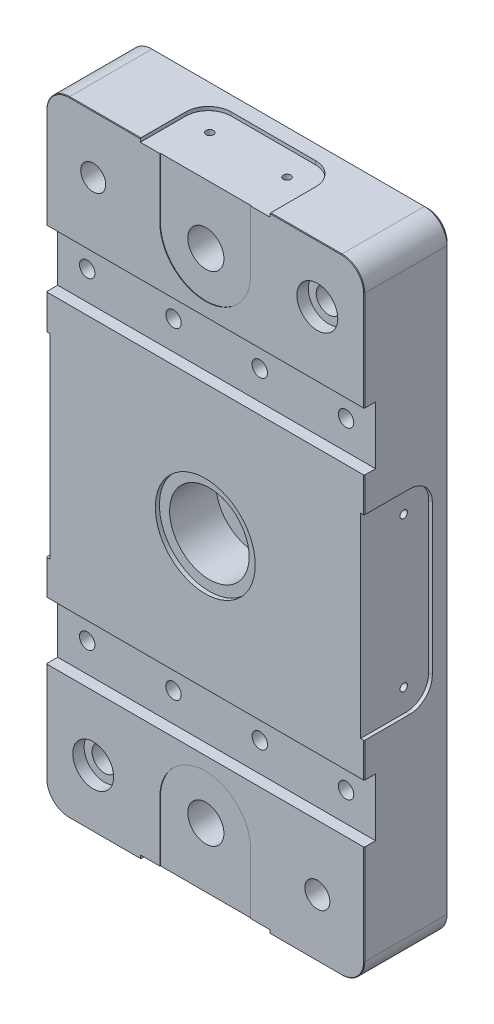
ISO-10303-21;
HEADER;
FILE_DESCRIPTION(('STEP AP214'),'2;1');
FILE_NAME('part.step','',(''),(''),'','','');
FILE_SCHEMA(('AUTOMOTIVE_DESIGN { 1 0 10303 214 1 1 1 1 }'));
ENDSEC;
DATA;
#1=APPLICATION_CONTEXT('core data for automotive mechanical design processes');
#2=APPLICATION_PROTOCOL_DEFINITION('international standard','automotive_design',2000,#1);
#3=PRODUCT_CONTEXT('',#1,'mechanical');
#4=PRODUCT('Part','Part','',(#3));
#5=PRODUCT_RELATED_PRODUCT_CATEGORY('part','',(#4));
#6=PRODUCT_DEFINITION_FORMATION('','',#4);
#7=PRODUCT_DEFINITION_CONTEXT('part definition',#1,'design');
#8=PRODUCT_DEFINITION('design','',#6,#7);
#9=PRODUCT_DEFINITION_SHAPE('','',#8);
#10=(LENGTH_UNIT() NAMED_UNIT(*) SI_UNIT(.MILLI.,.METRE.));
#11=(NAMED_UNIT(*) PLANE_ANGLE_UNIT() SI_UNIT($,.RADIAN.));
#12=(NAMED_UNIT(*) SI_UNIT($,.STERADIAN.) SOLID_ANGLE_UNIT());
#13=UNCERTAINTY_MEASURE_WITH_UNIT(LENGTH_MEASURE(1.E-05),#10,'distance_accuracy_value','');
#14=(GEOMETRIC_REPRESENTATION_CONTEXT(3) GLOBAL_UNCERTAINTY_ASSIGNED_CONTEXT((#13)) GLOBAL_UNIT_ASSIGNED_CONTEXT((#10,
#11,#12)) REPRESENTATION_CONTEXT('',''));
#15=CARTESIAN_POINT('',(0.,0.,0.));
#16=DIRECTION('',(0.,0.,1.));
#17=DIRECTION('',(1.,0.,0.));
#18=AXIS2_PLACEMENT_3D('',#15,#16,#17);
#19=CARTESIAN_POINT('',(-18.6,-135.9,18.));
#20=DIRECTION('',(0.,-1.,0.));
#21=DIRECTION('',(0.,0.,1.));
#22=AXIS2_PLACEMENT_3D('',#19,#20,#21);
#23=PLANE('',#22);
#24=CARTESIAN_POINT('',(17.,-135.9,19.));
#25=DIRECTION('',(0.,1.,0.));
#26=DIRECTION('',(-1.,0.,0.));
#27=AXIS2_PLACEMENT_3D('',#24,#25,#26);
#28=CIRCLE('',#27,1.65);
#29=CARTESIAN_POINT('',(15.35,-135.9,19.));
#30=VERTEX_POINT('',#29);
#31=EDGE_CURVE('E592',#30,#30,#28,.T.);
#32=ORIENTED_EDGE('',*,*,#31,.T.);
#33=EDGE_LOOP('',(#32));
#34=FACE_BOUND('',#33,.T.);
#35=CARTESIAN_POINT('',(-17.,-135.9,19.));
#36=DIRECTION('',(0.,1.,0.));
#37=DIRECTION('',(-1.,0.,0.));
#38=AXIS2_PLACEMENT_3D('',#35,#36,#37);
#39=CIRCLE('',#38,1.65);
#40=CARTESIAN_POINT('',(-18.65,-135.9,19.));
#41=VERTEX_POINT('',#40);
#42=EDGE_CURVE('E595',#41,#41,#39,.T.);
#43=ORIENTED_EDGE('',*,*,#42,.T.);
#44=EDGE_LOOP('',(#43));
#45=FACE_BOUND('',#44,.T.);
#46=DIRECTION('',(1.,0.,0.));
#47=VECTOR('',#46,1.);
#48=CARTESIAN_POINT('',(28.6,-135.9,38.));
#49=LINE('',#48,#47);
#50=CARTESIAN_POINT('',(20.,-135.9,38.));
#51=VERTEX_POINT('',#50);
#52=CARTESIAN_POINT('',(28.6,-135.9,38.));
#53=VERTEX_POINT('',#52);
#54=EDGE_CURVE('E711',#51,#53,#49,.T.);
#55=ORIENTED_EDGE('',*,*,#54,.F.);
#56=DIRECTION('',(0.,0.,1.));
#57=VECTOR('',#56,1.);
#58=CARTESIAN_POINT('',(20.,-135.9,37.75));
#59=LINE('',#58,#57);
#60=CARTESIAN_POINT('',(20.,-135.9,37.75));
#61=VERTEX_POINT('',#60);
#62=EDGE_CURVE('E529',#61,#51,#59,.T.);
#63=ORIENTED_EDGE('',*,*,#62,.F.);
#64=DIRECTION('',(-1.,0.,0.));
#65=VECTOR('',#64,1.);
#66=CARTESIAN_POINT('',(-20.,-135.9,37.75));
#67=LINE('',#66,#65);
#68=CARTESIAN_POINT('',(-20.,-135.9,37.75));
#69=VERTEX_POINT('',#68);
#70=EDGE_CURVE('E501',#61,#69,#67,.T.);
#71=ORIENTED_EDGE('',*,*,#70,.T.);
#72=DIRECTION('',(0.,0.,1.));
#73=VECTOR('',#72,1.);
#74=CARTESIAN_POINT('',(-20.,-135.9,37.75));
#75=LINE('',#74,#73);
#76=CARTESIAN_POINT('',(-20.,-135.9,38.));
#77=VERTEX_POINT('',#76);
#78=EDGE_CURVE('E496',#69,#77,#75,.T.);
#79=ORIENTED_EDGE('',*,*,#78,.T.);
#80=CARTESIAN_POINT('',(-28.6,-135.9,38.));
#81=VERTEX_POINT('',#80);
#82=EDGE_CURVE('E707',#81,#77,#49,.T.);
#83=ORIENTED_EDGE('',*,*,#82,.F.);
#84=DIRECTION('',(0.,0.,1.));
#85=VECTOR('',#84,1.);
#86=CARTESIAN_POINT('',(-28.6,-135.9,18.0000000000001));
#87=LINE('',#86,#85);
#88=CARTESIAN_POINT('',(-28.6,-135.9,18.0000000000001));
#89=VERTEX_POINT('',#88);
#90=EDGE_CURVE('E710',#89,#81,#87,.T.);
#91=ORIENTED_EDGE('',*,*,#90,.F.);
#92=CARTESIAN_POINT('',(-18.6,-135.9,18.));
#93=DIRECTION('',(0.,1.,0.));
#94=DIRECTION('',(0.,0.,1.));
#95=AXIS2_PLACEMENT_3D('',#92,#93,#94);
#96=CIRCLE('',#95,10.);
#97=CARTESIAN_POINT('',(-18.5999999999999,-135.9,8.));
#98=VERTEX_POINT('',#97);
#99=EDGE_CURVE('E713',#98,#89,#96,.T.);
#100=ORIENTED_EDGE('',*,*,#99,.F.);
#101=DIRECTION('',(-1.,0.,0.));
#102=VECTOR('',#101,1.);
#103=CARTESIAN_POINT('',(18.5999999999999,-135.9,8.));
#104=LINE('',#103,#102);
#105=CARTESIAN_POINT('',(18.5999999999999,-135.9,8.));
#106=VERTEX_POINT('',#105);
#107=EDGE_CURVE('E715',#106,#98,#104,.T.);
#108=ORIENTED_EDGE('',*,*,#107,.F.);
#109=CARTESIAN_POINT('',(18.6,-135.9,18.));
#110=DIRECTION('',(0.,1.,0.));
#111=DIRECTION('',(0.,0.,-1.));
#112=AXIS2_PLACEMENT_3D('',#109,#110,#111);
#113=CIRCLE('',#112,10.);
#114=CARTESIAN_POINT('',(28.6,-135.9,18.0000000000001));
#115=VERTEX_POINT('',#114);
#116=EDGE_CURVE('E717',#115,#106,#113,.T.);
#117=ORIENTED_EDGE('',*,*,#116,.F.);
#118=DIRECTION('',(0.,0.,-1.));
#119=VECTOR('',#118,1.);
#120=CARTESIAN_POINT('',(28.6,-135.9,18.0000000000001));
#121=LINE('',#120,#119);
#122=EDGE_CURVE('E719',#53,#115,#121,.T.);
#123=ORIENTED_EDGE('',*,*,#122,.F.);
#124=EDGE_LOOP('',(#55,#63,#71,#79,#83,#91,#100,#108,#117,#123));
#125=FACE_BOUND('',#124,.T.);
#126=ADVANCED_FACE('F32',(#34,#45,#125),#23,.T.);
#127=CARTESIAN_POINT('',(-60.,127.5,38.));
#128=DIRECTION('',(0.,0.,1.));
#129=DIRECTION('',(1.,0.,0.));
#130=AXIS2_PLACEMENT_3D('',#127,#128,#129);
#131=PLANE('',#130);
#132=CARTESIAN_POINT('',(49.36,-112.1,38.));
#133=DIRECTION('',(0.,0.,-1.));
#134=DIRECTION('',(-1.,0.,0.));
#135=AXIS2_PLACEMENT_3D('',#132,#133,#134);
#136=CIRCLE('',#135,5.5);
#137=CARTESIAN_POINT('',(43.86,-112.1,38.));
#138=VERTEX_POINT('',#137);
#139=EDGE_CURVE('E700',#138,#138,#136,.T.);
#140=ORIENTED_EDGE('',*,*,#139,.T.);
#141=EDGE_LOOP('',(#140));
#142=FACE_BOUND('',#141,.T.);
#143=CARTESIAN_POINT('',(-49.36,-112.1,38.));
#144=DIRECTION('',(0.,0.,1.));
#145=DIRECTION('',(1.,0.,0.));
#146=AXIS2_PLACEMENT_3D('',#143,#144,#145);
#147=CIRCLE('',#146,9.00000000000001);
#148=CARTESIAN_POINT('',(-40.36,-112.1,38.));
#149=VERTEX_POINT('',#148);
#150=EDGE_CURVE('E658',#149,#149,#147,.T.);
#151=ORIENTED_EDGE('',*,*,#150,.F.);
#152=EDGE_LOOP('',(#151));
#153=FACE_BOUND('',#152,.T.);
#154=DIRECTION('',(0.,-1.,0.));
#155=VECTOR('',#154,1.);
#156=CARTESIAN_POINT('',(28.6,-135.9,38.));
#157=LINE('',#156,#155);
#158=CARTESIAN_POINT('',(28.6,-137.25,38.));
#159=VERTEX_POINT('',#158);
#160=EDGE_CURVE('E735',#53,#159,#157,.T.);
#161=ORIENTED_EDGE('',*,*,#160,.T.);
#162=DIRECTION('',(1.,0.,0.));
#163=VECTOR('',#162,1.);
#164=CARTESIAN_POINT('',(59.9999999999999,-137.25,38.));
#165=LINE('',#164,#163);
#166=CARTESIAN_POINT('',(59.9999999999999,-137.25,38.));
#167=VERTEX_POINT('',#166);
#168=EDGE_CURVE('E1066',#159,#167,#165,.T.);
#169=ORIENTED_EDGE('',*,*,#168,.T.);
#170=CARTESIAN_POINT('',(60.,-127.5,38.));
#171=DIRECTION('',(0.,0.,1.));
#172=DIRECTION('',(1.,0.,0.));
#173=AXIS2_PLACEMENT_3D('',#170,#171,#172);
#174=CIRCLE('',#173,9.74999999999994);
#175=CARTESIAN_POINT('',(69.75,-127.5,38.));
#176=VERTEX_POINT('',#175);
#177=EDGE_CURVE('E1064',#167,#176,#174,.T.);
#178=ORIENTED_EDGE('',*,*,#177,.T.);
#179=DIRECTION('',(0.,1.,0.));
#180=VECTOR('',#179,1.);
#181=CARTESIAN_POINT('',(69.75,-83.7,38.));
#182=LINE('',#181,#180);
#183=CARTESIAN_POINT('',(69.7499999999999,-83.7,38.));
#184=VERTEX_POINT('',#183);
#185=EDGE_CURVE('E1062',#176,#184,#182,.T.);
#186=ORIENTED_EDGE('',*,*,#185,.T.);
#187=DIRECTION('',(1.,0.,0.));
#188=VECTOR('',#187,1.);
#189=CARTESIAN_POINT('',(-70.,-83.7,38.));
#190=LINE('',#189,#188);
#191=CARTESIAN_POINT('',(-69.7499999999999,-83.7,38.));
#192=VERTEX_POINT('',#191);
#193=EDGE_CURVE('E909',#192,#184,#190,.T.);
#194=ORIENTED_EDGE('',*,*,#193,.F.);
#195=DIRECTION('',(0.,-1.,0.));
#196=VECTOR('',#195,1.);
#197=CARTESIAN_POINT('',(-69.7499999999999,-127.5,38.));
#198=LINE('',#197,#196);
#199=CARTESIAN_POINT('',(-69.7499999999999,-127.5,38.));
#200=VERTEX_POINT('',#199);
#201=EDGE_CURVE('E1017',#192,#200,#198,.T.);
#202=ORIENTED_EDGE('',*,*,#201,.T.);
#203=CARTESIAN_POINT('',(-60.,-127.5,38.));
#204=DIRECTION('',(0.,0.,1.));
#205=DIRECTION('',(1.,0.,0.));
#206=AXIS2_PLACEMENT_3D('',#203,#204,#205);
#207=CIRCLE('',#206,9.74999999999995);
#208=CARTESIAN_POINT('',(-59.9999999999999,-137.25,38.));
#209=VERTEX_POINT('',#208);
#210=EDGE_CURVE('E1057',#200,#209,#207,.T.);
#211=ORIENTED_EDGE('',*,*,#210,.T.);
#212=DIRECTION('',(1.,0.,0.));
#213=VECTOR('',#212,1.);
#214=CARTESIAN_POINT('',(-28.6,-137.25,38.));
#215=LINE('',#214,#213);
#216=CARTESIAN_POINT('',(-28.6,-137.25,38.));
#217=VERTEX_POINT('',#216);
#218=EDGE_CURVE('E1059',#209,#217,#215,.T.);
#219=ORIENTED_EDGE('',*,*,#218,.T.);
#220=DIRECTION('',(0.,-1.,0.));
#221=VECTOR('',#220,1.);
#222=CARTESIAN_POINT('',(-28.6,-135.9,38.));
#223=LINE('',#222,#221);
#224=EDGE_CURVE('E721',#81,#217,#223,.T.);
#225=ORIENTED_EDGE('',*,*,#224,.F.);
#226=ORIENTED_EDGE('',*,*,#82,.T.);
#227=DIRECTION('',(0.,1.,0.));
#228=VECTOR('',#227,1.);
#229=CARTESIAN_POINT('',(-20.,-109.6,38.));
#230=LINE('',#229,#228);
#231=CARTESIAN_POINT('',(-20.,-109.6,38.));
#232=VERTEX_POINT('',#231);
#233=EDGE_CURVE('E518',#77,#232,#230,.T.);
#234=ORIENTED_EDGE('',*,*,#233,.T.);
#235=CARTESIAN_POINT('',(0.,-109.6,38.));
#236=DIRECTION('',(0.,0.,-1.));
#237=DIRECTION('',(1.,0.,0.));
#238=AXIS2_PLACEMENT_3D('',#235,#236,#237);
#239=CIRCLE('',#238,20.);
#240=CARTESIAN_POINT('',(20.,-109.6,38.));
#241=VERTEX_POINT('',#240);
#242=EDGE_CURVE('E510',#232,#241,#239,.T.);
#243=ORIENTED_EDGE('',*,*,#242,.T.);
#244=DIRECTION('',(0.,-1.,0.));
#245=VECTOR('',#244,1.);
#246=CARTESIAN_POINT('',(20.,-109.6,38.));
#247=LINE('',#246,#245);
#248=EDGE_CURVE('E515',#241,#51,#247,.T.);
#249=ORIENTED_EDGE('',*,*,#248,.T.);
#250=ORIENTED_EDGE('',*,*,#54,.T.);
#251=EDGE_LOOP('',(#161,#169,#178,#186,#194,#202,#211,#219,#225,#226,#234,#243,#249,#250));
#252=FACE_BOUND('',#251,.T.);
#253=ADVANCED_FACE('F1277',(#142,#153,#252),#131,.T.);
#254=CARTESIAN_POINT('',(-68.4,33.,18.));
#255=DIRECTION('',(-1.,0.,0.));
#256=DIRECTION('',(0.,-1.,0.));
#257=AXIS2_PLACEMENT_3D('',#254,#255,#256);
#258=PLANE('',#257);
#259=CARTESIAN_POINT('',(-68.4,33.,19.));
#260=DIRECTION('',(1.,0.,0.));
#261=DIRECTION('',(0.,1.,0.));
#262=AXIS2_PLACEMENT_3D('',#259,#260,#261);
#263=CIRCLE('',#262,1.65);
#264=CARTESIAN_POINT('',(-68.4,34.65,19.));
#265=VERTEX_POINT('',#264);
#266=EDGE_CURVE('E571',#265,#265,#263,.T.);
#267=ORIENTED_EDGE('',*,*,#266,.T.);
#268=EDGE_LOOP('',(#267));
#269=FACE_BOUND('',#268,.T.);
#270=CARTESIAN_POINT('',(-68.4,33.,18.));
#271=DIRECTION('',(-1.,0.,0.));
#272=DIRECTION('',(0.,-1.,0.));
#273=AXIS2_PLACEMENT_3D('',#270,#271,#272);
#274=CIRCLE('',#273,10.);
#275=CARTESIAN_POINT('',(-68.4,43.,18.0000000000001));
#276=VERTEX_POINT('',#275);
#277=CARTESIAN_POINT('',(-68.4,32.9999999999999,8.00000000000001));
#278=VERTEX_POINT('',#277);
#279=EDGE_CURVE('E842',#276,#278,#274,.T.);
#280=ORIENTED_EDGE('',*,*,#279,.T.);
#281=DIRECTION('',(0.,-1.,0.));
#282=VECTOR('',#281,1.);
#283=CARTESIAN_POINT('',(-68.4,32.9999999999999,8.00000000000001));
#284=LINE('',#283,#282);
#285=CARTESIAN_POINT('',(-68.4,-32.9999999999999,8.00000000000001));
#286=VERTEX_POINT('',#285);
#287=EDGE_CURVE('E845',#278,#286,#284,.T.);
#288=ORIENTED_EDGE('',*,*,#287,.T.);
#289=CARTESIAN_POINT('',(-68.4,-33.,18.));
#290=DIRECTION('',(-1.,0.,0.));
#291=DIRECTION('',(0.,-1.,0.));
#292=AXIS2_PLACEMENT_3D('',#289,#290,#291);
#293=CIRCLE('',#292,10.);
#294=CARTESIAN_POINT('',(-68.4,-43.,18.0000000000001));
#295=VERTEX_POINT('',#294);
#296=EDGE_CURVE('E849',#286,#295,#293,.T.);
#297=ORIENTED_EDGE('',*,*,#296,.T.);
#298=DIRECTION('',(0.,0.,1.));
#299=VECTOR('',#298,1.);
#300=CARTESIAN_POINT('',(-68.4,-43.,18.0000000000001));
#301=LINE('',#300,#299);
#302=CARTESIAN_POINT('',(-68.4,-43.,38.));
#303=VERTEX_POINT('',#302);
#304=EDGE_CURVE('E852',#295,#303,#301,.T.);
#305=ORIENTED_EDGE('',*,*,#304,.T.);
#306=DIRECTION('',(0.,1.,0.));
#307=VECTOR('',#306,1.);
#308=CARTESIAN_POINT('',(-68.4,43.,38.));
#309=LINE('',#308,#307);
#310=CARTESIAN_POINT('',(-68.4,43.,38.));
#311=VERTEX_POINT('',#310);
#312=EDGE_CURVE('E854',#303,#311,#309,.T.);
#313=ORIENTED_EDGE('',*,*,#312,.T.);
#314=DIRECTION('',(0.,0.,-1.));
#315=VECTOR('',#314,1.);
#316=CARTESIAN_POINT('',(-68.4,43.,18.0000000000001));
#317=LINE('',#316,#315);
#318=EDGE_CURVE('E856',#311,#276,#317,.T.);
#319=ORIENTED_EDGE('',*,*,#318,.T.);
#320=EDGE_LOOP('',(#280,#288,#297,#305,#313,#319));
#321=FACE_BOUND('',#320,.T.);
#322=CARTESIAN_POINT('',(-68.4,-33.,19.));
#323=DIRECTION('',(1.,0.,0.));
#324=DIRECTION('',(0.,1.,0.));
#325=AXIS2_PLACEMENT_3D('',#322,#323,#324);
#326=CIRCLE('',#325,1.65);
#327=CARTESIAN_POINT('',(-68.4,-31.35,19.));
#328=VERTEX_POINT('',#327);
#329=EDGE_CURVE('E568',#328,#328,#326,.T.);
#330=ORIENTED_EDGE('',*,*,#329,.T.);
#331=EDGE_LOOP('',(#330));
#332=FACE_BOUND('',#331,.T.);
#333=ADVANCED_FACE('F1283',(#269,#321,#332),#258,.T.);
#334=CARTESIAN_POINT('',(-49.36,-112.1,38.));
#335=DIRECTION('',(0.,0.,-1.));
#336=DIRECTION('',(-1.,0.,0.));
#337=AXIS2_PLACEMENT_3D('',#334,#335,#336);
#338=CYLINDRICAL_SURFACE('',#337,5.5);
#339=CARTESIAN_POINT('',(-49.36,-112.1,10.8));
#340=DIRECTION('',(0.,0.,-1.));
#341=DIRECTION('',(-1.,0.,0.));
#342=AXIS2_PLACEMENT_3D('',#339,#340,#341);
#343=CIRCLE('',#342,5.5);
#344=CARTESIAN_POINT('',(-54.86,-112.1,10.8));
#345=VERTEX_POINT('',#344);
#346=EDGE_CURVE('E682',#345,#345,#343,.F.);
#347=ORIENTED_EDGE('',*,*,#346,.F.);
#348=EDGE_LOOP('',(#347));
#349=FACE_BOUND('',#348,.T.);
#350=CARTESIAN_POINT('',(-49.36,-112.1,33.));
#351=DIRECTION('',(0.,0.,1.));
#352=DIRECTION('',(1.,0.,0.));
#353=AXIS2_PLACEMENT_3D('',#350,#351,#352);
#354=CIRCLE('',#353,5.5);
#355=CARTESIAN_POINT('',(-43.86,-112.1,33.));
#356=VERTEX_POINT('',#355);
#357=EDGE_CURVE('E662',#356,#356,#354,.F.);
#358=ORIENTED_EDGE('',*,*,#357,.F.);
#359=EDGE_LOOP('',(#358));
#360=FACE_BOUND('',#359,.T.);
#361=ADVANCED_FACE('F1358',(#349,#360),#338,.F.);
#362=CARTESIAN_POINT('',(49.36,112.1,38.));
#363=DIRECTION('',(0.,0.,-1.));
#364=DIRECTION('',(-1.,0.,0.));
#365=AXIS2_PLACEMENT_3D('',#362,#363,#364);
#366=CYLINDRICAL_SURFACE('',#365,5.5);
#367=CARTESIAN_POINT('',(49.36,112.1,10.8));
#368=DIRECTION('',(0.,0.,-1.));
#369=DIRECTION('',(-1.,0.,0.));
#370=AXIS2_PLACEMENT_3D('',#367,#368,#369);
#371=CIRCLE('',#370,5.5);
#372=CARTESIAN_POINT('',(43.86,112.1,10.8));
#373=VERTEX_POINT('',#372);
#374=EDGE_CURVE('E696',#373,#373,#371,.F.);
#375=ORIENTED_EDGE('',*,*,#374,.F.);
#376=EDGE_LOOP('',(#375));
#377=FACE_BOUND('',#376,.T.);
#378=CARTESIAN_POINT('',(49.36,112.1,33.));
#379=DIRECTION('',(0.,0.,1.));
#380=DIRECTION('',(1.,0.,0.));
#381=AXIS2_PLACEMENT_3D('',#378,#379,#380);
#382=CIRCLE('',#381,5.5);
#383=CARTESIAN_POINT('',(54.86,112.1,33.));
#384=VERTEX_POINT('',#383);
#385=EDGE_CURVE('E668',#384,#384,#382,.F.);
#386=ORIENTED_EDGE('',*,*,#385,.F.);
#387=EDGE_LOOP('',(#386));
#388=FACE_BOUND('',#387,.T.);
#389=ADVANCED_FACE('F1290',(#377,#388),#366,.F.);
#390=CARTESIAN_POINT('',(49.36,-112.1,38.));
#391=DIRECTION('',(0.,0.,-1.));
#392=DIRECTION('',(-1.,0.,0.));
#393=AXIS2_PLACEMENT_3D('',#390,#391,#392);
#394=CYLINDRICAL_SURFACE('',#393,5.5);
#395=ORIENTED_EDGE('',*,*,#139,.F.);
#396=EDGE_LOOP('',(#395));
#397=FACE_BOUND('',#396,.T.);
#398=CARTESIAN_POINT('',(49.36,-112.1,10.8));
#399=DIRECTION('',(0.,0.,-1.));
#400=DIRECTION('',(-1.,0.,0.));
#401=AXIS2_PLACEMENT_3D('',#398,#399,#400);
#402=CIRCLE('',#401,5.5);
#403=CARTESIAN_POINT('',(43.86,-112.1,10.8));
#404=VERTEX_POINT('',#403);
#405=EDGE_CURVE('E675',#404,#404,#402,.F.);
#406=ORIENTED_EDGE('',*,*,#405,.F.);
#407=EDGE_LOOP('',(#406));
#408=FACE_BOUND('',#407,.T.);
#409=ADVANCED_FACE('F2071',(#397,#408),#394,.F.);
#410=CARTESIAN_POINT('',(-49.36,112.1,38.));
#411=DIRECTION('',(0.,0.,-1.));
#412=DIRECTION('',(-1.,0.,0.));
#413=AXIS2_PLACEMENT_3D('',#410,#411,#412);
#414=CYLINDRICAL_SURFACE('',#413,5.5);
#415=CARTESIAN_POINT('',(-49.36,112.1,38.));
#416=DIRECTION('',(0.,0.,-1.));
#417=DIRECTION('',(-1.,0.,0.));
#418=AXIS2_PLACEMENT_3D('',#415,#416,#417);
#419=CIRCLE('',#418,5.5);
#420=CARTESIAN_POINT('',(-54.86,112.1,38.));
#421=VERTEX_POINT('',#420);
#422=EDGE_CURVE('E703',#421,#421,#419,.T.);
#423=ORIENTED_EDGE('',*,*,#422,.F.);
#424=EDGE_LOOP('',(#423));
#425=FACE_BOUND('',#424,.T.);
#426=CARTESIAN_POINT('',(-49.36,112.1,10.8));
#427=DIRECTION('',(0.,0.,-1.));
#428=DIRECTION('',(-1.,0.,0.));
#429=AXIS2_PLACEMENT_3D('',#426,#427,#428);
#430=CIRCLE('',#429,5.5);
#431=CARTESIAN_POINT('',(-54.86,112.1,10.8));
#432=VERTEX_POINT('',#431);
#433=EDGE_CURVE('E689',#432,#432,#430,.F.);
#434=ORIENTED_EDGE('',*,*,#433,.F.);
#435=EDGE_LOOP('',(#434));
#436=FACE_BOUND('',#435,.T.);
#437=ADVANCED_FACE('F1455',(#425,#436),#414,.F.);
#438=CARTESIAN_POINT('',(-59.9999999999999,-137.5,38.));
#439=DIRECTION('',(0.,1.,0.));
#440=DIRECTION('',(0.,0.,1.));
#441=AXIS2_PLACEMENT_3D('',#438,#439,#440);
#442=PLANE('',#441);
#443=DIRECTION('',(0.,0.,-1.));
#444=VECTOR('',#443,1.);
#445=CARTESIAN_POINT('',(59.9999999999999,-137.5,38.));
#446=LINE('',#445,#444);
#447=CARTESIAN_POINT('',(59.9999999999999,-137.5,37.7499999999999));
#448=VERTEX_POINT('',#447);
#449=CARTESIAN_POINT('',(59.9999999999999,-137.5,1.5));
#450=VERTEX_POINT('',#449);
#451=EDGE_CURVE('E968',#448,#450,#446,.T.);
#452=ORIENTED_EDGE('',*,*,#451,.F.);
#453=DIRECTION('',(-1.,0.,0.));
#454=VECTOR('',#453,1.);
#455=CARTESIAN_POINT('',(28.6,-137.5,37.7499999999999));
#456=LINE('',#455,#454);
#457=CARTESIAN_POINT('',(28.6,-137.5,37.75));
#458=VERTEX_POINT('',#457);
#459=EDGE_CURVE('E1071',#448,#458,#456,.T.);
#460=ORIENTED_EDGE('',*,*,#459,.T.);
#461=DIRECTION('',(0.,0.,-1.));
#462=VECTOR('',#461,1.);
#463=CARTESIAN_POINT('',(28.6,-137.5,18.0000000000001));
#464=LINE('',#463,#462);
#465=CARTESIAN_POINT('',(28.6,-137.5,18.0000000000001));
#466=VERTEX_POINT('',#465);
#467=EDGE_CURVE('E733',#458,#466,#464,.T.);
#468=ORIENTED_EDGE('',*,*,#467,.T.);
#469=CARTESIAN_POINT('',(18.6,-137.5,18.));
#470=DIRECTION('',(0.,1.,0.));
#471=DIRECTION('',(0.,0.,-1.));
#472=AXIS2_PLACEMENT_3D('',#469,#470,#471);
#473=CIRCLE('',#472,10.);
#474=CARTESIAN_POINT('',(18.5999999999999,-137.5,8.));
#475=VERTEX_POINT('',#474);
#476=EDGE_CURVE('E730',#466,#475,#473,.T.);
#477=ORIENTED_EDGE('',*,*,#476,.T.);
#478=DIRECTION('',(-1.,0.,0.));
#479=VECTOR('',#478,1.);
#480=CARTESIAN_POINT('',(18.5999999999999,-137.5,8.));
#481=LINE('',#480,#479);
#482=CARTESIAN_POINT('',(-18.5999999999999,-137.5,8.));
#483=VERTEX_POINT('',#482);
#484=EDGE_CURVE('E727',#475,#483,#481,.T.);
#485=ORIENTED_EDGE('',*,*,#484,.T.);
#486=CARTESIAN_POINT('',(-18.6,-137.5,18.));
#487=DIRECTION('',(0.,1.,0.));
#488=DIRECTION('',(0.,0.,1.));
#489=AXIS2_PLACEMENT_3D('',#486,#487,#488);
#490=CIRCLE('',#489,10.);
#491=CARTESIAN_POINT('',(-28.6,-137.5,18.0000000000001));
#492=VERTEX_POINT('',#491);
#493=EDGE_CURVE('E724',#483,#492,#490,.T.);
#494=ORIENTED_EDGE('',*,*,#493,.T.);
#495=DIRECTION('',(0.,0.,1.));
#496=VECTOR('',#495,1.);
#497=CARTESIAN_POINT('',(-28.6,-137.5,18.0000000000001));
#498=LINE('',#497,#496);
#499=CARTESIAN_POINT('',(-28.6,-137.5,37.7499999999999));
#500=VERTEX_POINT('',#499);
#501=EDGE_CURVE('E706',#492,#500,#498,.T.);
#502=ORIENTED_EDGE('',*,*,#501,.T.);
#503=DIRECTION('',(-1.,0.,0.));
#504=VECTOR('',#503,1.);
#505=CARTESIAN_POINT('',(-59.9999999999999,-137.5,37.7499999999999));
#506=LINE('',#505,#504);
#507=CARTESIAN_POINT('',(-59.9999999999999,-137.5,37.7499999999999));
#508=VERTEX_POINT('',#507);
#509=EDGE_CURVE('E1069',#500,#508,#506,.T.);
#510=ORIENTED_EDGE('',*,*,#509,.T.);
#511=DIRECTION('',(0.,0.,-1.));
#512=VECTOR('',#511,1.);
#513=CARTESIAN_POINT('',(-59.9999999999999,-137.5,38.));
#514=LINE('',#513,#512);
#515=CARTESIAN_POINT('',(-59.9999999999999,-137.5,1.5));
#516=VERTEX_POINT('',#515);
#517=EDGE_CURVE('E970',#508,#516,#514,.T.);
#518=ORIENTED_EDGE('',*,*,#517,.T.);
#519=DIRECTION('',(1.,0.,0.));
#520=VECTOR('',#519,1.);
#521=CARTESIAN_POINT('',(-59.9999999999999,-137.5,1.5));
#522=LINE('',#521,#520);
#523=EDGE_CURVE('E1002',#516,#450,#522,.T.);
#524=ORIENTED_EDGE('',*,*,#523,.T.);
#525=EDGE_LOOP('',(#452,#460,#468,#477,#485,#494,#502,#510,#518,#524));
#526=FACE_BOUND('',#525,.T.);
#527=ADVANCED_FACE('F1448',(#526),#442,.F.);
#528=CARTESIAN_POINT('',(70.,127.5,38.));
#529=DIRECTION('',(-1.,0.,0.));
#530=DIRECTION('',(0.,-1.,0.));
#531=AXIS2_PLACEMENT_3D('',#528,#529,#530);
#532=PLANE('',#531);
#533=DIRECTION('',(0.,0.,1.));
#534=VECTOR('',#533,1.);
#535=CARTESIAN_POINT('',(70.,-83.7,33.));
#536=LINE('',#535,#534);
#537=CARTESIAN_POINT('',(70.,-83.7,33.));
#538=VERTEX_POINT('',#537);
#539=CARTESIAN_POINT('',(70.,-83.7,37.7499999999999));
#540=VERTEX_POINT('',#539);
#541=EDGE_CURVE('E908',#538,#540,#536,.T.);
#542=ORIENTED_EDGE('',*,*,#541,.T.);
#543=DIRECTION('',(0.,-1.,0.));
#544=VECTOR('',#543,1.);
#545=CARTESIAN_POINT('',(70.,-127.5,37.7499999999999));
#546=LINE('',#545,#544);
#547=CARTESIAN_POINT('',(70.,-127.5,37.7499999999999));
#548=VERTEX_POINT('',#547);
#549=EDGE_CURVE('E1087',#540,#548,#546,.T.);
#550=ORIENTED_EDGE('',*,*,#549,.T.);
#551=DIRECTION('',(0.,0.,-1.));
#552=VECTOR('',#551,1.);
#553=CARTESIAN_POINT('',(70.,-127.5,38.));
#554=LINE('',#553,#552);
#555=CARTESIAN_POINT('',(70.,-127.5,1.5));
#556=VERTEX_POINT('',#555);
#557=EDGE_CURVE('E966',#548,#556,#554,.T.);
#558=ORIENTED_EDGE('',*,*,#557,.T.);
#559=DIRECTION('',(0.,1.,0.));
#560=VECTOR('',#559,1.);
#561=CARTESIAN_POINT('',(70.,127.5,1.5));
#562=LINE('',#561,#560);
#563=CARTESIAN_POINT('',(70.,127.5,1.5));
#564=VERTEX_POINT('',#563);
#565=EDGE_CURVE('E1014',#556,#564,#562,.T.);
#566=ORIENTED_EDGE('',*,*,#565,.T.);
#567=DIRECTION('',(0.,0.,-1.));
#568=VECTOR('',#567,1.);
#569=CARTESIAN_POINT('',(70.,127.5,38.));
#570=LINE('',#569,#568);
#571=CARTESIAN_POINT('',(70.,127.5,37.75));
#572=VERTEX_POINT('',#571);
#573=EDGE_CURVE('E964',#572,#564,#570,.T.);
#574=ORIENTED_EDGE('',*,*,#573,.F.);
#575=DIRECTION('',(0.,-1.,0.));
#576=VECTOR('',#575,1.);
#577=CARTESIAN_POINT('',(70.,83.7,37.75));
#578=LINE('',#577,#576);
#579=CARTESIAN_POINT('',(70.,83.7,37.75));
#580=VERTEX_POINT('',#579);
#581=EDGE_CURVE('E1081',#572,#580,#578,.T.);
#582=ORIENTED_EDGE('',*,*,#581,.T.);
#583=DIRECTION('',(0.,0.,1.));
#584=VECTOR('',#583,1.);
#585=CARTESIAN_POINT('',(70.,83.7,33.));
#586=LINE('',#585,#584);
#587=CARTESIAN_POINT('',(70.,83.7,33.));
#588=VERTEX_POINT('',#587);
#589=EDGE_CURVE('E944',#588,#580,#586,.T.);
#590=ORIENTED_EDGE('',*,*,#589,.F.);
#591=DIRECTION('',(0.,1.,0.));
#592=VECTOR('',#591,1.);
#593=CARTESIAN_POINT('',(70.,58.2,33.));
#594=LINE('',#593,#592);
#595=CARTESIAN_POINT('',(70.,58.2,33.));
#596=VERTEX_POINT('',#595);
#597=EDGE_CURVE('E936',#596,#588,#594,.T.);
#598=ORIENTED_EDGE('',*,*,#597,.F.);
#599=DIRECTION('',(0.,0.,1.));
#600=VECTOR('',#599,1.);
#601=CARTESIAN_POINT('',(70.,58.2,33.));
#602=LINE('',#601,#600);
#603=CARTESIAN_POINT('',(70.,58.2,37.75));
#604=VERTEX_POINT('',#603);
#605=EDGE_CURVE('E948',#596,#604,#602,.T.);
#606=ORIENTED_EDGE('',*,*,#605,.T.);
#607=DIRECTION('',(0.,-1.,0.));
#608=VECTOR('',#607,1.);
#609=CARTESIAN_POINT('',(70.,43.,37.75));
#610=LINE('',#609,#608);
#611=CARTESIAN_POINT('',(70.,43.,37.75));
#612=VERTEX_POINT('',#611);
#613=EDGE_CURVE('E1083',#604,#612,#610,.T.);
#614=ORIENTED_EDGE('',*,*,#613,.T.);
#615=DIRECTION('',(0.,0.,-1.));
#616=VECTOR('',#615,1.);
#617=CARTESIAN_POINT('',(70.,43.,18.0000000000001));
#618=LINE('',#617,#616);
#619=CARTESIAN_POINT('',(70.,43.,18.0000000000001));
#620=VERTEX_POINT('',#619);
#621=EDGE_CURVE('E816',#612,#620,#618,.T.);
#622=ORIENTED_EDGE('',*,*,#621,.T.);
#623=CARTESIAN_POINT('',(70.,33.,18.));
#624=DIRECTION('',(-1.,0.,0.));
#625=DIRECTION('',(0.,-1.,0.));
#626=AXIS2_PLACEMENT_3D('',#623,#624,#625);
#627=CIRCLE('',#626,10.);
#628=CARTESIAN_POINT('',(70.,32.9999999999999,8.00000000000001));
#629=VERTEX_POINT('',#628);
#630=EDGE_CURVE('E786',#620,#629,#627,.T.);
#631=ORIENTED_EDGE('',*,*,#630,.T.);
#632=DIRECTION('',(0.,-1.,0.));
#633=VECTOR('',#632,1.);
#634=CARTESIAN_POINT('',(70.,32.9999999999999,8.00000000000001));
#635=LINE('',#634,#633);
#636=CARTESIAN_POINT('',(70.,-32.9999999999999,8.00000000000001));
#637=VERTEX_POINT('',#636);
#638=EDGE_CURVE('E802',#629,#637,#635,.T.);
#639=ORIENTED_EDGE('',*,*,#638,.T.);
#640=CARTESIAN_POINT('',(70.,-33.,18.));
#641=DIRECTION('',(-1.,0.,0.));
#642=DIRECTION('',(0.,-1.,0.));
#643=AXIS2_PLACEMENT_3D('',#640,#641,#642);
#644=CIRCLE('',#643,10.);
#645=CARTESIAN_POINT('',(70.,-43.,18.0000000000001));
#646=VERTEX_POINT('',#645);
#647=EDGE_CURVE('E821',#637,#646,#644,.T.);
#648=ORIENTED_EDGE('',*,*,#647,.T.);
#649=DIRECTION('',(0.,0.,1.));
#650=VECTOR('',#649,1.);
#651=CARTESIAN_POINT('',(70.,-43.,18.0000000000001));
#652=LINE('',#651,#650);
#653=CARTESIAN_POINT('',(70.,-43.,37.7499999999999));
#654=VERTEX_POINT('',#653);
#655=EDGE_CURVE('E818',#646,#654,#652,.T.);
#656=ORIENTED_EDGE('',*,*,#655,.T.);
#657=DIRECTION('',(0.,-1.,0.));
#658=VECTOR('',#657,1.);
#659=CARTESIAN_POINT('',(70.,-58.2,37.7499999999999));
#660=LINE('',#659,#658);
#661=CARTESIAN_POINT('',(70.,-58.2,37.7499999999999));
#662=VERTEX_POINT('',#661);
#663=EDGE_CURVE('E1085',#654,#662,#660,.T.);
#664=ORIENTED_EDGE('',*,*,#663,.T.);
#665=DIRECTION('',(0.,0.,1.));
#666=VECTOR('',#665,1.);
#667=CARTESIAN_POINT('',(70.,-58.2,33.));
#668=LINE('',#667,#666);
#669=CARTESIAN_POINT('',(70.,-58.2,33.));
#670=VERTEX_POINT('',#669);
#671=EDGE_CURVE('E921',#670,#662,#668,.T.);
#672=ORIENTED_EDGE('',*,*,#671,.F.);
#673=DIRECTION('',(0.,1.,0.));
#674=VECTOR('',#673,1.);
#675=CARTESIAN_POINT('',(70.,-83.7,33.));
#676=LINE('',#675,#674);
#677=EDGE_CURVE('E898',#538,#670,#676,.T.);
#678=ORIENTED_EDGE('',*,*,#677,.F.);
#679=EDGE_LOOP('',(#542,#550,#558,#566,#574,#582,#590,#598,#606,#614,#622,#631,#639,#648,#656,
#664,#672,#678));
#680=FACE_BOUND('',#679,.T.);
#681=ADVANCED_FACE('F1211',(#680),#532,.F.);
#682=CARTESIAN_POINT('',(0.,0.,38.));
#683=DIRECTION('',(0.,0.,1.));
#684=DIRECTION('',(1.,0.,0.));
#685=AXIS2_PLACEMENT_3D('',#682,#683,#684);
#686=CIRCLE('',#685,22.);
#687=CARTESIAN_POINT('',(22.,0.,38.));
#688=VERTEX_POINT('',#687);
#689=EDGE_CURVE('E947',#688,#688,#686,.T.);
#690=ORIENTED_EDGE('',*,*,#689,.F.);
#691=EDGE_LOOP('',(#690));
#692=FACE_BOUND('',#691,.T.);
#693=DIRECTION('',(-1.,0.,0.));
#694=VECTOR('',#693,1.);
#695=CARTESIAN_POINT('',(-70.,-58.2,38.));
#696=LINE('',#695,#694);
#697=CARTESIAN_POINT('',(69.7499999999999,-58.2,38.));
#698=VERTEX_POINT('',#697);
#699=CARTESIAN_POINT('',(-69.75,-58.2,38.));
#700=VERTEX_POINT('',#699);
#701=EDGE_CURVE('E899',#698,#700,#696,.T.);
#702=ORIENTED_EDGE('',*,*,#701,.F.);
#703=DIRECTION('',(0.,1.,0.));
#704=VECTOR('',#703,1.);
#705=CARTESIAN_POINT('',(69.7499999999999,-43.,38.));
#706=LINE('',#705,#704);
#707=CARTESIAN_POINT('',(69.7499999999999,-43.,38.));
#708=VERTEX_POINT('',#707);
#709=EDGE_CURVE('E1098',#698,#708,#706,.T.);
#710=ORIENTED_EDGE('',*,*,#709,.T.);
#711=DIRECTION('',(1.,0.,0.));
#712=VECTOR('',#711,1.);
#713=CARTESIAN_POINT('',(68.4,-43.,38.));
#714=LINE('',#713,#712);
#715=CARTESIAN_POINT('',(68.4,-43.,38.));
#716=VERTEX_POINT('',#715);
#717=EDGE_CURVE('E834',#716,#708,#714,.T.);
#718=ORIENTED_EDGE('',*,*,#717,.F.);
#719=DIRECTION('',(0.,1.,0.));
#720=VECTOR('',#719,1.);
#721=CARTESIAN_POINT('',(68.4,43.,38.));
#722=LINE('',#721,#720);
#723=CARTESIAN_POINT('',(68.4,43.,38.));
#724=VERTEX_POINT('',#723);
#725=EDGE_CURVE('E804',#716,#724,#722,.T.);
#726=ORIENTED_EDGE('',*,*,#725,.T.);
#727=DIRECTION('',(1.,0.,0.));
#728=VECTOR('',#727,1.);
#729=CARTESIAN_POINT('',(68.4,43.,38.));
#730=LINE('',#729,#728);
#731=CARTESIAN_POINT('',(69.75,43.,38.));
#732=VERTEX_POINT('',#731);
#733=EDGE_CURVE('E837',#724,#732,#730,.T.);
#734=ORIENTED_EDGE('',*,*,#733,.T.);
#735=DIRECTION('',(0.,1.,0.));
#736=VECTOR('',#735,1.);
#737=CARTESIAN_POINT('',(69.75,58.2,38.));
#738=LINE('',#737,#736);
#739=CARTESIAN_POINT('',(69.75,58.2,38.));
#740=VERTEX_POINT('',#739);
#741=EDGE_CURVE('E1095',#732,#740,#738,.T.);
#742=ORIENTED_EDGE('',*,*,#741,.T.);
#743=DIRECTION('',(1.,0.,0.));
#744=VECTOR('',#743,1.);
#745=CARTESIAN_POINT('',(-70.,58.2,38.));
#746=LINE('',#745,#744);
#747=CARTESIAN_POINT('',(-69.75,58.2,38.));
#748=VERTEX_POINT('',#747);
#749=EDGE_CURVE('E930',#748,#740,#746,.T.);
#750=ORIENTED_EDGE('',*,*,#749,.F.);
#751=DIRECTION('',(0.,-1.,0.));
#752=VECTOR('',#751,1.);
#753=CARTESIAN_POINT('',(-69.75,43.,38.));
#754=LINE('',#753,#752);
#755=CARTESIAN_POINT('',(-69.75,43.,38.));
#756=VERTEX_POINT('',#755);
#757=EDGE_CURVE('E1089',#748,#756,#754,.T.);
#758=ORIENTED_EDGE('',*,*,#757,.T.);
#759=DIRECTION('',(-1.,0.,0.));
#760=VECTOR('',#759,1.);
#761=CARTESIAN_POINT('',(-68.4,43.,38.));
#762=LINE('',#761,#760);
#763=EDGE_CURVE('E875',#311,#756,#762,.T.);
#764=ORIENTED_EDGE('',*,*,#763,.F.);
#765=ORIENTED_EDGE('',*,*,#312,.F.);
#766=DIRECTION('',(-1.,0.,0.));
#767=VECTOR('',#766,1.);
#768=CARTESIAN_POINT('',(-68.4,-43.,38.));
#769=LINE('',#768,#767);
#770=CARTESIAN_POINT('',(-69.75,-43.,38.));
#771=VERTEX_POINT('',#770);
#772=EDGE_CURVE('E878',#303,#771,#769,.T.);
#773=ORIENTED_EDGE('',*,*,#772,.T.);
#774=DIRECTION('',(0.,-1.,0.));
#775=VECTOR('',#774,1.);
#776=CARTESIAN_POINT('',(-69.75,-58.2,38.));
#777=LINE('',#776,#775);
#778=EDGE_CURVE('E1092',#771,#700,#777,.T.);
#779=ORIENTED_EDGE('',*,*,#778,.T.);
#780=EDGE_LOOP('',(#702,#710,#718,#726,#734,#742,#750,#758,#764,#765,#773,#779));
#781=FACE_BOUND('',#780,.T.);
#782=ADVANCED_FACE('F1286',(#692,#781),#131,.T.);
#783=DIRECTION('',(-1.,0.,0.));
#784=VECTOR('',#783,1.);
#785=CARTESIAN_POINT('',(-70.,83.7,38.));
#786=LINE('',#785,#784);
#787=CARTESIAN_POINT('',(69.75,83.7,38.));
#788=VERTEX_POINT('',#787);
#789=CARTESIAN_POINT('',(-69.75,83.7,38.));
#790=VERTEX_POINT('',#789);
#791=EDGE_CURVE('E918',#788,#790,#786,.T.);
#792=ORIENTED_EDGE('',*,*,#791,.F.);
#793=DIRECTION('',(0.,1.,0.));
#794=VECTOR('',#793,1.);
#795=CARTESIAN_POINT('',(69.75,127.5,38.));
#796=LINE('',#795,#794);
#797=CARTESIAN_POINT('',(69.75,127.5,38.));
#798=VERTEX_POINT('',#797);
#799=EDGE_CURVE('E1124',#788,#798,#796,.T.);
#800=ORIENTED_EDGE('',*,*,#799,.T.);
#801=CARTESIAN_POINT('',(60.,127.5,38.));
#802=DIRECTION('',(0.,0.,1.));
#803=DIRECTION('',(1.,0.,0.));
#804=AXIS2_PLACEMENT_3D('',#801,#802,#803);
#805=CIRCLE('',#804,9.74999999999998);
#806=CARTESIAN_POINT('',(59.9999999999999,137.25,38.));
#807=VERTEX_POINT('',#806);
#808=EDGE_CURVE('E1122',#798,#807,#805,.T.);
#809=ORIENTED_EDGE('',*,*,#808,.T.);
#810=DIRECTION('',(-1.,0.,0.));
#811=VECTOR('',#810,1.);
#812=CARTESIAN_POINT('',(28.6,137.25,38.));
#813=LINE('',#812,#811);
#814=CARTESIAN_POINT('',(28.6,137.25,38.));
#815=VERTEX_POINT('',#814);
#816=EDGE_CURVE('E1120',#807,#815,#813,.T.);
#817=ORIENTED_EDGE('',*,*,#816,.T.);
#818=DIRECTION('',(0.,1.,0.));
#819=VECTOR('',#818,1.);
#820=CARTESIAN_POINT('',(28.6,135.9,38.));
#821=LINE('',#820,#819);
#822=CARTESIAN_POINT('',(28.6,135.9,38.));
#823=VERTEX_POINT('',#822);
#824=EDGE_CURVE('E769',#823,#815,#821,.T.);
#825=ORIENTED_EDGE('',*,*,#824,.F.);
#826=DIRECTION('',(1.,0.,0.));
#827=VECTOR('',#826,1.);
#828=CARTESIAN_POINT('',(28.6,135.9,38.));
#829=LINE('',#828,#827);
#830=CARTESIAN_POINT('',(20.,135.9,38.));
#831=VERTEX_POINT('',#830);
#832=EDGE_CURVE('E754',#831,#823,#829,.T.);
#833=ORIENTED_EDGE('',*,*,#832,.F.);
#834=DIRECTION('',(0.,1.,0.));
#835=VECTOR('',#834,1.);
#836=CARTESIAN_POINT('',(20.,109.6,38.));
#837=LINE('',#836,#835);
#838=CARTESIAN_POINT('',(20.,109.6,38.));
#839=VERTEX_POINT('',#838);
#840=EDGE_CURVE('E547',#839,#831,#837,.T.);
#841=ORIENTED_EDGE('',*,*,#840,.F.);
#842=CARTESIAN_POINT('',(0.,109.6,38.));
#843=DIRECTION('',(0.,0.,1.));
#844=DIRECTION('',(1.,0.,0.));
#845=AXIS2_PLACEMENT_3D('',#842,#843,#844);
#846=CIRCLE('',#845,20.);
#847=CARTESIAN_POINT('',(-20.,109.6,38.));
#848=VERTEX_POINT('',#847);
#849=EDGE_CURVE('E544',#848,#839,#846,.T.);
#850=ORIENTED_EDGE('',*,*,#849,.F.);
#851=DIRECTION('',(0.,-1.,0.));
#852=VECTOR('',#851,1.);
#853=CARTESIAN_POINT('',(-20.,109.6,38.));
#854=LINE('',#853,#852);
#855=CARTESIAN_POINT('',(-20.,135.9,38.));
#856=VERTEX_POINT('',#855);
#857=EDGE_CURVE('E536',#856,#848,#854,.T.);
#858=ORIENTED_EDGE('',*,*,#857,.F.);
#859=CARTESIAN_POINT('',(-28.6,135.9,38.));
#860=VERTEX_POINT('',#859);
#861=EDGE_CURVE('E750',#860,#856,#829,.T.);
#862=ORIENTED_EDGE('',*,*,#861,.F.);
#863=DIRECTION('',(0.,1.,0.));
#864=VECTOR('',#863,1.);
#865=CARTESIAN_POINT('',(-28.6,135.9,38.));
#866=LINE('',#865,#864);
#867=CARTESIAN_POINT('',(-28.6,137.25,38.));
#868=VERTEX_POINT('',#867);
#869=EDGE_CURVE('E783',#860,#868,#866,.T.);
#870=ORIENTED_EDGE('',*,*,#869,.T.);
#871=DIRECTION('',(-1.,0.,0.));
#872=VECTOR('',#871,1.);
#873=CARTESIAN_POINT('',(-60.,137.25,38.));
#874=LINE('',#873,#872);
#875=CARTESIAN_POINT('',(-60.,137.25,38.));
#876=VERTEX_POINT('',#875);
#877=EDGE_CURVE('E1117',#868,#876,#874,.T.);
#878=ORIENTED_EDGE('',*,*,#877,.T.);
#879=CARTESIAN_POINT('',(-60.,127.5,38.));
#880=DIRECTION('',(0.,0.,1.));
#881=DIRECTION('',(1.,0.,0.));
#882=AXIS2_PLACEMENT_3D('',#879,#880,#881);
#883=CIRCLE('',#882,9.74999999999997);
#884=CARTESIAN_POINT('',(-69.75,127.5,38.));
#885=VERTEX_POINT('',#884);
#886=EDGE_CURVE('E1115',#876,#885,#883,.T.);
#887=ORIENTED_EDGE('',*,*,#886,.T.);
#888=DIRECTION('',(0.,-1.,0.));
#889=VECTOR('',#888,1.);
#890=CARTESIAN_POINT('',(-69.75,83.7,38.));
#891=LINE('',#890,#889);
#892=EDGE_CURVE('E1113',#885,#790,#891,.T.);
#893=ORIENTED_EDGE('',*,*,#892,.T.);
#894=EDGE_LOOP('',(#792,#800,#809,#817,#825,#833,#841,#850,#858,#862,#870,#878,#887,#893));
#895=FACE_BOUND('',#894,.T.);
#896=CARTESIAN_POINT('',(49.36,112.1,38.));
#897=DIRECTION('',(0.,0.,1.));
#898=DIRECTION('',(1.,0.,0.));
#899=AXIS2_PLACEMENT_3D('',#896,#897,#898);
#900=CIRCLE('',#899,9.00000000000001);
#901=CARTESIAN_POINT('',(58.36,112.1,38.));
#902=VERTEX_POINT('',#901);
#903=EDGE_CURVE('E669',#902,#902,#900,.T.);
#904=ORIENTED_EDGE('',*,*,#903,.F.);
#905=EDGE_LOOP('',(#904));
#906=FACE_BOUND('',#905,.T.);
#907=ORIENTED_EDGE('',*,*,#422,.T.);
#908=EDGE_LOOP('',(#907));
#909=FACE_BOUND('',#908,.T.);
#910=ADVANCED_FACE('F1184',(#895,#906,#909),#131,.T.);
#911=CARTESIAN_POINT('',(-60.,127.5,38.));
#912=DIRECTION('',(0.,0.,-1.));
#913=DIRECTION('',(-1.,0.,0.));
#914=AXIS2_PLACEMENT_3D('',#911,#912,#913);
#915=CYLINDRICAL_SURFACE('',#914,10.);
#916=DIRECTION('',(0.,0.,-1.));
#917=VECTOR('',#916,1.);
#918=CARTESIAN_POINT('',(-70.,127.5,38.));
#919=LINE('',#918,#917);
#920=CARTESIAN_POINT('',(-70.,127.5,37.75));
#921=VERTEX_POINT('',#920);
#922=CARTESIAN_POINT('',(-70.,127.5,1.5));
#923=VERTEX_POINT('',#922);
#924=EDGE_CURVE('E974',#921,#923,#919,.T.);
#925=ORIENTED_EDGE('',*,*,#924,.F.);
#926=CARTESIAN_POINT('',(-60.,127.5,37.75));
#927=DIRECTION('',(0.,0.,1.));
#928=DIRECTION('',(1.,0.,0.));
#929=AXIS2_PLACEMENT_3D('',#926,#927,#928);
#930=CIRCLE('',#929,10.);
#931=CARTESIAN_POINT('',(-60.,137.5,37.75));
#932=VERTEX_POINT('',#931);
#933=EDGE_CURVE('E11',#921,#932,#930,.F.);
#934=ORIENTED_EDGE('',*,*,#933,.T.);
#935=DIRECTION('',(0.,0.,-1.));
#936=VECTOR('',#935,1.);
#937=CARTESIAN_POINT('',(-60.,137.5,38.));
#938=LINE('',#937,#936);
#939=CARTESIAN_POINT('',(-60.,137.5,1.5));
#940=VERTEX_POINT('',#939);
#941=EDGE_CURVE('E958',#932,#940,#938,.T.);
#942=ORIENTED_EDGE('',*,*,#941,.T.);
#943=CARTESIAN_POINT('',(-60.,127.5,1.5));
#944=DIRECTION('',(0.,0.,1.));
#945=DIRECTION('',(1.,0.,0.));
#946=AXIS2_PLACEMENT_3D('',#943,#944,#945);
#947=CIRCLE('',#946,10.);
#948=EDGE_CURVE('E999',#940,#923,#947,.T.);
#949=ORIENTED_EDGE('',*,*,#948,.T.);
#950=EDGE_LOOP('',(#925,#934,#942,#949));
#951=FACE_BOUND('',#950,.T.);
#952=ADVANCED_FACE('F1463',(#951),#915,.T.);
#953=CARTESIAN_POINT('',(-70.,127.5,38.));
#954=DIRECTION('',(1.,0.,0.));
#955=DIRECTION('',(0.,1.,0.));
#956=AXIS2_PLACEMENT_3D('',#953,#954,#955);
#957=PLANE('',#956);
#958=DIRECTION('',(0.,0.,-1.));
#959=VECTOR('',#958,1.);
#960=CARTESIAN_POINT('',(-70.,-127.5,38.));
#961=LINE('',#960,#959);
#962=CARTESIAN_POINT('',(-70.,-127.5,37.7499999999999));
#963=VERTEX_POINT('',#962);
#964=CARTESIAN_POINT('',(-70.,-127.5,1.5));
#965=VERTEX_POINT('',#964);
#966=EDGE_CURVE('E972',#963,#965,#961,.T.);
#967=ORIENTED_EDGE('',*,*,#966,.F.);
#968=DIRECTION('',(0.,1.,0.));
#969=VECTOR('',#968,1.);
#970=CARTESIAN_POINT('',(-70.,-83.7,37.7499999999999));
#971=LINE('',#970,#969);
#972=CARTESIAN_POINT('',(-70.,-83.7,37.7499999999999));
#973=VERTEX_POINT('',#972);
#974=EDGE_CURVE('E1147',#963,#973,#971,.T.);
#975=ORIENTED_EDGE('',*,*,#974,.T.);
#976=DIRECTION('',(0.,0.,1.));
#977=VECTOR('',#976,1.);
#978=CARTESIAN_POINT('',(-70.,-83.7,33.));
#979=LINE('',#978,#977);
#980=CARTESIAN_POINT('',(-70.,-83.7,33.));
#981=VERTEX_POINT('',#980);
#982=EDGE_CURVE('E915',#981,#973,#979,.T.);
#983=ORIENTED_EDGE('',*,*,#982,.F.);
#984=DIRECTION('',(0.,-1.,0.));
#985=VECTOR('',#984,1.);
#986=CARTESIAN_POINT('',(-70.,-58.2,33.));
#987=LINE('',#986,#985);
#988=CARTESIAN_POINT('',(-70.,-58.2,33.));
#989=VERTEX_POINT('',#988);
#990=EDGE_CURVE('E905',#989,#981,#987,.T.);
#991=ORIENTED_EDGE('',*,*,#990,.F.);
#992=DIRECTION('',(0.,0.,1.));
#993=VECTOR('',#992,1.);
#994=CARTESIAN_POINT('',(-70.,-58.2,33.));
#995=LINE('',#994,#993);
#996=CARTESIAN_POINT('',(-70.,-58.2,37.75));
#997=VERTEX_POINT('',#996);
#998=EDGE_CURVE('E919',#989,#997,#995,.T.);
#999=ORIENTED_EDGE('',*,*,#998,.T.);
#1000=DIRECTION('',(0.,1.,0.));
#1001=VECTOR('',#1000,1.);
#1002=CARTESIAN_POINT('',(-70.,-43.,37.75));
#1003=LINE('',#1002,#1001);
#1004=CARTESIAN_POINT('',(-70.,-43.,37.75));
#1005=VERTEX_POINT('',#1004);
#1006=EDGE_CURVE('E49',#997,#1005,#1003,.T.);
#1007=ORIENTED_EDGE('',*,*,#1006,.T.);
#1008=DIRECTION('',(0.,0.,1.));
#1009=VECTOR('',#1008,1.);
#1010=CARTESIAN_POINT('',(-70.,-43.,18.0000000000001));
#1011=LINE('',#1010,#1009);
#1012=CARTESIAN_POINT('',(-70.,-43.,18.0000000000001));
#1013=VERTEX_POINT('',#1012);
#1014=EDGE_CURVE('E868',#1013,#1005,#1011,.T.);
#1015=ORIENTED_EDGE('',*,*,#1014,.F.);
#1016=CARTESIAN_POINT('',(-70.,-33.,18.));
#1017=DIRECTION('',(-1.,0.,0.));
#1018=DIRECTION('',(0.,-1.,0.));
#1019=AXIS2_PLACEMENT_3D('',#1016,#1017,#1018);
#1020=CIRCLE('',#1019,10.);
#1021=CARTESIAN_POINT('',(-70.,-32.9999999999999,8.00000000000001));
#1022=VERTEX_POINT('',#1021);
#1023=EDGE_CURVE('E865',#1022,#1013,#1020,.T.);
#1024=ORIENTED_EDGE('',*,*,#1023,.F.);
#1025=DIRECTION('',(0.,-1.,0.));
#1026=VECTOR('',#1025,1.);
#1027=CARTESIAN_POINT('',(-70.,32.9999999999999,8.00000000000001));
#1028=LINE('',#1027,#1026);
#1029=CARTESIAN_POINT('',(-70.,32.9999999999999,8.00000000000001));
#1030=VERTEX_POINT('',#1029);
#1031=EDGE_CURVE('E862',#1030,#1022,#1028,.T.);
#1032=ORIENTED_EDGE('',*,*,#1031,.F.);
#1033=CARTESIAN_POINT('',(-70.,33.,18.));
#1034=DIRECTION('',(-1.,0.,0.));
#1035=DIRECTION('',(0.,-1.,0.));
#1036=AXIS2_PLACEMENT_3D('',#1033,#1034,#1035);
#1037=CIRCLE('',#1036,10.);
#1038=CARTESIAN_POINT('',(-70.,43.,18.0000000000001));
#1039=VERTEX_POINT('',#1038);
#1040=EDGE_CURVE('E829',#1039,#1030,#1037,.T.);
#1041=ORIENTED_EDGE('',*,*,#1040,.F.);
#1042=DIRECTION('',(0.,0.,-1.));
#1043=VECTOR('',#1042,1.);
#1044=CARTESIAN_POINT('',(-70.,43.,18.0000000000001));
#1045=LINE('',#1044,#1043);
#1046=CARTESIAN_POINT('',(-70.,43.,37.75));
#1047=VERTEX_POINT('',#1046);
#1048=EDGE_CURVE('E846',#1047,#1039,#1045,.T.);
#1049=ORIENTED_EDGE('',*,*,#1048,.F.);
#1050=DIRECTION('',(0.,1.,0.));
#1051=VECTOR('',#1050,1.);
#1052=CARTESIAN_POINT('',(-70.,58.2,37.75));
#1053=LINE('',#1052,#1051);
#1054=CARTESIAN_POINT('',(-70.,58.2,37.75));
#1055=VERTEX_POINT('',#1054);
#1056=EDGE_CURVE('E1144',#1047,#1055,#1053,.T.);
#1057=ORIENTED_EDGE('',*,*,#1056,.T.);
#1058=DIRECTION('',(0.,0.,1.));
#1059=VECTOR('',#1058,1.);
#1060=CARTESIAN_POINT('',(-70.,58.2,33.));
#1061=LINE('',#1060,#1059);
#1062=CARTESIAN_POINT('',(-70.,58.2,33.));
#1063=VERTEX_POINT('',#1062);
#1064=EDGE_CURVE('E951',#1063,#1055,#1061,.T.);
#1065=ORIENTED_EDGE('',*,*,#1064,.F.);
#1066=DIRECTION('',(0.,-1.,0.));
#1067=VECTOR('',#1066,1.);
#1068=CARTESIAN_POINT('',(-70.,83.7,33.));
#1069=LINE('',#1068,#1067);
#1070=CARTESIAN_POINT('',(-70.,83.7,33.));
#1071=VERTEX_POINT('',#1070);
#1072=EDGE_CURVE('E929',#1071,#1063,#1069,.T.);
#1073=ORIENTED_EDGE('',*,*,#1072,.F.);
#1074=DIRECTION('',(0.,0.,1.));
#1075=VECTOR('',#1074,1.);
#1076=CARTESIAN_POINT('',(-70.,83.7,33.));
#1077=LINE('',#1076,#1075);
#1078=CARTESIAN_POINT('',(-70.,83.7,37.75));
#1079=VERTEX_POINT('',#1078);
#1080=EDGE_CURVE('E939',#1071,#1079,#1077,.T.);
#1081=ORIENTED_EDGE('',*,*,#1080,.T.);
#1082=DIRECTION('',(0.,1.,0.));
#1083=VECTOR('',#1082,1.);
#1084=CARTESIAN_POINT('',(-70.,127.5,37.75));
#1085=LINE('',#1084,#1083);
#1086=EDGE_CURVE('E56',#1079,#921,#1085,.T.);
#1087=ORIENTED_EDGE('',*,*,#1086,.T.);
#1088=ORIENTED_EDGE('',*,*,#924,.T.);
#1089=DIRECTION('',(0.,-1.,0.));
#1090=VECTOR('',#1089,1.);
#1091=CARTESIAN_POINT('',(-70.,127.5,1.5));
#1092=LINE('',#1091,#1090);
#1093=EDGE_CURVE('E976',#923,#965,#1092,.T.);
#1094=ORIENTED_EDGE('',*,*,#1093,.T.);
#1095=EDGE_LOOP('',(#967,#975,#983,#991,#999,#1007,#1015,#1024,#1032,#1041,#1049,#1057,#1065,
#1073,#1081,#1087,#1088,#1094));
#1096=FACE_BOUND('',#1095,.T.);
#1097=ADVANCED_FACE('F1459',(#1096),#957,.F.);
#1098=CARTESIAN_POINT('',(-60.,-127.5,38.));
#1099=DIRECTION('',(0.,0.,-1.));
#1100=DIRECTION('',(-1.,0.,0.));
#1101=AXIS2_PLACEMENT_3D('',#1098,#1099,#1100);
#1102=CYLINDRICAL_SURFACE('',#1101,10.);
#1103=ORIENTED_EDGE('',*,*,#517,.F.);
#1104=CARTESIAN_POINT('',(-60.,-127.5,37.7499999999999));
#1105=DIRECTION('',(0.,0.,1.));
#1106=DIRECTION('',(1.,0.,0.));
#1107=AXIS2_PLACEMENT_3D('',#1104,#1105,#1106);
#1108=CIRCLE('',#1107,10.);
#1109=EDGE_CURVE('E1141',#508,#963,#1108,.F.);
#1110=ORIENTED_EDGE('',*,*,#1109,.T.);
#1111=ORIENTED_EDGE('',*,*,#966,.T.);
#1112=CARTESIAN_POINT('',(-60.,-127.5,1.5));
#1113=DIRECTION('',(0.,0.,1.));
#1114=DIRECTION('',(1.,0.,0.));
#1115=AXIS2_PLACEMENT_3D('',#1112,#1113,#1114);
#1116=CIRCLE('',#1115,10.);
#1117=EDGE_CURVE('E996',#965,#516,#1116,.T.);
#1118=ORIENTED_EDGE('',*,*,#1117,.T.);
#1119=EDGE_LOOP('',(#1103,#1110,#1111,#1118));
#1120=FACE_BOUND('',#1119,.T.);
#1121=ADVANCED_FACE('F1451',(#1120),#1102,.T.);
#1122=CARTESIAN_POINT('',(60.,-127.5,38.));
#1123=DIRECTION('',(0.,0.,-1.));
#1124=DIRECTION('',(-1.,0.,0.));
#1125=AXIS2_PLACEMENT_3D('',#1122,#1123,#1124);
#1126=CYLINDRICAL_SURFACE('',#1125,10.);
#1127=ORIENTED_EDGE('',*,*,#557,.F.);
#1128=CARTESIAN_POINT('',(60.,-127.5,37.7499999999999));
#1129=DIRECTION('',(0.,0.,1.));
#1130=DIRECTION('',(1.,0.,0.));
#1131=AXIS2_PLACEMENT_3D('',#1128,#1129,#1130);
#1132=CIRCLE('',#1131,10.);
#1133=EDGE_CURVE('E1075',#548,#448,#1132,.F.);
#1134=ORIENTED_EDGE('',*,*,#1133,.T.);
#1135=ORIENTED_EDGE('',*,*,#451,.T.);
#1136=CARTESIAN_POINT('',(60.,-127.5,1.5));
#1137=DIRECTION('',(0.,0.,1.));
#1138=DIRECTION('',(1.,0.,0.));
#1139=AXIS2_PLACEMENT_3D('',#1136,#1137,#1138);
#1140=CIRCLE('',#1139,10.);
#1141=EDGE_CURVE('E1008',#450,#556,#1140,.T.);
#1142=ORIENTED_EDGE('',*,*,#1141,.T.);
#1143=EDGE_LOOP('',(#1127,#1134,#1135,#1142));
#1144=FACE_BOUND('',#1143,.T.);
#1145=ADVANCED_FACE('F1445',(#1144),#1126,.T.);
#1146=CARTESIAN_POINT('',(60.,127.5,38.));
#1147=DIRECTION('',(0.,0.,-1.));
#1148=DIRECTION('',(-1.,0.,0.));
#1149=AXIS2_PLACEMENT_3D('',#1146,#1147,#1148);
#1150=CYLINDRICAL_SURFACE('',#1149,10.);
#1151=DIRECTION('',(0.,0.,-1.));
#1152=VECTOR('',#1151,1.);
#1153=CARTESIAN_POINT('',(59.9999999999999,137.5,38.));
#1154=LINE('',#1153,#1152);
#1155=CARTESIAN_POINT('',(59.9999999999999,137.5,37.75));
#1156=VERTEX_POINT('',#1155);
#1157=CARTESIAN_POINT('',(59.9999999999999,137.5,1.5));
#1158=VERTEX_POINT('',#1157);
#1159=EDGE_CURVE('E962',#1156,#1158,#1154,.T.);
#1160=ORIENTED_EDGE('',*,*,#1159,.F.);
#1161=CARTESIAN_POINT('',(60.,127.5,37.75));
#1162=DIRECTION('',(0.,0.,1.));
#1163=DIRECTION('',(1.,0.,0.));
#1164=AXIS2_PLACEMENT_3D('',#1161,#1162,#1163);
#1165=CIRCLE('',#1164,10.);
#1166=EDGE_CURVE('E1131',#1156,#572,#1165,.F.);
#1167=ORIENTED_EDGE('',*,*,#1166,.T.);
#1168=ORIENTED_EDGE('',*,*,#573,.T.);
#1169=CARTESIAN_POINT('',(60.,127.5,1.5));
#1170=DIRECTION('',(0.,0.,1.));
#1171=DIRECTION('',(1.,0.,0.));
#1172=AXIS2_PLACEMENT_3D('',#1169,#1170,#1171);
#1173=CIRCLE('',#1172,10.);
#1174=EDGE_CURVE('E1011',#564,#1158,#1173,.T.);
#1175=ORIENTED_EDGE('',*,*,#1174,.T.);
#1176=EDGE_LOOP('',(#1160,#1167,#1168,#1175));
#1177=FACE_BOUND('',#1176,.T.);
#1178=ADVANCED_FACE('F1209',(#1177),#1150,.T.);
#1179=CARTESIAN_POINT('',(-60.,137.5,38.));
#1180=DIRECTION('',(0.,-1.,0.));
#1181=DIRECTION('',(0.,0.,-1.));
#1182=AXIS2_PLACEMENT_3D('',#1179,#1180,#1181);
#1183=PLANE('',#1182);
#1184=DIRECTION('',(0.,0.,-1.));
#1185=VECTOR('',#1184,1.);
#1186=CARTESIAN_POINT('',(28.6,137.5,18.0000000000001));
#1187=LINE('',#1186,#1185);
#1188=CARTESIAN_POINT('',(28.6,137.5,37.75));
#1189=VERTEX_POINT('',#1188);
#1190=CARTESIAN_POINT('',(28.6,137.5,18.0000000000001));
#1191=VERTEX_POINT('',#1190);
#1192=EDGE_CURVE('E738',#1189,#1191,#1187,.T.);
#1193=ORIENTED_EDGE('',*,*,#1192,.F.);
#1194=DIRECTION('',(1.,0.,0.));
#1195=VECTOR('',#1194,1.);
#1196=CARTESIAN_POINT('',(59.9999999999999,137.5,37.75));
#1197=LINE('',#1196,#1195);
#1198=EDGE_CURVE('E1137',#1189,#1156,#1197,.T.);
#1199=ORIENTED_EDGE('',*,*,#1198,.T.);
#1200=ORIENTED_EDGE('',*,*,#1159,.T.);
#1201=DIRECTION('',(-1.,0.,0.));
#1202=VECTOR('',#1201,1.);
#1203=CARTESIAN_POINT('',(-60.,137.5,1.5));
#1204=LINE('',#1203,#1202);
#1205=EDGE_CURVE('E1005',#1158,#940,#1204,.T.);
#1206=ORIENTED_EDGE('',*,*,#1205,.T.);
#1207=ORIENTED_EDGE('',*,*,#941,.F.);
#1208=DIRECTION('',(1.,0.,0.));
#1209=VECTOR('',#1208,1.);
#1210=CARTESIAN_POINT('',(-28.6,137.5,37.75));
#1211=LINE('',#1210,#1209);
#1212=CARTESIAN_POINT('',(-28.6,137.5,37.75));
#1213=VERTEX_POINT('',#1212);
#1214=EDGE_CURVE('E1135',#932,#1213,#1211,.T.);
#1215=ORIENTED_EDGE('',*,*,#1214,.T.);
#1216=DIRECTION('',(0.,0.,1.));
#1217=VECTOR('',#1216,1.);
#1218=CARTESIAN_POINT('',(-28.6,137.5,18.0000000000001));
#1219=LINE('',#1218,#1217);
#1220=CARTESIAN_POINT('',(-28.6,137.5,18.0000000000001));
#1221=VERTEX_POINT('',#1220);
#1222=EDGE_CURVE('E780',#1221,#1213,#1219,.T.);
#1223=ORIENTED_EDGE('',*,*,#1222,.F.);
#1224=CARTESIAN_POINT('',(-18.6,137.5,18.));
#1225=DIRECTION('',(0.,1.,0.));
#1226=DIRECTION('',(0.,0.,1.));
#1227=AXIS2_PLACEMENT_3D('',#1224,#1225,#1226);
#1228=CIRCLE('',#1227,10.);
#1229=CARTESIAN_POINT('',(-18.5999999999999,137.5,8.));
#1230=VERTEX_POINT('',#1229);
#1231=EDGE_CURVE('E777',#1230,#1221,#1228,.T.);
#1232=ORIENTED_EDGE('',*,*,#1231,.F.);
#1233=DIRECTION('',(-1.,0.,0.));
#1234=VECTOR('',#1233,1.);
#1235=CARTESIAN_POINT('',(18.5999999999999,137.5,8.));
#1236=LINE('',#1235,#1234);
#1237=CARTESIAN_POINT('',(18.5999999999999,137.5,8.));
#1238=VERTEX_POINT('',#1237);
#1239=EDGE_CURVE('E774',#1238,#1230,#1236,.T.);
#1240=ORIENTED_EDGE('',*,*,#1239,.F.);
#1241=CARTESIAN_POINT('',(18.6,137.5,18.));
#1242=DIRECTION('',(0.,1.,0.));
#1243=DIRECTION('',(0.,0.,-1.));
#1244=AXIS2_PLACEMENT_3D('',#1241,#1242,#1243);
#1245=CIRCLE('',#1244,10.);
#1246=EDGE_CURVE('E771',#1191,#1238,#1245,.T.);
#1247=ORIENTED_EDGE('',*,*,#1246,.F.);
#1248=EDGE_LOOP('',(#1193,#1199,#1200,#1206,#1207,#1215,#1223,#1232,#1240,#1247));
#1249=FACE_BOUND('',#1248,.T.);
#1250=ADVANCED_FACE('F1233',(#1249),#1183,.F.);
#1251=CARTESIAN_POINT('',(-60.,127.5,0.));
#1252=DIRECTION('',(0.,0.,1.));
#1253=DIRECTION('',(1.,0.,0.));
#1254=AXIS2_PLACEMENT_3D('',#1251,#1252,#1253);
#1255=PLANE('',#1254);
#1256=CARTESIAN_POINT('',(49.36,-112.1,0.));
#1257=DIRECTION('',(0.,0.,-1.));
#1258=DIRECTION('',(-1.,0.,0.));
#1259=AXIS2_PLACEMENT_3D('',#1256,#1257,#1258);
#1260=CIRCLE('',#1259,8.50000000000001);
#1261=CARTESIAN_POINT('',(40.86,-112.1,0.));
#1262=VERTEX_POINT('',#1261);
#1263=EDGE_CURVE('E676',#1262,#1262,#1260,.T.);
#1264=ORIENTED_EDGE('',*,*,#1263,.F.);
#1265=EDGE_LOOP('',(#1264));
#1266=FACE_BOUND('',#1265,.T.);
#1267=CARTESIAN_POINT('',(-49.36,-112.1,0.));
#1268=DIRECTION('',(0.,0.,-1.));
#1269=DIRECTION('',(-1.,0.,0.));
#1270=AXIS2_PLACEMENT_3D('',#1267,#1268,#1269);
#1271=CIRCLE('',#1270,8.50000000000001);
#1272=CARTESIAN_POINT('',(-57.86,-112.1,0.));
#1273=VERTEX_POINT('',#1272);
#1274=EDGE_CURVE('E683',#1273,#1273,#1271,.T.);
#1275=ORIENTED_EDGE('',*,*,#1274,.F.);
#1276=EDGE_LOOP('',(#1275));
#1277=FACE_BOUND('',#1276,.T.);
#1278=CARTESIAN_POINT('',(-49.36,112.1,0.));
#1279=DIRECTION('',(0.,0.,-1.));
#1280=DIRECTION('',(-1.,0.,0.));
#1281=AXIS2_PLACEMENT_3D('',#1278,#1279,#1280);
#1282=CIRCLE('',#1281,8.50000000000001);
#1283=CARTESIAN_POINT('',(-57.86,112.1,0.));
#1284=VERTEX_POINT('',#1283);
#1285=EDGE_CURVE('E690',#1284,#1284,#1282,.T.);
#1286=ORIENTED_EDGE('',*,*,#1285,.F.);
#1287=EDGE_LOOP('',(#1286));
#1288=FACE_BOUND('',#1287,.T.);
#1289=CARTESIAN_POINT('',(49.36,112.1,0.));
#1290=DIRECTION('',(0.,0.,-1.));
#1291=DIRECTION('',(-1.,0.,0.));
#1292=AXIS2_PLACEMENT_3D('',#1289,#1290,#1291);
#1293=CIRCLE('',#1292,8.50000000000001);
#1294=CARTESIAN_POINT('',(40.86,112.1,0.));
#1295=VERTEX_POINT('',#1294);
#1296=EDGE_CURVE('E697',#1295,#1295,#1293,.T.);
#1297=ORIENTED_EDGE('',*,*,#1296,.F.);
#1298=EDGE_LOOP('',(#1297));
#1299=FACE_BOUND('',#1298,.T.);
#1300=CARTESIAN_POINT('',(-60.,-127.5,0.));
#1301=DIRECTION('',(0.,0.,1.));
#1302=DIRECTION('',(1.,0.,0.));
#1303=AXIS2_PLACEMENT_3D('',#1300,#1301,#1302);
#1304=CIRCLE('',#1303,8.49999999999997);
#1305=CARTESIAN_POINT('',(-59.9999999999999,-136.,0.));
#1306=VERTEX_POINT('',#1305);
#1307=CARTESIAN_POINT('',(-68.4999999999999,-127.5,0.));
#1308=VERTEX_POINT('',#1307);
#1309=EDGE_CURVE('E991',#1306,#1308,#1304,.F.);
#1310=ORIENTED_EDGE('',*,*,#1309,.T.);
#1311=DIRECTION('',(0.,1.,0.));
#1312=VECTOR('',#1311,1.);
#1313=CARTESIAN_POINT('',(-68.5,127.5,0.));
#1314=LINE('',#1313,#1312);
#1315=CARTESIAN_POINT('',(-68.5,127.5,0.));
#1316=VERTEX_POINT('',#1315);
#1317=EDGE_CURVE('E993',#1308,#1316,#1314,.T.);
#1318=ORIENTED_EDGE('',*,*,#1317,.T.);
#1319=CARTESIAN_POINT('',(-60.,127.5,0.));
#1320=DIRECTION('',(0.,0.,1.));
#1321=DIRECTION('',(1.,0.,0.));
#1322=AXIS2_PLACEMENT_3D('',#1319,#1320,#1321);
#1323=CIRCLE('',#1322,8.49999999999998);
#1324=CARTESIAN_POINT('',(-60.,136.,0.));
#1325=VERTEX_POINT('',#1324);
#1326=EDGE_CURVE('E989',#1316,#1325,#1323,.F.);
#1327=ORIENTED_EDGE('',*,*,#1326,.T.);
#1328=DIRECTION('',(1.,0.,0.));
#1329=VECTOR('',#1328,1.);
#1330=CARTESIAN_POINT('',(-60.,136.,0.));
#1331=LINE('',#1330,#1329);
#1332=CARTESIAN_POINT('',(59.9999999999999,136.,0.));
#1333=VERTEX_POINT('',#1332);
#1334=EDGE_CURVE('E985',#1325,#1333,#1331,.T.);
#1335=ORIENTED_EDGE('',*,*,#1334,.T.);
#1336=CARTESIAN_POINT('',(60.,127.5,0.));
#1337=DIRECTION('',(0.,0.,1.));
#1338=DIRECTION('',(1.,0.,0.));
#1339=AXIS2_PLACEMENT_3D('',#1336,#1337,#1338);
#1340=CIRCLE('',#1339,8.49999999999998);
#1341=CARTESIAN_POINT('',(68.4999999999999,127.5,0.));
#1342=VERTEX_POINT('',#1341);
#1343=EDGE_CURVE('E981',#1333,#1342,#1340,.F.);
#1344=ORIENTED_EDGE('',*,*,#1343,.T.);
#1345=DIRECTION('',(0.,-1.,0.));
#1346=VECTOR('',#1345,1.);
#1347=CARTESIAN_POINT('',(68.4999999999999,127.5,0.));
#1348=LINE('',#1347,#1346);
#1349=CARTESIAN_POINT('',(68.5,-127.5,0.));
#1350=VERTEX_POINT('',#1349);
#1351=EDGE_CURVE('E979',#1342,#1350,#1348,.T.);
#1352=ORIENTED_EDGE('',*,*,#1351,.T.);
#1353=CARTESIAN_POINT('',(60.,-127.5,0.));
#1354=DIRECTION('',(0.,0.,1.));
#1355=DIRECTION('',(1.,0.,0.));
#1356=AXIS2_PLACEMENT_3D('',#1353,#1354,#1355);
#1357=CIRCLE('',#1356,8.49999999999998);
#1358=CARTESIAN_POINT('',(59.9999999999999,-136.,0.));
#1359=VERTEX_POINT('',#1358);
#1360=EDGE_CURVE('E983',#1350,#1359,#1357,.F.);
#1361=ORIENTED_EDGE('',*,*,#1360,.T.);
#1362=DIRECTION('',(-1.,0.,0.));
#1363=VECTOR('',#1362,1.);
#1364=CARTESIAN_POINT('',(-60.,-136.,0.));
#1365=LINE('',#1364,#1363);
#1366=EDGE_CURVE('E987',#1359,#1306,#1365,.T.);
#1367=ORIENTED_EDGE('',*,*,#1366,.T.);
#1368=EDGE_LOOP('',(#1310,#1318,#1327,#1335,#1344,#1352,#1361,#1367));
#1369=FACE_BOUND('',#1368,.T.);
#1370=ADVANCED_FACE('F1433',(#1266,#1277,#1288,#1299,#1369),#1255,.F.);
#1371=CARTESIAN_POINT('',(0.,0.,36.2));
#1372=DIRECTION('',(0.,0.,1.));
#1373=DIRECTION('',(1.,0.,0.));
#1374=AXIS2_PLACEMENT_3D('',#1371,#1372,#1373);
#1375=CYLINDRICAL_SURFACE('',#1374,22.);
#1376=CARTESIAN_POINT('',(0.,0.,36.2));
#1377=DIRECTION('',(0.,0.,1.));
#1378=DIRECTION('',(1.,0.,0.));
#1379=AXIS2_PLACEMENT_3D('',#1376,#1377,#1378);
#1380=CIRCLE('',#1379,22.);
#1381=CARTESIAN_POINT('',(22.,0.,36.2));
#1382=VERTEX_POINT('',#1381);
#1383=EDGE_CURVE('E955',#1382,#1382,#1380,.T.);
#1384=ORIENTED_EDGE('',*,*,#1383,.F.);
#1385=EDGE_LOOP('',(#1384));
#1386=FACE_BOUND('',#1385,.T.);
#1387=ORIENTED_EDGE('',*,*,#689,.T.);
#1388=EDGE_LOOP('',(#1387));
#1389=FACE_BOUND('',#1388,.T.);
#1390=ADVANCED_FACE('F1430',(#1386,#1389),#1375,.F.);
#1391=CARTESIAN_POINT('',(0.,0.,36.2));
#1392=DIRECTION('',(0.,0.,1.));
#1393=DIRECTION('',(1.,0.,0.));
#1394=AXIS2_PLACEMENT_3D('',#1391,#1392,#1393);
#1395=PLANE('',#1394);
#1396=CARTESIAN_POINT('',(0.,0.,36.2));
#1397=DIRECTION('',(0.,0.,1.));
#1398=DIRECTION('',(1.,0.,0.));
#1399=AXIS2_PLACEMENT_3D('',#1396,#1397,#1398);
#1400=CIRCLE('',#1399,17.5125);
#1401=CARTESIAN_POINT('',(17.5125,0.,36.2));
#1402=VERTEX_POINT('',#1401);
#1403=EDGE_CURVE('E894',#1402,#1402,#1400,.T.);
#1404=ORIENTED_EDGE('',*,*,#1403,.F.);
#1405=EDGE_LOOP('',(#1404));
#1406=FACE_BOUND('',#1405,.T.);
#1407=ORIENTED_EDGE('',*,*,#1383,.T.);
#1408=EDGE_LOOP('',(#1407));
#1409=FACE_BOUND('',#1408,.T.);
#1410=ADVANCED_FACE('F1427',(#1406,#1409),#1395,.T.);
#1411=CARTESIAN_POINT('',(-70.,83.7,33.));
#1412=DIRECTION('',(0.,1.,0.));
#1413=DIRECTION('',(0.,0.,1.));
#1414=AXIS2_PLACEMENT_3D('',#1411,#1412,#1413);
#1415=PLANE('',#1414);
#1416=ORIENTED_EDGE('',*,*,#589,.T.);
#1417=DIRECTION('',(-0.707106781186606,0.,0.707106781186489));
#1418=VECTOR('',#1417,1.);
#1419=CARTESIAN_POINT('',(69.75,83.7,38.));
#1420=LINE('',#1419,#1418);
#1421=EDGE_CURVE('E1129',#580,#788,#1420,.T.);
#1422=ORIENTED_EDGE('',*,*,#1421,.T.);
#1423=ORIENTED_EDGE('',*,*,#791,.T.);
#1424=DIRECTION('',(-0.707106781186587,0.,-0.707106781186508));
#1425=VECTOR('',#1424,1.);
#1426=CARTESIAN_POINT('',(-69.75,83.7,38.));
#1427=LINE('',#1426,#1425);
#1428=EDGE_CURVE('E1127',#790,#1079,#1427,.T.);
#1429=ORIENTED_EDGE('',*,*,#1428,.T.);
#1430=ORIENTED_EDGE('',*,*,#1080,.F.);
#1431=DIRECTION('',(-1.,0.,0.));
#1432=VECTOR('',#1431,1.);
#1433=CARTESIAN_POINT('',(-70.,83.7,33.));
#1434=LINE('',#1433,#1432);
#1435=EDGE_CURVE('E926',#588,#1071,#1434,.T.);
#1436=ORIENTED_EDGE('',*,*,#1435,.F.);
#1437=EDGE_LOOP('',(#1416,#1422,#1423,#1429,#1430,#1436));
#1438=FACE_BOUND('',#1437,.T.);
#1439=ADVANCED_FACE('F1188',(#1438),#1415,.F.);
#1440=CARTESIAN_POINT('',(-70.,58.2,33.));
#1441=DIRECTION('',(0.,-1.,0.));
#1442=DIRECTION('',(0.,0.,-1.));
#1443=AXIS2_PLACEMENT_3D('',#1440,#1441,#1442);
#1444=PLANE('',#1443);
#1445=ORIENTED_EDGE('',*,*,#749,.T.);
#1446=DIRECTION('',(0.707106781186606,0.,-0.707106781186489));
#1447=VECTOR('',#1446,1.);
#1448=CARTESIAN_POINT('',(69.75,58.2,38.));
#1449=LINE('',#1448,#1447);
#1450=EDGE_CURVE('E1109',#740,#604,#1449,.T.);
#1451=ORIENTED_EDGE('',*,*,#1450,.T.);
#1452=ORIENTED_EDGE('',*,*,#605,.F.);
#1453=DIRECTION('',(1.,0.,0.));
#1454=VECTOR('',#1453,1.);
#1455=CARTESIAN_POINT('',(-70.,58.2,33.));
#1456=LINE('',#1455,#1454);
#1457=EDGE_CURVE('E933',#1063,#596,#1456,.T.);
#1458=ORIENTED_EDGE('',*,*,#1457,.F.);
#1459=ORIENTED_EDGE('',*,*,#1064,.T.);
#1460=DIRECTION('',(0.707106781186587,0.,0.707106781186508));
#1461=VECTOR('',#1460,1.);
#1462=CARTESIAN_POINT('',(-69.75,58.2,38.));
#1463=LINE('',#1462,#1461);
#1464=EDGE_CURVE('E1107',#1055,#748,#1463,.T.);
#1465=ORIENTED_EDGE('',*,*,#1464,.T.);
#1466=EDGE_LOOP('',(#1445,#1451,#1452,#1458,#1459,#1465));
#1467=FACE_BOUND('',#1466,.T.);
#1468=ADVANCED_FACE('F1420',(#1467),#1444,.F.);
#1469=CARTESIAN_POINT('',(70.,83.7,33.));
#1470=DIRECTION('',(0.,0.,1.));
#1471=DIRECTION('',(1.,0.,0.));
#1472=AXIS2_PLACEMENT_3D('',#1469,#1470,#1471);
#1473=PLANE('',#1472);
#1474=CARTESIAN_POINT('',(19.,70.9,33.));
#1475=DIRECTION('',(0.,0.,1.));
#1476=DIRECTION('',(-1.,0.,0.));
#1477=AXIS2_PLACEMENT_3D('',#1474,#1475,#1476);
#1478=CIRCLE('',#1477,3.4);
#1479=CARTESIAN_POINT('',(15.6,70.9,33.));
#1480=VERTEX_POINT('',#1479);
#1481=EDGE_CURVE('E634',#1480,#1480,#1478,.T.);
#1482=ORIENTED_EDGE('',*,*,#1481,.F.);
#1483=EDGE_LOOP('',(#1482));
#1484=FACE_BOUND('',#1483,.T.);
#1485=CARTESIAN_POINT('',(57.,70.9000000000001,33.));
#1486=DIRECTION('',(0.,0.,1.));
#1487=DIRECTION('',(-1.,0.,0.));
#1488=AXIS2_PLACEMENT_3D('',#1485,#1486,#1487);
#1489=CIRCLE('',#1488,3.4);
#1490=CARTESIAN_POINT('',(53.6,70.9000000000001,33.));
#1491=VERTEX_POINT('',#1490);
#1492=EDGE_CURVE('E637',#1491,#1491,#1489,.T.);
#1493=ORIENTED_EDGE('',*,*,#1492,.F.);
#1494=EDGE_LOOP('',(#1493));
#1495=FACE_BOUND('',#1494,.T.);
#1496=CARTESIAN_POINT('',(-19.,70.9,33.));
#1497=DIRECTION('',(0.,0.,1.));
#1498=DIRECTION('',(1.,0.,0.));
#1499=AXIS2_PLACEMENT_3D('',#1496,#1497,#1498);
#1500=CIRCLE('',#1499,3.4);
#1501=CARTESIAN_POINT('',(-15.6,70.9,33.));
#1502=VERTEX_POINT('',#1501);
#1503=EDGE_CURVE('E652',#1502,#1502,#1500,.T.);
#1504=ORIENTED_EDGE('',*,*,#1503,.F.);
#1505=EDGE_LOOP('',(#1504));
#1506=FACE_BOUND('',#1505,.T.);
#1507=CARTESIAN_POINT('',(-57.,70.9,33.));
#1508=DIRECTION('',(0.,0.,1.));
#1509=DIRECTION('',(1.,0.,0.));
#1510=AXIS2_PLACEMENT_3D('',#1507,#1508,#1509);
#1511=CIRCLE('',#1510,3.4);
#1512=CARTESIAN_POINT('',(-53.6,70.9,33.));
#1513=VERTEX_POINT('',#1512);
#1514=EDGE_CURVE('E655',#1513,#1513,#1511,.T.);
#1515=ORIENTED_EDGE('',*,*,#1514,.F.);
#1516=EDGE_LOOP('',(#1515));
#1517=FACE_BOUND('',#1516,.T.);
#1518=ORIENTED_EDGE('',*,*,#1435,.T.);
#1519=ORIENTED_EDGE('',*,*,#1072,.T.);
#1520=ORIENTED_EDGE('',*,*,#1457,.T.);
#1521=ORIENTED_EDGE('',*,*,#597,.T.);
#1522=EDGE_LOOP('',(#1518,#1519,#1520,#1521));
#1523=FACE_BOUND('',#1522,.T.);
#1524=ADVANCED_FACE('F1416',(#1484,#1495,#1506,#1517,#1523),#1473,.T.);
#1525=CARTESIAN_POINT('',(-70.,-83.7,33.));
#1526=DIRECTION('',(0.,-1.,0.));
#1527=DIRECTION('',(0.,0.,-1.));
#1528=AXIS2_PLACEMENT_3D('',#1525,#1526,#1527);
#1529=PLANE('',#1528);
#1530=ORIENTED_EDGE('',*,*,#193,.T.);
#1531=DIRECTION('',(0.707106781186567,0.,-0.707106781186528));
#1532=VECTOR('',#1531,1.);
#1533=CARTESIAN_POINT('',(69.7499999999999,-83.7,38.));
#1534=LINE('',#1533,#1532);
#1535=EDGE_CURVE('E1079',#184,#540,#1534,.T.);
#1536=ORIENTED_EDGE('',*,*,#1535,.T.);
#1537=ORIENTED_EDGE('',*,*,#541,.F.);
#1538=DIRECTION('',(1.,0.,0.));
#1539=VECTOR('',#1538,1.);
#1540=CARTESIAN_POINT('',(-70.,-83.7,33.));
#1541=LINE('',#1540,#1539);
#1542=EDGE_CURVE('E895',#981,#538,#1541,.T.);
#1543=ORIENTED_EDGE('',*,*,#1542,.F.);
#1544=ORIENTED_EDGE('',*,*,#982,.T.);
#1545=DIRECTION('',(0.707106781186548,0.,0.707106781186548));
#1546=VECTOR('',#1545,1.);
#1547=CARTESIAN_POINT('',(-69.75,-83.7,38.));
#1548=LINE('',#1547,#1546);
#1549=EDGE_CURVE('E1077',#973,#192,#1548,.T.);
#1550=ORIENTED_EDGE('',*,*,#1549,.T.);
#1551=EDGE_LOOP('',(#1530,#1536,#1537,#1543,#1544,#1550));
#1552=FACE_BOUND('',#1551,.T.);
#1553=ADVANCED_FACE('F1412',(#1552),#1529,.F.);
#1554=CARTESIAN_POINT('',(-70.,-58.2,33.));
#1555=DIRECTION('',(0.,1.,0.));
#1556=DIRECTION('',(0.,0.,1.));
#1557=AXIS2_PLACEMENT_3D('',#1554,#1555,#1556);
#1558=PLANE('',#1557);
#1559=ORIENTED_EDGE('',*,*,#671,.T.);
#1560=DIRECTION('',(-0.707106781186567,0.,0.707106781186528));
#1561=VECTOR('',#1560,1.);
#1562=CARTESIAN_POINT('',(69.7499999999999,-58.2,38.));
#1563=LINE('',#1562,#1561);
#1564=EDGE_CURVE('E1105',#662,#698,#1563,.T.);
#1565=ORIENTED_EDGE('',*,*,#1564,.T.);
#1566=ORIENTED_EDGE('',*,*,#701,.T.);
#1567=DIRECTION('',(-0.707106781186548,0.,-0.707106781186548));
#1568=VECTOR('',#1567,1.);
#1569=CARTESIAN_POINT('',(-69.75,-58.2,38.));
#1570=LINE('',#1569,#1568);
#1571=EDGE_CURVE('E1103',#700,#997,#1570,.T.);
#1572=ORIENTED_EDGE('',*,*,#1571,.T.);
#1573=ORIENTED_EDGE('',*,*,#998,.F.);
#1574=DIRECTION('',(-1.,0.,0.));
#1575=VECTOR('',#1574,1.);
#1576=CARTESIAN_POINT('',(-70.,-58.2,33.));
#1577=LINE('',#1576,#1575);
#1578=EDGE_CURVE('E902',#670,#989,#1577,.T.);
#1579=ORIENTED_EDGE('',*,*,#1578,.F.);
#1580=EDGE_LOOP('',(#1559,#1565,#1566,#1572,#1573,#1579));
#1581=FACE_BOUND('',#1580,.T.);
#1582=ADVANCED_FACE('F1408',(#1581),#1558,.F.);
#1583=CARTESIAN_POINT('',(70.,-83.7,33.));
#1584=DIRECTION('',(0.,0.,1.));
#1585=DIRECTION('',(1.,0.,0.));
#1586=AXIS2_PLACEMENT_3D('',#1583,#1584,#1585);
#1587=PLANE('',#1586);
#1588=CARTESIAN_POINT('',(57.,-70.9,33.));
#1589=DIRECTION('',(0.,0.,1.));
#1590=DIRECTION('',(1.,0.,0.));
#1591=AXIS2_PLACEMENT_3D('',#1588,#1589,#1590);
#1592=CIRCLE('',#1591,3.4);
#1593=CARTESIAN_POINT('',(60.4,-70.9,33.));
#1594=VERTEX_POINT('',#1593);
#1595=EDGE_CURVE('E640',#1594,#1594,#1592,.T.);
#1596=ORIENTED_EDGE('',*,*,#1595,.F.);
#1597=EDGE_LOOP('',(#1596));
#1598=FACE_BOUND('',#1597,.T.);
#1599=CARTESIAN_POINT('',(19.,-70.9,33.));
#1600=DIRECTION('',(0.,0.,1.));
#1601=DIRECTION('',(1.,0.,0.));
#1602=AXIS2_PLACEMENT_3D('',#1599,#1600,#1601);
#1603=CIRCLE('',#1602,3.4);
#1604=CARTESIAN_POINT('',(22.4,-70.9,33.));
#1605=VERTEX_POINT('',#1604);
#1606=EDGE_CURVE('E643',#1605,#1605,#1603,.T.);
#1607=ORIENTED_EDGE('',*,*,#1606,.F.);
#1608=EDGE_LOOP('',(#1607));
#1609=FACE_BOUND('',#1608,.T.);
#1610=CARTESIAN_POINT('',(-19.,-70.9,33.));
#1611=DIRECTION('',(0.,0.,1.));
#1612=DIRECTION('',(-1.,0.,0.));
#1613=AXIS2_PLACEMENT_3D('',#1610,#1611,#1612);
#1614=CIRCLE('',#1613,3.4);
#1615=CARTESIAN_POINT('',(-22.4,-70.9,33.));
#1616=VERTEX_POINT('',#1615);
#1617=EDGE_CURVE('E646',#1616,#1616,#1614,.T.);
#1618=ORIENTED_EDGE('',*,*,#1617,.F.);
#1619=EDGE_LOOP('',(#1618));
#1620=FACE_BOUND('',#1619,.T.);
#1621=CARTESIAN_POINT('',(-57.,-70.9,33.));
#1622=DIRECTION('',(0.,0.,1.));
#1623=DIRECTION('',(-1.,0.,0.));
#1624=AXIS2_PLACEMENT_3D('',#1621,#1622,#1623);
#1625=CIRCLE('',#1624,3.4);
#1626=CARTESIAN_POINT('',(-60.4,-70.9,33.));
#1627=VERTEX_POINT('',#1626);
#1628=EDGE_CURVE('E649',#1627,#1627,#1625,.T.);
#1629=ORIENTED_EDGE('',*,*,#1628,.F.);
#1630=EDGE_LOOP('',(#1629));
#1631=FACE_BOUND('',#1630,.T.);
#1632=ORIENTED_EDGE('',*,*,#1542,.T.);
#1633=ORIENTED_EDGE('',*,*,#677,.T.);
#1634=ORIENTED_EDGE('',*,*,#1578,.T.);
#1635=ORIENTED_EDGE('',*,*,#990,.T.);
#1636=EDGE_LOOP('',(#1632,#1633,#1634,#1635));
#1637=FACE_BOUND('',#1636,.T.);
#1638=ADVANCED_FACE('F1405',(#1598,#1609,#1620,#1631,#1637),#1587,.T.);
#1639=CARTESIAN_POINT('',(70.,127.5,1.5));
#1640=DIRECTION('',(-0.707106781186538,0.,0.707106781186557));
#1641=DIRECTION('',(0.707106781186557,0.,0.707106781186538));
#1642=AXIS2_PLACEMENT_3D('',#1639,#1640,#1641);
#1643=PLANE('',#1642);
#1644=DIRECTION('',(0.707106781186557,0.,0.707106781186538));
#1645=VECTOR('',#1644,1.);
#1646=CARTESIAN_POINT('',(68.5,-127.5,0.));
#1647=LINE('',#1646,#1645);
#1648=EDGE_CURVE('E1035',#1350,#556,#1647,.T.);
#1649=ORIENTED_EDGE('',*,*,#1648,.F.);
#1650=ORIENTED_EDGE('',*,*,#1351,.F.);
#1651=DIRECTION('',(-0.707106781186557,0.,-0.707106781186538));
#1652=VECTOR('',#1651,1.);
#1653=CARTESIAN_POINT('',(70.,127.5,1.5));
#1654=LINE('',#1653,#1652);
#1655=EDGE_CURVE('E912',#564,#1342,#1654,.T.);
#1656=ORIENTED_EDGE('',*,*,#1655,.F.);
#1657=ORIENTED_EDGE('',*,*,#565,.F.);
#1658=EDGE_LOOP('',(#1649,#1650,#1656,#1657));
#1659=FACE_BOUND('',#1658,.T.);
#1660=ADVANCED_FACE('F1219',(#1659),#1643,.F.);
#1661=CARTESIAN_POINT('',(60.,127.5,1.5));
#1662=DIRECTION('',(0.,0.,1.));
#1663=DIRECTION('',(1.,0.,0.));
#1664=AXIS2_PLACEMENT_3D('',#1661,#1662,#1663);
#1665=CONICAL_SURFACE('',#1664,10.,0.785398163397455);
#1666=ORIENTED_EDGE('',*,*,#1655,.T.);
#1667=ORIENTED_EDGE('',*,*,#1343,.F.);
#1668=DIRECTION('',(0.,-0.707106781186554,-0.707106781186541));
#1669=VECTOR('',#1668,1.);
#1670=CARTESIAN_POINT('',(59.9999999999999,137.5,1.5));
#1671=LINE('',#1670,#1669);
#1672=EDGE_CURVE('E1032',#1158,#1333,#1671,.T.);
#1673=ORIENTED_EDGE('',*,*,#1672,.F.);
#1674=ORIENTED_EDGE('',*,*,#1174,.F.);
#1675=EDGE_LOOP('',(#1666,#1667,#1673,#1674));
#1676=FACE_BOUND('',#1675,.T.);
#1677=ADVANCED_FACE('F1223',(#1676),#1665,.T.);
#1678=CARTESIAN_POINT('',(60.,-127.5,1.5));
#1679=DIRECTION('',(0.,0.,1.));
#1680=DIRECTION('',(1.,0.,0.));
#1681=AXIS2_PLACEMENT_3D('',#1678,#1679,#1680);
#1682=CONICAL_SURFACE('',#1681,10.,0.785398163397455);
#1683=ORIENTED_EDGE('',*,*,#1648,.T.);
#1684=ORIENTED_EDGE('',*,*,#1141,.F.);
#1685=DIRECTION('',(0.,-0.707106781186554,0.707106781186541));
#1686=VECTOR('',#1685,1.);
#1687=CARTESIAN_POINT('',(59.9999999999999,-136.,0.));
#1688=LINE('',#1687,#1686);
#1689=EDGE_CURVE('E1029',#1359,#450,#1688,.T.);
#1690=ORIENTED_EDGE('',*,*,#1689,.F.);
#1691=ORIENTED_EDGE('',*,*,#1360,.F.);
#1692=EDGE_LOOP('',(#1683,#1684,#1690,#1691));
#1693=FACE_BOUND('',#1692,.T.);
#1694=ADVANCED_FACE('F1484',(#1693),#1682,.T.);
#1695=CARTESIAN_POINT('',(-60.,137.5,1.5));
#1696=DIRECTION('',(0.,-0.707106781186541,0.707106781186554));
#1697=DIRECTION('',(0.,-0.707106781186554,-0.707106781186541));
#1698=AXIS2_PLACEMENT_3D('',#1695,#1696,#1697);
#1699=PLANE('',#1698);
#1700=ORIENTED_EDGE('',*,*,#1672,.T.);
#1701=ORIENTED_EDGE('',*,*,#1334,.F.);
#1702=DIRECTION('',(0.,-0.707106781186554,-0.707106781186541));
#1703=VECTOR('',#1702,1.);
#1704=CARTESIAN_POINT('',(-60.,137.5,1.5));
#1705=LINE('',#1704,#1703);
#1706=EDGE_CURVE('E1026',#940,#1325,#1705,.T.);
#1707=ORIENTED_EDGE('',*,*,#1706,.F.);
#1708=ORIENTED_EDGE('',*,*,#1205,.F.);
#1709=EDGE_LOOP('',(#1700,#1701,#1707,#1708));
#1710=FACE_BOUND('',#1709,.T.);
#1711=ADVANCED_FACE('F1228',(#1710),#1699,.F.);
#1712=CARTESIAN_POINT('',(-59.9999999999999,-137.5,1.5));
#1713=DIRECTION('',(0.,0.707106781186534,0.707106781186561));
#1714=DIRECTION('',(0.,-0.707106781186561,0.707106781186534));
#1715=AXIS2_PLACEMENT_3D('',#1712,#1713,#1714);
#1716=PLANE('',#1715);
#1717=ORIENTED_EDGE('',*,*,#1689,.T.);
#1718=ORIENTED_EDGE('',*,*,#523,.F.);
#1719=DIRECTION('',(0.,-0.707106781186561,0.707106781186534));
#1720=VECTOR('',#1719,1.);
#1721=CARTESIAN_POINT('',(-59.9999999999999,-136.,0.));
#1722=LINE('',#1721,#1720);
#1723=EDGE_CURVE('E1023',#1306,#516,#1722,.T.);
#1724=ORIENTED_EDGE('',*,*,#1723,.F.);
#1725=ORIENTED_EDGE('',*,*,#1366,.F.);
#1726=EDGE_LOOP('',(#1717,#1718,#1724,#1725));
#1727=FACE_BOUND('',#1726,.T.);
#1728=ADVANCED_FACE('F1477',(#1727),#1716,.F.);
#1729=CARTESIAN_POINT('',(-60.,127.5,1.5));
#1730=DIRECTION('',(0.,0.,1.));
#1731=DIRECTION('',(1.,0.,0.));
#1732=AXIS2_PLACEMENT_3D('',#1729,#1730,#1731);
#1733=CONICAL_SURFACE('',#1732,10.,0.785398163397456);
#1734=ORIENTED_EDGE('',*,*,#1706,.T.);
#1735=ORIENTED_EDGE('',*,*,#1326,.F.);
#1736=DIRECTION('',(0.707106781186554,0.,-0.707106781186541));
#1737=VECTOR('',#1736,1.);
#1738=CARTESIAN_POINT('',(-70.,127.5,1.5));
#1739=LINE('',#1738,#1737);
#1740=EDGE_CURVE('E1021',#923,#1316,#1739,.T.);
#1741=ORIENTED_EDGE('',*,*,#1740,.F.);
#1742=ORIENTED_EDGE('',*,*,#948,.F.);
#1743=EDGE_LOOP('',(#1734,#1735,#1741,#1742));
#1744=FACE_BOUND('',#1743,.T.);
#1745=ADVANCED_FACE('F1473',(#1744),#1733,.T.);
#1746=CARTESIAN_POINT('',(-60.,-127.5,1.5));
#1747=DIRECTION('',(0.,0.,1.));
#1748=DIRECTION('',(1.,0.,0.));
#1749=AXIS2_PLACEMENT_3D('',#1746,#1747,#1748);
#1750=CONICAL_SURFACE('',#1749,10.,0.78539816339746);
#1751=ORIENTED_EDGE('',*,*,#1723,.T.);
#1752=ORIENTED_EDGE('',*,*,#1117,.F.);
#1753=DIRECTION('',(-0.707106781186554,0.,0.707106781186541));
#1754=VECTOR('',#1753,1.);
#1755=CARTESIAN_POINT('',(-68.4999999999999,-127.5,0.));
#1756=LINE('',#1755,#1754);
#1757=EDGE_CURVE('E1018',#1308,#965,#1756,.T.);
#1758=ORIENTED_EDGE('',*,*,#1757,.F.);
#1759=ORIENTED_EDGE('',*,*,#1309,.F.);
#1760=EDGE_LOOP('',(#1751,#1752,#1758,#1759));
#1761=FACE_BOUND('',#1760,.T.);
#1762=ADVANCED_FACE('F1469',(#1761),#1750,.T.);
#1763=CARTESIAN_POINT('',(-70.,127.5,1.5));
#1764=DIRECTION('',(0.707106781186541,0.,0.707106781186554));
#1765=DIRECTION('',(0.707106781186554,0.,-0.707106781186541));
#1766=AXIS2_PLACEMENT_3D('',#1763,#1764,#1765);
#1767=PLANE('',#1766);
#1768=ORIENTED_EDGE('',*,*,#1740,.T.);
#1769=ORIENTED_EDGE('',*,*,#1317,.F.);
#1770=ORIENTED_EDGE('',*,*,#1757,.T.);
#1771=ORIENTED_EDGE('',*,*,#1093,.F.);
#1772=EDGE_LOOP('',(#1768,#1769,#1770,#1771));
#1773=FACE_BOUND('',#1772,.T.);
#1774=ADVANCED_FACE('F1403',(#1773),#1767,.F.);
#1775=CARTESIAN_POINT('',(0.,0.,15.8));
#1776=DIRECTION('',(0.,0.,1.));
#1777=DIRECTION('',(1.,0.,0.));
#1778=AXIS2_PLACEMENT_3D('',#1775,#1776,#1777);
#1779=CYLINDRICAL_SURFACE('',#1778,17.5125);
#1780=ORIENTED_EDGE('',*,*,#1403,.T.);
#1781=EDGE_LOOP('',(#1780));
#1782=FACE_BOUND('',#1781,.T.);
#1783=CARTESIAN_POINT('',(0.,0.,15.8));
#1784=DIRECTION('',(0.,0.,1.));
#1785=DIRECTION('',(1.,0.,0.));
#1786=AXIS2_PLACEMENT_3D('',#1783,#1784,#1785);
#1787=CIRCLE('',#1786,17.5125);
#1788=CARTESIAN_POINT('',(17.5125,0.,15.8));
#1789=VERTEX_POINT('',#1788);
#1790=EDGE_CURVE('E891',#1789,#1789,#1787,.T.);
#1791=ORIENTED_EDGE('',*,*,#1790,.F.);
#1792=EDGE_LOOP('',(#1791));
#1793=FACE_BOUND('',#1792,.T.);
#1794=ADVANCED_FACE('F1399',(#1782,#1793),#1779,.F.);
#1795=CARTESIAN_POINT('',(0.,0.,15.8));
#1796=DIRECTION('',(0.,0.,1.));
#1797=DIRECTION('',(1.,0.,0.));
#1798=AXIS2_PLACEMENT_3D('',#1795,#1796,#1797);
#1799=PLANE('',#1798);
#1800=ORIENTED_EDGE('',*,*,#1790,.T.);
#1801=EDGE_LOOP('',(#1800));
#1802=FACE_BOUND('',#1801,.T.);
#1803=ADVANCED_FACE('F1378',(#1802),#1799,.T.);
#1804=CARTESIAN_POINT('',(-68.4,33.,18.));
#1805=DIRECTION('',(-1.,0.,0.));
#1806=DIRECTION('',(0.,-1.,0.));
#1807=AXIS2_PLACEMENT_3D('',#1804,#1805,#1806);
#1808=CYLINDRICAL_SURFACE('',#1807,10.);
#1809=ORIENTED_EDGE('',*,*,#1040,.T.);
#1810=DIRECTION('',(-1.,0.,0.));
#1811=VECTOR('',#1810,1.);
#1812=CARTESIAN_POINT('',(-68.4,32.9999999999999,8.00000000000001));
#1813=LINE('',#1812,#1811);
#1814=EDGE_CURVE('E859',#278,#1030,#1813,.T.);
#1815=ORIENTED_EDGE('',*,*,#1814,.F.);
#1816=ORIENTED_EDGE('',*,*,#279,.F.);
#1817=DIRECTION('',(-1.,0.,0.));
#1818=VECTOR('',#1817,1.);
#1819=CARTESIAN_POINT('',(-68.4,43.,18.0000000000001));
#1820=LINE('',#1819,#1818);
#1821=EDGE_CURVE('E871',#276,#1039,#1820,.T.);
#1822=ORIENTED_EDGE('',*,*,#1821,.T.);
#1823=EDGE_LOOP('',(#1809,#1815,#1816,#1822));
#1824=FACE_BOUND('',#1823,.T.);
#1825=ADVANCED_FACE('F1364',(#1824),#1808,.F.);
#1826=CARTESIAN_POINT('',(-68.4,43.,18.0000000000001));
#1827=DIRECTION('',(0.,1.,0.));
#1828=DIRECTION('',(0.,0.,1.));
#1829=AXIS2_PLACEMENT_3D('',#1826,#1827,#1828);
#1830=PLANE('',#1829);
#1831=ORIENTED_EDGE('',*,*,#763,.T.);
#1832=DIRECTION('',(-0.707106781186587,0.,-0.707106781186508));
#1833=VECTOR('',#1832,1.);
#1834=CARTESIAN_POINT('',(-69.7499999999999,43.,38.0000000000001));
#1835=LINE('',#1834,#1833);
#1836=EDGE_CURVE('E1151',#756,#1047,#1835,.T.);
#1837=ORIENTED_EDGE('',*,*,#1836,.T.);
#1838=ORIENTED_EDGE('',*,*,#1048,.T.);
#1839=ORIENTED_EDGE('',*,*,#1821,.F.);
#1840=ORIENTED_EDGE('',*,*,#318,.F.);
#1841=EDGE_LOOP('',(#1831,#1837,#1838,#1839,#1840));
#1842=FACE_BOUND('',#1841,.T.);
#1843=ADVANCED_FACE('F1360',(#1842),#1830,.F.);
#1844=CARTESIAN_POINT('',(-68.4,-43.,18.0000000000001));
#1845=DIRECTION('',(0.,-1.,0.));
#1846=DIRECTION('',(0.,0.,-1.));
#1847=AXIS2_PLACEMENT_3D('',#1844,#1845,#1846);
#1848=PLANE('',#1847);
#1849=ORIENTED_EDGE('',*,*,#1014,.T.);
#1850=DIRECTION('',(0.707106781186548,0.,0.707106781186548));
#1851=VECTOR('',#1850,1.);
#1852=CARTESIAN_POINT('',(-69.75,-43.,38.));
#1853=LINE('',#1852,#1851);
#1854=EDGE_CURVE('E1149',#1005,#771,#1853,.T.);
#1855=ORIENTED_EDGE('',*,*,#1854,.T.);
#1856=ORIENTED_EDGE('',*,*,#772,.F.);
#1857=ORIENTED_EDGE('',*,*,#304,.F.);
#1858=DIRECTION('',(-1.,0.,0.));
#1859=VECTOR('',#1858,1.);
#1860=CARTESIAN_POINT('',(-68.4,-43.,18.0000000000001));
#1861=LINE('',#1860,#1859);
#1862=EDGE_CURVE('E881',#295,#1013,#1861,.T.);
#1863=ORIENTED_EDGE('',*,*,#1862,.T.);
#1864=EDGE_LOOP('',(#1849,#1855,#1856,#1857,#1863));
#1865=FACE_BOUND('',#1864,.T.);
#1866=ADVANCED_FACE('F1363',(#1865),#1848,.F.);
#1867=CARTESIAN_POINT('',(-68.4,-33.,18.));
#1868=DIRECTION('',(-1.,0.,0.));
#1869=DIRECTION('',(0.,-1.,0.));
#1870=AXIS2_PLACEMENT_3D('',#1867,#1868,#1869);
#1871=CYLINDRICAL_SURFACE('',#1870,10.);
#1872=ORIENTED_EDGE('',*,*,#1023,.T.);
#1873=ORIENTED_EDGE('',*,*,#1862,.F.);
#1874=ORIENTED_EDGE('',*,*,#296,.F.);
#1875=DIRECTION('',(-1.,0.,0.));
#1876=VECTOR('',#1875,1.);
#1877=CARTESIAN_POINT('',(-68.4,-32.9999999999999,8.00000000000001));
#1878=LINE('',#1877,#1876);
#1879=EDGE_CURVE('E883',#286,#1022,#1878,.T.);
#1880=ORIENTED_EDGE('',*,*,#1879,.T.);
#1881=EDGE_LOOP('',(#1872,#1873,#1874,#1880));
#1882=FACE_BOUND('',#1881,.T.);
#1883=ADVANCED_FACE('F1368',(#1882),#1871,.F.);
#1884=CARTESIAN_POINT('',(-68.4,32.9999999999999,8.00000000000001));
#1885=DIRECTION('',(0.,0.,-1.));
#1886=DIRECTION('',(0.,1.,0.));
#1887=AXIS2_PLACEMENT_3D('',#1884,#1885,#1886);
#1888=PLANE('',#1887);
#1889=ORIENTED_EDGE('',*,*,#1031,.T.);
#1890=ORIENTED_EDGE('',*,*,#1879,.F.);
#1891=ORIENTED_EDGE('',*,*,#287,.F.);
#1892=ORIENTED_EDGE('',*,*,#1814,.T.);
#1893=EDGE_LOOP('',(#1889,#1890,#1891,#1892));
#1894=FACE_BOUND('',#1893,.T.);
#1895=ADVANCED_FACE('F1354',(#1894),#1888,.F.);
#1896=CARTESIAN_POINT('',(68.4,33.,18.));
#1897=DIRECTION('',(1.,0.,0.));
#1898=DIRECTION('',(0.,1.,0.));
#1899=AXIS2_PLACEMENT_3D('',#1896,#1897,#1898);
#1900=CYLINDRICAL_SURFACE('',#1899,10.);
#1901=ORIENTED_EDGE('',*,*,#630,.F.);
#1902=DIRECTION('',(1.,0.,0.));
#1903=VECTOR('',#1902,1.);
#1904=CARTESIAN_POINT('',(68.4,43.,18.0000000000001));
#1905=LINE('',#1904,#1903);
#1906=CARTESIAN_POINT('',(68.4,43.,18.0000000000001));
#1907=VERTEX_POINT('',#1906);
#1908=EDGE_CURVE('E813',#1907,#620,#1905,.T.);
#1909=ORIENTED_EDGE('',*,*,#1908,.F.);
#1910=CARTESIAN_POINT('',(68.4,33.,18.));
#1911=DIRECTION('',(-1.,0.,0.));
#1912=DIRECTION('',(0.,-1.,0.));
#1913=AXIS2_PLACEMENT_3D('',#1910,#1911,#1912);
#1914=CIRCLE('',#1913,10.);
#1915=CARTESIAN_POINT('',(68.4,32.9999999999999,8.00000000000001));
#1916=VERTEX_POINT('',#1915);
#1917=EDGE_CURVE('E798',#1907,#1916,#1914,.T.);
#1918=ORIENTED_EDGE('',*,*,#1917,.T.);
#1919=DIRECTION('',(1.,0.,0.));
#1920=VECTOR('',#1919,1.);
#1921=CARTESIAN_POINT('',(68.4,32.9999999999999,8.00000000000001));
#1922=LINE('',#1921,#1920);
#1923=EDGE_CURVE('E826',#1916,#629,#1922,.T.);
#1924=ORIENTED_EDGE('',*,*,#1923,.T.);
#1925=EDGE_LOOP('',(#1901,#1909,#1918,#1924));
#1926=FACE_BOUND('',#1925,.T.);
#1927=ADVANCED_FACE('F1340',(#1926),#1900,.F.);
#1928=CARTESIAN_POINT('',(68.4,32.9999999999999,8.00000000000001));
#1929=DIRECTION('',(0.,0.,1.));
#1930=DIRECTION('',(0.,-1.,0.));
#1931=AXIS2_PLACEMENT_3D('',#1928,#1929,#1930);
#1932=PLANE('',#1931);
#1933=ORIENTED_EDGE('',*,*,#638,.F.);
#1934=ORIENTED_EDGE('',*,*,#1923,.F.);
#1935=DIRECTION('',(0.,-1.,0.));
#1936=VECTOR('',#1935,1.);
#1937=CARTESIAN_POINT('',(68.4,32.9999999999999,8.00000000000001));
#1938=LINE('',#1937,#1936);
#1939=CARTESIAN_POINT('',(68.4,-32.9999999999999,8.00000000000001));
#1940=VERTEX_POINT('',#1939);
#1941=EDGE_CURVE('E811',#1916,#1940,#1938,.T.);
#1942=ORIENTED_EDGE('',*,*,#1941,.T.);
#1943=DIRECTION('',(1.,0.,0.));
#1944=VECTOR('',#1943,1.);
#1945=CARTESIAN_POINT('',(68.4,-32.9999999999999,8.00000000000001));
#1946=LINE('',#1945,#1944);
#1947=EDGE_CURVE('E830',#1940,#637,#1946,.T.);
#1948=ORIENTED_EDGE('',*,*,#1947,.T.);
#1949=EDGE_LOOP('',(#1933,#1934,#1942,#1948));
#1950=FACE_BOUND('',#1949,.T.);
#1951=ADVANCED_FACE('F1336',(#1950),#1932,.T.);
#1952=CARTESIAN_POINT('',(68.4,-33.,18.));
#1953=DIRECTION('',(1.,0.,0.));
#1954=DIRECTION('',(0.,1.,0.));
#1955=AXIS2_PLACEMENT_3D('',#1952,#1953,#1954);
#1956=CYLINDRICAL_SURFACE('',#1955,10.);
#1957=ORIENTED_EDGE('',*,*,#647,.F.);
#1958=ORIENTED_EDGE('',*,*,#1947,.F.);
#1959=CARTESIAN_POINT('',(68.4,-33.,18.));
#1960=DIRECTION('',(-1.,0.,0.));
#1961=DIRECTION('',(0.,-1.,0.));
#1962=AXIS2_PLACEMENT_3D('',#1959,#1960,#1961);
#1963=CIRCLE('',#1962,10.);
#1964=CARTESIAN_POINT('',(68.4,-43.,18.0000000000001));
#1965=VERTEX_POINT('',#1964);
#1966=EDGE_CURVE('E809',#1940,#1965,#1963,.T.);
#1967=ORIENTED_EDGE('',*,*,#1966,.T.);
#1968=DIRECTION('',(1.,0.,0.));
#1969=VECTOR('',#1968,1.);
#1970=CARTESIAN_POINT('',(68.4,-43.,18.0000000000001));
#1971=LINE('',#1970,#1969);
#1972=EDGE_CURVE('E832',#1965,#646,#1971,.T.);
#1973=ORIENTED_EDGE('',*,*,#1972,.T.);
#1974=EDGE_LOOP('',(#1957,#1958,#1967,#1973));
#1975=FACE_BOUND('',#1974,.T.);
#1976=ADVANCED_FACE('F1339',(#1975),#1956,.F.);
#1977=CARTESIAN_POINT('',(68.4,-43.,18.0000000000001));
#1978=DIRECTION('',(0.,1.,0.));
#1979=DIRECTION('',(0.,0.,1.));
#1980=AXIS2_PLACEMENT_3D('',#1977,#1978,#1979);
#1981=PLANE('',#1980);
#1982=ORIENTED_EDGE('',*,*,#717,.T.);
#1983=DIRECTION('',(0.707106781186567,0.,-0.707106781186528));
#1984=VECTOR('',#1983,1.);
#1985=CARTESIAN_POINT('',(79.0749999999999,-43.,28.6750000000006));
#1986=LINE('',#1985,#1984);
#1987=EDGE_CURVE('E1101',#708,#654,#1986,.T.);
#1988=ORIENTED_EDGE('',*,*,#1987,.T.);
#1989=ORIENTED_EDGE('',*,*,#655,.F.);
#1990=ORIENTED_EDGE('',*,*,#1972,.F.);
#1991=DIRECTION('',(0.,0.,1.));
#1992=VECTOR('',#1991,1.);
#1993=CARTESIAN_POINT('',(68.4,-43.,18.0000000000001));
#1994=LINE('',#1993,#1992);
#1995=EDGE_CURVE('E807',#1965,#716,#1994,.T.);
#1996=ORIENTED_EDGE('',*,*,#1995,.T.);
#1997=EDGE_LOOP('',(#1982,#1988,#1989,#1990,#1996));
#1998=FACE_BOUND('',#1997,.T.);
#1999=ADVANCED_FACE('F1344',(#1998),#1981,.T.);
#2000=CARTESIAN_POINT('',(68.4,43.,18.0000000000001));
#2001=DIRECTION('',(0.,-1.,0.));
#2002=DIRECTION('',(0.,0.,-1.));
#2003=AXIS2_PLACEMENT_3D('',#2000,#2001,#2002);
#2004=PLANE('',#2003);
#2005=ORIENTED_EDGE('',*,*,#621,.F.);
#2006=DIRECTION('',(-0.707106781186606,0.,0.707106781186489));
#2007=VECTOR('',#2006,1.);
#2008=CARTESIAN_POINT('',(79.0749999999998,43.,28.6750000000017));
#2009=LINE('',#2008,#2007);
#2010=EDGE_CURVE('E1111',#612,#732,#2009,.T.);
#2011=ORIENTED_EDGE('',*,*,#2010,.T.);
#2012=ORIENTED_EDGE('',*,*,#733,.F.);
#2013=DIRECTION('',(0.,0.,-1.));
#2014=VECTOR('',#2013,1.);
#2015=CARTESIAN_POINT('',(68.4,43.,18.0000000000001));
#2016=LINE('',#2015,#2014);
#2017=EDGE_CURVE('E801',#724,#1907,#2016,.T.);
#2018=ORIENTED_EDGE('',*,*,#2017,.T.);
#2019=ORIENTED_EDGE('',*,*,#1908,.T.);
#2020=EDGE_LOOP('',(#2005,#2011,#2012,#2018,#2019));
#2021=FACE_BOUND('',#2020,.T.);
#2022=ADVANCED_FACE('F1334',(#2021),#2004,.T.);
#2023=CARTESIAN_POINT('',(68.4,33.,18.));
#2024=DIRECTION('',(1.,0.,0.));
#2025=DIRECTION('',(0.,-1.,0.));
#2026=AXIS2_PLACEMENT_3D('',#2023,#2024,#2025);
#2027=PLANE('',#2026);
#2028=CARTESIAN_POINT('',(68.4,-33.,19.));
#2029=DIRECTION('',(1.,0.,0.));
#2030=DIRECTION('',(0.,1.,0.));
#2031=AXIS2_PLACEMENT_3D('',#2028,#2029,#2030);
#2032=CIRCLE('',#2031,1.65);
#2033=CARTESIAN_POINT('',(68.4,-31.35,19.));
#2034=VERTEX_POINT('',#2033);
#2035=EDGE_CURVE('E580',#2034,#2034,#2032,.T.);
#2036=ORIENTED_EDGE('',*,*,#2035,.F.);
#2037=EDGE_LOOP('',(#2036));
#2038=FACE_BOUND('',#2037,.T.);
#2039=CARTESIAN_POINT('',(68.4,33.,19.));
#2040=DIRECTION('',(1.,0.,0.));
#2041=DIRECTION('',(0.,1.,0.));
#2042=AXIS2_PLACEMENT_3D('',#2039,#2040,#2041);
#2043=CIRCLE('',#2042,1.65);
#2044=CARTESIAN_POINT('',(68.4,34.65,19.));
#2045=VERTEX_POINT('',#2044);
#2046=EDGE_CURVE('E583',#2045,#2045,#2043,.T.);
#2047=ORIENTED_EDGE('',*,*,#2046,.F.);
#2048=EDGE_LOOP('',(#2047));
#2049=FACE_BOUND('',#2048,.T.);
#2050=ORIENTED_EDGE('',*,*,#1917,.F.);
#2051=ORIENTED_EDGE('',*,*,#2017,.F.);
#2052=ORIENTED_EDGE('',*,*,#725,.F.);
#2053=ORIENTED_EDGE('',*,*,#1995,.F.);
#2054=ORIENTED_EDGE('',*,*,#1966,.F.);
#2055=ORIENTED_EDGE('',*,*,#1941,.F.);
#2056=EDGE_LOOP('',(#2050,#2051,#2052,#2053,#2054,#2055));
#2057=FACE_BOUND('',#2056,.T.);
#2058=ADVANCED_FACE('F1319',(#2038,#2049,#2057),#2027,.T.);
#2059=CARTESIAN_POINT('',(-28.6,135.9,18.0000000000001));
#2060=DIRECTION('',(-1.,0.,0.));
#2061=DIRECTION('',(0.,0.,1.));
#2062=AXIS2_PLACEMENT_3D('',#2059,#2060,#2061);
#2063=PLANE('',#2062);
#2064=ORIENTED_EDGE('',*,*,#1222,.T.);
#2065=DIRECTION('',(0.,-0.707106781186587,0.707106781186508));
#2066=VECTOR('',#2065,1.);
#2067=CARTESIAN_POINT('',(-28.6,137.25,38.));
#2068=LINE('',#2067,#2066);
#2069=EDGE_CURVE('E41',#1213,#868,#2068,.T.);
#2070=ORIENTED_EDGE('',*,*,#2069,.T.);
#2071=ORIENTED_EDGE('',*,*,#869,.F.);
#2072=DIRECTION('',(0.,0.,1.));
#2073=VECTOR('',#2072,1.);
#2074=CARTESIAN_POINT('',(-28.6,135.9,18.0000000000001));
#2075=LINE('',#2074,#2073);
#2076=CARTESIAN_POINT('',(-28.6,135.9,18.0000000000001));
#2077=VERTEX_POINT('',#2076);
#2078=EDGE_CURVE('E766',#2077,#860,#2075,.T.);
#2079=ORIENTED_EDGE('',*,*,#2078,.F.);
#2080=DIRECTION('',(0.,1.,0.));
#2081=VECTOR('',#2080,1.);
#2082=CARTESIAN_POINT('',(-28.6,135.9,18.0000000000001));
#2083=LINE('',#2082,#2081);
#2084=EDGE_CURVE('E787',#2077,#1221,#2083,.T.);
#2085=ORIENTED_EDGE('',*,*,#2084,.T.);
#2086=EDGE_LOOP('',(#2064,#2070,#2071,#2079,#2085));
#2087=FACE_BOUND('',#2086,.T.);
#2088=ADVANCED_FACE('F1315',(#2087),#2063,.F.);
#2089=CARTESIAN_POINT('',(-18.6,135.9,18.));
#2090=DIRECTION('',(0.,1.,0.));
#2091=DIRECTION('',(0.,0.,1.));
#2092=AXIS2_PLACEMENT_3D('',#2089,#2090,#2091);
#2093=CYLINDRICAL_SURFACE('',#2092,10.);
#2094=ORIENTED_EDGE('',*,*,#1231,.T.);
#2095=ORIENTED_EDGE('',*,*,#2084,.F.);
#2096=CARTESIAN_POINT('',(-18.6,135.9,18.));
#2097=DIRECTION('',(0.,1.,0.));
#2098=DIRECTION('',(0.,0.,1.));
#2099=AXIS2_PLACEMENT_3D('',#2096,#2097,#2098);
#2100=CIRCLE('',#2099,10.);
#2101=CARTESIAN_POINT('',(-18.5999999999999,135.9,8.));
#2102=VERTEX_POINT('',#2101);
#2103=EDGE_CURVE('E763',#2102,#2077,#2100,.T.);
#2104=ORIENTED_EDGE('',*,*,#2103,.F.);
#2105=DIRECTION('',(0.,1.,0.));
#2106=VECTOR('',#2105,1.);
#2107=CARTESIAN_POINT('',(-18.5999999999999,135.9,8.));
#2108=LINE('',#2107,#2106);
#2109=EDGE_CURVE('E789',#2102,#1230,#2108,.T.);
#2110=ORIENTED_EDGE('',*,*,#2109,.T.);
#2111=EDGE_LOOP('',(#2094,#2095,#2104,#2110));
#2112=FACE_BOUND('',#2111,.T.);
#2113=ADVANCED_FACE('F1318',(#2112),#2093,.F.);
#2114=CARTESIAN_POINT('',(18.5999999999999,135.9,8.));
#2115=DIRECTION('',(0.,0.,-1.));
#2116=DIRECTION('',(-1.,0.,0.));
#2117=AXIS2_PLACEMENT_3D('',#2114,#2115,#2116);
#2118=PLANE('',#2117);
#2119=ORIENTED_EDGE('',*,*,#1239,.T.);
#2120=ORIENTED_EDGE('',*,*,#2109,.F.);
#2121=DIRECTION('',(-1.,0.,0.));
#2122=VECTOR('',#2121,1.);
#2123=CARTESIAN_POINT('',(18.5999999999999,135.9,8.));
#2124=LINE('',#2123,#2122);
#2125=CARTESIAN_POINT('',(18.5999999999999,135.9,8.));
#2126=VERTEX_POINT('',#2125);
#2127=EDGE_CURVE('E760',#2126,#2102,#2124,.T.);
#2128=ORIENTED_EDGE('',*,*,#2127,.F.);
#2129=DIRECTION('',(0.,1.,0.));
#2130=VECTOR('',#2129,1.);
#2131=CARTESIAN_POINT('',(18.5999999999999,135.9,8.));
#2132=LINE('',#2131,#2130);
#2133=EDGE_CURVE('E791',#2126,#1238,#2132,.T.);
#2134=ORIENTED_EDGE('',*,*,#2133,.T.);
#2135=EDGE_LOOP('',(#2119,#2120,#2128,#2134));
#2136=FACE_BOUND('',#2135,.T.);
#2137=ADVANCED_FACE('F1323',(#2136),#2118,.F.);
#2138=CARTESIAN_POINT('',(18.6,135.9,18.));
#2139=DIRECTION('',(0.,1.,0.));
#2140=DIRECTION('',(0.,0.,1.));
#2141=AXIS2_PLACEMENT_3D('',#2138,#2139,#2140);
#2142=CYLINDRICAL_SURFACE('',#2141,10.);
#2143=ORIENTED_EDGE('',*,*,#1246,.T.);
#2144=ORIENTED_EDGE('',*,*,#2133,.F.);
#2145=CARTESIAN_POINT('',(18.6,135.9,18.));
#2146=DIRECTION('',(0.,1.,0.));
#2147=DIRECTION('',(0.,0.,-1.));
#2148=AXIS2_PLACEMENT_3D('',#2145,#2146,#2147);
#2149=CIRCLE('',#2148,10.);
#2150=CARTESIAN_POINT('',(28.6,135.9,18.0000000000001));
#2151=VERTEX_POINT('',#2150);
#2152=EDGE_CURVE('E757',#2151,#2126,#2149,.T.);
#2153=ORIENTED_EDGE('',*,*,#2152,.F.);
#2154=DIRECTION('',(0.,1.,0.));
#2155=VECTOR('',#2154,1.);
#2156=CARTESIAN_POINT('',(28.6,135.9,18.0000000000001));
#2157=LINE('',#2156,#2155);
#2158=EDGE_CURVE('E793',#2151,#1191,#2157,.T.);
#2159=ORIENTED_EDGE('',*,*,#2158,.T.);
#2160=EDGE_LOOP('',(#2143,#2144,#2153,#2159));
#2161=FACE_BOUND('',#2160,.T.);
#2162=ADVANCED_FACE('F1241',(#2161),#2142,.F.);
#2163=CARTESIAN_POINT('',(28.6,135.9,18.0000000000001));
#2164=DIRECTION('',(1.,0.,0.));
#2165=DIRECTION('',(0.,0.,-1.));
#2166=AXIS2_PLACEMENT_3D('',#2163,#2164,#2165);
#2167=PLANE('',#2166);
#2168=ORIENTED_EDGE('',*,*,#824,.T.);
#2169=DIRECTION('',(0.,0.707106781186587,-0.707106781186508));
#2170=VECTOR('',#2169,1.);
#2171=CARTESIAN_POINT('',(28.6,137.25,38.));
#2172=LINE('',#2171,#2170);
#2173=EDGE_CURVE('E1133',#815,#1189,#2172,.T.);
#2174=ORIENTED_EDGE('',*,*,#2173,.T.);
#2175=ORIENTED_EDGE('',*,*,#1192,.T.);
#2176=ORIENTED_EDGE('',*,*,#2158,.F.);
#2177=DIRECTION('',(0.,0.,-1.));
#2178=VECTOR('',#2177,1.);
#2179=CARTESIAN_POINT('',(28.6,135.9,18.0000000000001));
#2180=LINE('',#2179,#2178);
#2181=EDGE_CURVE('E753',#823,#2151,#2180,.T.);
#2182=ORIENTED_EDGE('',*,*,#2181,.F.);
#2183=EDGE_LOOP('',(#2168,#2174,#2175,#2176,#2182));
#2184=FACE_BOUND('',#2183,.T.);
#2185=ADVANCED_FACE('F1237',(#2184),#2167,.F.);
#2186=CARTESIAN_POINT('',(-18.6,135.9,18.));
#2187=DIRECTION('',(0.,1.,0.));
#2188=DIRECTION('',(0.,0.,1.));
#2189=AXIS2_PLACEMENT_3D('',#2186,#2187,#2188);
#2190=PLANE('',#2189);
#2191=DIRECTION('',(0.,0.,1.));
#2192=VECTOR('',#2191,1.);
#2193=CARTESIAN_POINT('',(-20.,135.9,37.75));
#2194=LINE('',#2193,#2192);
#2195=CARTESIAN_POINT('',(-20.,135.9,37.75));
#2196=VERTEX_POINT('',#2195);
#2197=EDGE_CURVE('E554',#2196,#856,#2194,.T.);
#2198=ORIENTED_EDGE('',*,*,#2197,.F.);
#2199=DIRECTION('',(-1.,0.,0.));
#2200=VECTOR('',#2199,1.);
#2201=CARTESIAN_POINT('',(-20.,135.9,37.75));
#2202=LINE('',#2201,#2200);
#2203=CARTESIAN_POINT('',(20.,135.9,37.75));
#2204=VERTEX_POINT('',#2203);
#2205=EDGE_CURVE('E538',#2204,#2196,#2202,.T.);
#2206=ORIENTED_EDGE('',*,*,#2205,.F.);
#2207=DIRECTION('',(0.,0.,1.));
#2208=VECTOR('',#2207,1.);
#2209=CARTESIAN_POINT('',(20.,135.9,37.75));
#2210=LINE('',#2209,#2208);
#2211=EDGE_CURVE('E556',#2204,#831,#2210,.T.);
#2212=ORIENTED_EDGE('',*,*,#2211,.T.);
#2213=ORIENTED_EDGE('',*,*,#832,.T.);
#2214=ORIENTED_EDGE('',*,*,#2181,.T.);
#2215=ORIENTED_EDGE('',*,*,#2152,.T.);
#2216=ORIENTED_EDGE('',*,*,#2127,.T.);
#2217=ORIENTED_EDGE('',*,*,#2103,.T.);
#2218=ORIENTED_EDGE('',*,*,#2078,.T.);
#2219=ORIENTED_EDGE('',*,*,#861,.T.);
#2220=EDGE_LOOP('',(#2198,#2206,#2212,#2213,#2214,#2215,#2216,#2217,#2218,#2219));
#2221=FACE_BOUND('',#2220,.T.);
#2222=CARTESIAN_POINT('',(17.,135.9,19.));
#2223=DIRECTION('',(0.,1.,0.));
#2224=DIRECTION('',(-1.,0.,0.));
#2225=AXIS2_PLACEMENT_3D('',#2222,#2223,#2224);
#2226=CIRCLE('',#2225,1.65);
#2227=CARTESIAN_POINT('',(15.35,135.9,19.));
#2228=VERTEX_POINT('',#2227);
#2229=EDGE_CURVE('E604',#2228,#2228,#2226,.T.);
#2230=ORIENTED_EDGE('',*,*,#2229,.F.);
#2231=EDGE_LOOP('',(#2230));
#2232=FACE_BOUND('',#2231,.T.);
#2233=CARTESIAN_POINT('',(-17.,135.9,19.));
#2234=DIRECTION('',(0.,1.,0.));
#2235=DIRECTION('',(-1.,0.,0.));
#2236=AXIS2_PLACEMENT_3D('',#2233,#2234,#2235);
#2237=CIRCLE('',#2236,1.65);
#2238=CARTESIAN_POINT('',(-18.65,135.9,19.));
#2239=VERTEX_POINT('',#2238);
#2240=EDGE_CURVE('E607',#2239,#2239,#2237,.T.);
#2241=ORIENTED_EDGE('',*,*,#2240,.F.);
#2242=EDGE_LOOP('',(#2241));
#2243=FACE_BOUND('',#2242,.T.);
#2244=ADVANCED_FACE('F1245',(#2221,#2232,#2243),#2190,.T.);
#2245=CARTESIAN_POINT('',(28.6,-135.9,18.0000000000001));
#2246=DIRECTION('',(-1.,0.,0.));
#2247=DIRECTION('',(0.,0.,1.));
#2248=AXIS2_PLACEMENT_3D('',#2245,#2246,#2247);
#2249=PLANE('',#2248);
#2250=ORIENTED_EDGE('',*,*,#467,.F.);
#2251=DIRECTION('',(0.,0.707106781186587,0.707106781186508));
#2252=VECTOR('',#2251,1.);
#2253=CARTESIAN_POINT('',(28.6,-146.575,28.6750000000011));
#2254=LINE('',#2253,#2252);
#2255=EDGE_CURVE('E1073',#458,#159,#2254,.T.);
#2256=ORIENTED_EDGE('',*,*,#2255,.T.);
#2257=ORIENTED_EDGE('',*,*,#160,.F.);
#2258=ORIENTED_EDGE('',*,*,#122,.T.);
#2259=DIRECTION('',(0.,-1.,0.));
#2260=VECTOR('',#2259,1.);
#2261=CARTESIAN_POINT('',(28.6,-135.9,18.0000000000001));
#2262=LINE('',#2261,#2260);
#2263=EDGE_CURVE('E739',#115,#466,#2262,.T.);
#2264=ORIENTED_EDGE('',*,*,#2263,.T.);
#2265=EDGE_LOOP('',(#2250,#2256,#2257,#2258,#2264));
#2266=FACE_BOUND('',#2265,.T.);
#2267=ADVANCED_FACE('F1292',(#2266),#2249,.T.);
#2268=CARTESIAN_POINT('',(18.6,-135.9,18.));
#2269=DIRECTION('',(0.,-1.,0.));
#2270=DIRECTION('',(0.,0.,-1.));
#2271=AXIS2_PLACEMENT_3D('',#2268,#2269,#2270);
#2272=CYLINDRICAL_SURFACE('',#2271,10.);
#2273=ORIENTED_EDGE('',*,*,#476,.F.);
#2274=ORIENTED_EDGE('',*,*,#2263,.F.);
#2275=ORIENTED_EDGE('',*,*,#116,.T.);
#2276=DIRECTION('',(0.,-1.,0.));
#2277=VECTOR('',#2276,1.);
#2278=CARTESIAN_POINT('',(18.5999999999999,-135.9,8.));
#2279=LINE('',#2278,#2277);
#2280=EDGE_CURVE('E742',#106,#475,#2279,.T.);
#2281=ORIENTED_EDGE('',*,*,#2280,.T.);
#2282=EDGE_LOOP('',(#2273,#2274,#2275,#2281));
#2283=FACE_BOUND('',#2282,.T.);
#2284=ADVANCED_FACE('F1295',(#2283),#2272,.F.);
#2285=CARTESIAN_POINT('',(18.5999999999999,-135.9,8.));
#2286=DIRECTION('',(0.,0.,1.));
#2287=DIRECTION('',(1.,0.,0.));
#2288=AXIS2_PLACEMENT_3D('',#2285,#2286,#2287);
#2289=PLANE('',#2288);
#2290=ORIENTED_EDGE('',*,*,#484,.F.);
#2291=ORIENTED_EDGE('',*,*,#2280,.F.);
#2292=ORIENTED_EDGE('',*,*,#107,.T.);
#2293=DIRECTION('',(0.,-1.,0.));
#2294=VECTOR('',#2293,1.);
#2295=CARTESIAN_POINT('',(-18.5999999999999,-135.9,8.));
#2296=LINE('',#2295,#2294);
#2297=EDGE_CURVE('E744',#98,#483,#2296,.T.);
#2298=ORIENTED_EDGE('',*,*,#2297,.T.);
#2299=EDGE_LOOP('',(#2290,#2291,#2292,#2298));
#2300=FACE_BOUND('',#2299,.T.);
#2301=ADVANCED_FACE('F1299',(#2300),#2289,.T.);
#2302=CARTESIAN_POINT('',(-18.6,-135.9,18.));
#2303=DIRECTION('',(0.,-1.,0.));
#2304=DIRECTION('',(0.,0.,-1.));
#2305=AXIS2_PLACEMENT_3D('',#2302,#2303,#2304);
#2306=CYLINDRICAL_SURFACE('',#2305,10.);
#2307=ORIENTED_EDGE('',*,*,#493,.F.);
#2308=ORIENTED_EDGE('',*,*,#2297,.F.);
#2309=ORIENTED_EDGE('',*,*,#99,.T.);
#2310=DIRECTION('',(0.,-1.,0.));
#2311=VECTOR('',#2310,1.);
#2312=CARTESIAN_POINT('',(-28.6,-135.9,18.0000000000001));
#2313=LINE('',#2312,#2311);
#2314=EDGE_CURVE('E746',#89,#492,#2313,.T.);
#2315=ORIENTED_EDGE('',*,*,#2314,.T.);
#2316=EDGE_LOOP('',(#2307,#2308,#2309,#2315));
#2317=FACE_BOUND('',#2316,.T.);
#2318=ADVANCED_FACE('F1303',(#2317),#2306,.F.);
#2319=CARTESIAN_POINT('',(-28.6,-135.9,18.0000000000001));
#2320=DIRECTION('',(1.,0.,0.));
#2321=DIRECTION('',(0.,0.,-1.));
#2322=AXIS2_PLACEMENT_3D('',#2319,#2320,#2321);
#2323=PLANE('',#2322);
#2324=ORIENTED_EDGE('',*,*,#224,.T.);
#2325=DIRECTION('',(0.,-0.707106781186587,-0.707106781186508));
#2326=VECTOR('',#2325,1.);
#2327=CARTESIAN_POINT('',(-28.6,-146.575,28.6750000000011));
#2328=LINE('',#2327,#2326);
#2329=EDGE_CURVE('E1139',#217,#500,#2328,.T.);
#2330=ORIENTED_EDGE('',*,*,#2329,.T.);
#2331=ORIENTED_EDGE('',*,*,#501,.F.);
#2332=ORIENTED_EDGE('',*,*,#2314,.F.);
#2333=ORIENTED_EDGE('',*,*,#90,.T.);
#2334=EDGE_LOOP('',(#2324,#2330,#2331,#2332,#2333));
#2335=FACE_BOUND('',#2334,.T.);
#2336=ADVANCED_FACE('F1307',(#2335),#2323,.T.);
#2337=CARTESIAN_POINT('',(49.36,112.1,10.8));
#2338=DIRECTION('',(0.,0.,-1.));
#2339=DIRECTION('',(-1.,0.,0.));
#2340=AXIS2_PLACEMENT_3D('',#2337,#2338,#2339);
#2341=PLANE('',#2340);
#2342=CARTESIAN_POINT('',(49.36,112.1,10.8));
#2343=DIRECTION('',(0.,0.,-1.));
#2344=DIRECTION('',(-1.,0.,0.));
#2345=AXIS2_PLACEMENT_3D('',#2342,#2343,#2344);
#2346=CIRCLE('',#2345,8.50000000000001);
#2347=CARTESIAN_POINT('',(40.86,112.1,10.8));
#2348=VERTEX_POINT('',#2347);
#2349=EDGE_CURVE('E693',#2348,#2348,#2346,.T.);
#2350=ORIENTED_EDGE('',*,*,#2349,.T.);
#2351=EDGE_LOOP('',(#2350));
#2352=FACE_BOUND('',#2351,.T.);
#2353=ORIENTED_EDGE('',*,*,#374,.T.);
#2354=EDGE_LOOP('',(#2353));
#2355=FACE_BOUND('',#2354,.T.);
#2356=ADVANCED_FACE('F1311',(#2352,#2355),#2341,.T.);
#2357=CARTESIAN_POINT('',(49.36,112.1,10.8));
#2358=DIRECTION('',(0.,0.,-1.));
#2359=DIRECTION('',(-1.,0.,0.));
#2360=AXIS2_PLACEMENT_3D('',#2357,#2358,#2359);
#2361=CYLINDRICAL_SURFACE('',#2360,8.50000000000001);
#2362=CARTESIAN_POINT('',(40.86,112.1,10.8));
#2363=CARTESIAN_POINT('',(40.86,112.1,10.6875));
#2364=CARTESIAN_POINT('',(40.86,112.1,10.575));
#2365=CARTESIAN_POINT('',(40.86,112.1,10.35));
#2366=CARTESIAN_POINT('',(40.86,112.1,10.2375));
#2367=CARTESIAN_POINT('',(40.86,112.1,10.0125));
#2368=CARTESIAN_POINT('',(40.86,112.1,9.9));
#2369=CARTESIAN_POINT('',(40.86,112.1,9.675));
#2370=CARTESIAN_POINT('',(40.86,112.1,9.5625));
#2371=CARTESIAN_POINT('',(40.86,112.1,9.3375));
#2372=CARTESIAN_POINT('',(40.86,112.1,9.225));
#2373=CARTESIAN_POINT('',(40.86,112.1,9.));
#2374=CARTESIAN_POINT('',(40.86,112.1,8.8875));
#2375=CARTESIAN_POINT('',(40.86,112.1,8.6625));
#2376=CARTESIAN_POINT('',(40.86,112.1,8.55));
#2377=CARTESIAN_POINT('',(40.86,112.1,8.325));
#2378=CARTESIAN_POINT('',(40.86,112.1,8.2125));
#2379=CARTESIAN_POINT('',(40.86,112.1,7.9875));
#2380=CARTESIAN_POINT('',(40.86,112.1,7.875));
#2381=CARTESIAN_POINT('',(40.86,112.1,7.65));
#2382=CARTESIAN_POINT('',(40.86,112.1,7.5375));
#2383=CARTESIAN_POINT('',(40.86,112.1,7.3125));
#2384=CARTESIAN_POINT('',(40.86,112.1,7.2));
#2385=CARTESIAN_POINT('',(40.86,112.1,6.975));
#2386=CARTESIAN_POINT('',(40.86,112.1,6.8625));
#2387=CARTESIAN_POINT('',(40.86,112.1,6.6375));
#2388=CARTESIAN_POINT('',(40.86,112.1,6.525));
#2389=CARTESIAN_POINT('',(40.86,112.1,6.3));
#2390=CARTESIAN_POINT('',(40.86,112.1,6.1875));
#2391=CARTESIAN_POINT('',(40.86,112.1,5.9625));
#2392=CARTESIAN_POINT('',(40.86,112.1,5.85));
#2393=CARTESIAN_POINT('',(40.86,112.1,5.625));
#2394=CARTESIAN_POINT('',(40.86,112.1,5.5125));
#2395=CARTESIAN_POINT('',(40.86,112.1,5.2875));
#2396=CARTESIAN_POINT('',(40.86,112.1,5.175));
#2397=CARTESIAN_POINT('',(40.86,112.1,4.95));
#2398=CARTESIAN_POINT('',(40.86,112.1,4.8375));
#2399=CARTESIAN_POINT('',(40.86,112.1,4.6125));
#2400=CARTESIAN_POINT('',(40.86,112.1,4.5));
#2401=CARTESIAN_POINT('',(40.86,112.1,4.275));
#2402=CARTESIAN_POINT('',(40.86,112.1,4.1625));
#2403=CARTESIAN_POINT('',(40.86,112.1,3.9375));
#2404=CARTESIAN_POINT('',(40.86,112.1,3.825));
#2405=CARTESIAN_POINT('',(40.86,112.1,3.6));
#2406=CARTESIAN_POINT('',(40.86,112.1,3.4875));
#2407=CARTESIAN_POINT('',(40.86,112.1,3.2625));
#2408=CARTESIAN_POINT('',(40.86,112.1,3.15));
#2409=CARTESIAN_POINT('',(40.86,112.1,2.925));
#2410=CARTESIAN_POINT('',(40.86,112.1,2.8125));
#2411=CARTESIAN_POINT('',(40.86,112.1,2.5875));
#2412=CARTESIAN_POINT('',(40.86,112.1,2.475));
#2413=CARTESIAN_POINT('',(40.86,112.1,2.25));
#2414=CARTESIAN_POINT('',(40.86,112.1,2.1375));
#2415=CARTESIAN_POINT('',(40.86,112.1,1.9125));
#2416=CARTESIAN_POINT('',(40.86,112.1,1.8));
#2417=CARTESIAN_POINT('',(40.86,112.1,1.575));
#2418=CARTESIAN_POINT('',(40.86,112.1,1.4625));
#2419=CARTESIAN_POINT('',(40.86,112.1,1.2375));
#2420=CARTESIAN_POINT('',(40.86,112.1,1.125));
#2421=CARTESIAN_POINT('',(40.86,112.1,0.900000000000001));
#2422=CARTESIAN_POINT('',(40.86,112.1,0.787500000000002));
#2423=CARTESIAN_POINT('',(40.86,112.1,0.562500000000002));
#2424=CARTESIAN_POINT('',(40.86,112.1,0.450000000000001));
#2425=CARTESIAN_POINT('',(40.86,112.1,0.225000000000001));
#2426=CARTESIAN_POINT('',(40.86,112.1,0.112500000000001));
#2427=CARTESIAN_POINT('',(40.86,112.1,0.));
#2428=B_SPLINE_CURVE_WITH_KNOTS('',3,(#2362,#2363,#2364,#2365,#2366,#2367,#2368,#2369,#2370,
#2371,#2372,#2373,#2374,#2375,#2376,#2377,#2378,#2379,#2380,#2381,#2382,#2383,#2384,#2385,#2386,
#2387,#2388,#2389,#2390,#2391,#2392,#2393,#2394,#2395,#2396,#2397,#2398,#2399,#2400,#2401,#2402,
#2403,#2404,#2405,#2406,#2407,#2408,#2409,#2410,#2411,#2412,#2413,#2414,#2415,#2416,#2417,#2418,
#2419,#2420,#2421,#2422,#2423,#2424,#2425,#2426,#2427),.UNSPECIFIED.,.F.,.F.,(4,2,2,2,2,2,2,2,2,
2,2,2,2,2,2,2,2,2,2,2,2,2,2,2,2,2,2,2,2,2,2,2,4),(0.,0.337499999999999,0.674999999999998,1.0125,
1.35,1.6875,2.025,2.3625,2.7,3.0375,3.375,3.7125,4.05,4.3875,4.725,5.0625,5.4,5.7375,6.075,
6.4125,6.75,7.0875,7.425,7.7625,8.1,8.4375,8.775,9.1125,9.45,9.7875,10.125,10.4625,10.8),.UNSPECIFIED.);
#2429=EDGE_CURVE('BSEAM2137',#2348,#1295,#2428,.T.);
#2430=ORIENTED_EDGE('',*,*,#2349,.F.);
#2431=ORIENTED_EDGE('',*,*,#1296,.T.);
#2432=ORIENTED_EDGE('',*,*,#2429,.T.);
#2433=ORIENTED_EDGE('',*,*,#2429,.F.);
#2434=EDGE_LOOP('',(#2430,#2432,#2431,#2433));
#2435=FACE_BOUND('',#2434,.T.);
#2436=ADVANCED_FACE('F2137',(#2435),#2361,.F.);
#2437=CARTESIAN_POINT('',(-49.36,112.1,10.8));
#2438=DIRECTION('',(0.,0.,-1.));
#2439=DIRECTION('',(-1.,0.,0.));
#2440=AXIS2_PLACEMENT_3D('',#2437,#2438,#2439);
#2441=PLANE('',#2440);
#2442=CARTESIAN_POINT('',(-49.36,112.1,10.8));
#2443=DIRECTION('',(0.,0.,-1.));
#2444=DIRECTION('',(-1.,0.,0.));
#2445=AXIS2_PLACEMENT_3D('',#2442,#2443,#2444);
#2446=CIRCLE('',#2445,8.50000000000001);
#2447=CARTESIAN_POINT('',(-57.86,112.1,10.8));
#2448=VERTEX_POINT('',#2447);
#2449=EDGE_CURVE('E686',#2448,#2448,#2446,.T.);
#2450=ORIENTED_EDGE('',*,*,#2449,.T.);
#2451=EDGE_LOOP('',(#2450));
#2452=FACE_BOUND('',#2451,.T.);
#2453=ORIENTED_EDGE('',*,*,#433,.T.);
#2454=EDGE_LOOP('',(#2453));
#2455=FACE_BOUND('',#2454,.T.);
#2456=ADVANCED_FACE('F2127',(#2452,#2455),#2441,.T.);
#2457=CARTESIAN_POINT('',(-49.36,112.1,10.8));
#2458=DIRECTION('',(0.,0.,-1.));
#2459=DIRECTION('',(-1.,0.,0.));
#2460=AXIS2_PLACEMENT_3D('',#2457,#2458,#2459);
#2461=CYLINDRICAL_SURFACE('',#2460,8.50000000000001);
#2462=CARTESIAN_POINT('',(-57.86,112.1,10.8));
#2463=CARTESIAN_POINT('',(-57.86,112.1,10.6875));
#2464=CARTESIAN_POINT('',(-57.86,112.1,10.575));
#2465=CARTESIAN_POINT('',(-57.86,112.1,10.35));
#2466=CARTESIAN_POINT('',(-57.86,112.1,10.2375));
#2467=CARTESIAN_POINT('',(-57.86,112.1,10.0125));
#2468=CARTESIAN_POINT('',(-57.86,112.1,9.9));
#2469=CARTESIAN_POINT('',(-57.86,112.1,9.675));
#2470=CARTESIAN_POINT('',(-57.86,112.1,9.5625));
#2471=CARTESIAN_POINT('',(-57.86,112.1,9.3375));
#2472=CARTESIAN_POINT('',(-57.86,112.1,9.225));
#2473=CARTESIAN_POINT('',(-57.86,112.1,9.));
#2474=CARTESIAN_POINT('',(-57.86,112.1,8.8875));
#2475=CARTESIAN_POINT('',(-57.86,112.1,8.6625));
#2476=CARTESIAN_POINT('',(-57.86,112.1,8.55));
#2477=CARTESIAN_POINT('',(-57.86,112.1,8.325));
#2478=CARTESIAN_POINT('',(-57.86,112.1,8.2125));
#2479=CARTESIAN_POINT('',(-57.86,112.1,7.9875));
#2480=CARTESIAN_POINT('',(-57.86,112.1,7.875));
#2481=CARTESIAN_POINT('',(-57.86,112.1,7.65));
#2482=CARTESIAN_POINT('',(-57.86,112.1,7.5375));
#2483=CARTESIAN_POINT('',(-57.86,112.1,7.3125));
#2484=CARTESIAN_POINT('',(-57.86,112.1,7.2));
#2485=CARTESIAN_POINT('',(-57.86,112.1,6.975));
#2486=CARTESIAN_POINT('',(-57.86,112.1,6.8625));
#2487=CARTESIAN_POINT('',(-57.86,112.1,6.6375));
#2488=CARTESIAN_POINT('',(-57.86,112.1,6.525));
#2489=CARTESIAN_POINT('',(-57.86,112.1,6.3));
#2490=CARTESIAN_POINT('',(-57.86,112.1,6.1875));
#2491=CARTESIAN_POINT('',(-57.86,112.1,5.9625));
#2492=CARTESIAN_POINT('',(-57.86,112.1,5.85));
#2493=CARTESIAN_POINT('',(-57.86,112.1,5.625));
#2494=CARTESIAN_POINT('',(-57.86,112.1,5.5125));
#2495=CARTESIAN_POINT('',(-57.86,112.1,5.2875));
#2496=CARTESIAN_POINT('',(-57.86,112.1,5.175));
#2497=CARTESIAN_POINT('',(-57.86,112.1,4.95));
#2498=CARTESIAN_POINT('',(-57.86,112.1,4.8375));
#2499=CARTESIAN_POINT('',(-57.86,112.1,4.6125));
#2500=CARTESIAN_POINT('',(-57.86,112.1,4.5));
#2501=CARTESIAN_POINT('',(-57.86,112.1,4.275));
#2502=CARTESIAN_POINT('',(-57.86,112.1,4.1625));
#2503=CARTESIAN_POINT('',(-57.86,112.1,3.9375));
#2504=CARTESIAN_POINT('',(-57.86,112.1,3.825));
#2505=CARTESIAN_POINT('',(-57.86,112.1,3.6));
#2506=CARTESIAN_POINT('',(-57.86,112.1,3.4875));
#2507=CARTESIAN_POINT('',(-57.86,112.1,3.2625));
#2508=CARTESIAN_POINT('',(-57.86,112.1,3.15));
#2509=CARTESIAN_POINT('',(-57.86,112.1,2.925));
#2510=CARTESIAN_POINT('',(-57.86,112.1,2.8125));
#2511=CARTESIAN_POINT('',(-57.86,112.1,2.5875));
#2512=CARTESIAN_POINT('',(-57.86,112.1,2.475));
#2513=CARTESIAN_POINT('',(-57.86,112.1,2.25));
#2514=CARTESIAN_POINT('',(-57.86,112.1,2.1375));
#2515=CARTESIAN_POINT('',(-57.86,112.1,1.9125));
#2516=CARTESIAN_POINT('',(-57.86,112.1,1.8));
#2517=CARTESIAN_POINT('',(-57.86,112.1,1.575));
#2518=CARTESIAN_POINT('',(-57.86,112.1,1.4625));
#2519=CARTESIAN_POINT('',(-57.86,112.1,1.2375));
#2520=CARTESIAN_POINT('',(-57.86,112.1,1.125));
#2521=CARTESIAN_POINT('',(-57.86,112.1,0.900000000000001));
#2522=CARTESIAN_POINT('',(-57.86,112.1,0.787500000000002));
#2523=CARTESIAN_POINT('',(-57.86,112.1,0.562500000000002));
#2524=CARTESIAN_POINT('',(-57.86,112.1,0.450000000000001));
#2525=CARTESIAN_POINT('',(-57.86,112.1,0.225000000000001));
#2526=CARTESIAN_POINT('',(-57.86,112.1,0.112500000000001));
#2527=CARTESIAN_POINT('',(-57.86,112.1,0.));
#2528=B_SPLINE_CURVE_WITH_KNOTS('',3,(#2462,#2463,#2464,#2465,#2466,#2467,#2468,#2469,#2470,
#2471,#2472,#2473,#2474,#2475,#2476,#2477,#2478,#2479,#2480,#2481,#2482,#2483,#2484,#2485,#2486,
#2487,#2488,#2489,#2490,#2491,#2492,#2493,#2494,#2495,#2496,#2497,#2498,#2499,#2500,#2501,#2502,
#2503,#2504,#2505,#2506,#2507,#2508,#2509,#2510,#2511,#2512,#2513,#2514,#2515,#2516,#2517,#2518,
#2519,#2520,#2521,#2522,#2523,#2524,#2525,#2526,#2527),.UNSPECIFIED.,.F.,.F.,(4,2,2,2,2,2,2,2,2,
2,2,2,2,2,2,2,2,2,2,2,2,2,2,2,2,2,2,2,2,2,2,2,4),(0.,0.337499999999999,0.674999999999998,1.0125,
1.35,1.6875,2.025,2.3625,2.7,3.0375,3.375,3.7125,4.05,4.3875,4.725,5.0625,5.4,5.7375,6.075,
6.4125,6.75,7.0875,7.425,7.7625,8.1,8.4375,8.775,9.1125,9.45,9.7875,10.125,10.4625,10.8),.UNSPECIFIED.);
#2529=EDGE_CURVE('BSEAM2117',#2448,#1284,#2528,.T.);
#2530=ORIENTED_EDGE('',*,*,#2449,.F.);
#2531=ORIENTED_EDGE('',*,*,#1285,.T.);
#2532=ORIENTED_EDGE('',*,*,#2529,.T.);
#2533=ORIENTED_EDGE('',*,*,#2529,.F.);
#2534=EDGE_LOOP('',(#2530,#2532,#2531,#2533));
#2535=FACE_BOUND('',#2534,.T.);
#2536=ADVANCED_FACE('F2117',(#2535),#2461,.F.);
#2537=CARTESIAN_POINT('',(-49.36,-112.1,10.8));
#2538=DIRECTION('',(0.,0.,-1.));
#2539=DIRECTION('',(-1.,0.,0.));
#2540=AXIS2_PLACEMENT_3D('',#2537,#2538,#2539);
#2541=PLANE('',#2540);
#2542=CARTESIAN_POINT('',(-49.36,-112.1,10.8));
#2543=DIRECTION('',(0.,0.,-1.));
#2544=DIRECTION('',(-1.,0.,0.));
#2545=AXIS2_PLACEMENT_3D('',#2542,#2543,#2544);
#2546=CIRCLE('',#2545,8.50000000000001);
#2547=CARTESIAN_POINT('',(-57.86,-112.1,10.8));
#2548=VERTEX_POINT('',#2547);
#2549=EDGE_CURVE('E679',#2548,#2548,#2546,.T.);
#2550=ORIENTED_EDGE('',*,*,#2549,.T.);
#2551=EDGE_LOOP('',(#2550));
#2552=FACE_BOUND('',#2551,.T.);
#2553=ORIENTED_EDGE('',*,*,#346,.T.);
#2554=EDGE_LOOP('',(#2553));
#2555=FACE_BOUND('',#2554,.T.);
#2556=ADVANCED_FACE('F2107',(#2552,#2555),#2541,.T.);
#2557=CARTESIAN_POINT('',(-49.36,-112.1,10.8));
#2558=DIRECTION('',(0.,0.,-1.));
#2559=DIRECTION('',(-1.,0.,0.));
#2560=AXIS2_PLACEMENT_3D('',#2557,#2558,#2559);
#2561=CYLINDRICAL_SURFACE('',#2560,8.50000000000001);
#2562=CARTESIAN_POINT('',(-57.86,-112.1,10.8));
#2563=CARTESIAN_POINT('',(-57.86,-112.1,10.6875));
#2564=CARTESIAN_POINT('',(-57.86,-112.1,10.575));
#2565=CARTESIAN_POINT('',(-57.86,-112.1,10.35));
#2566=CARTESIAN_POINT('',(-57.86,-112.1,10.2375));
#2567=CARTESIAN_POINT('',(-57.86,-112.1,10.0125));
#2568=CARTESIAN_POINT('',(-57.86,-112.1,9.9));
#2569=CARTESIAN_POINT('',(-57.86,-112.1,9.675));
#2570=CARTESIAN_POINT('',(-57.86,-112.1,9.5625));
#2571=CARTESIAN_POINT('',(-57.86,-112.1,9.3375));
#2572=CARTESIAN_POINT('',(-57.86,-112.1,9.225));
#2573=CARTESIAN_POINT('',(-57.86,-112.1,9.));
#2574=CARTESIAN_POINT('',(-57.86,-112.1,8.8875));
#2575=CARTESIAN_POINT('',(-57.86,-112.1,8.6625));
#2576=CARTESIAN_POINT('',(-57.86,-112.1,8.55));
#2577=CARTESIAN_POINT('',(-57.86,-112.1,8.325));
#2578=CARTESIAN_POINT('',(-57.86,-112.1,8.2125));
#2579=CARTESIAN_POINT('',(-57.86,-112.1,7.9875));
#2580=CARTESIAN_POINT('',(-57.86,-112.1,7.875));
#2581=CARTESIAN_POINT('',(-57.86,-112.1,7.65));
#2582=CARTESIAN_POINT('',(-57.86,-112.1,7.5375));
#2583=CARTESIAN_POINT('',(-57.86,-112.1,7.3125));
#2584=CARTESIAN_POINT('',(-57.86,-112.1,7.2));
#2585=CARTESIAN_POINT('',(-57.86,-112.1,6.975));
#2586=CARTESIAN_POINT('',(-57.86,-112.1,6.8625));
#2587=CARTESIAN_POINT('',(-57.86,-112.1,6.6375));
#2588=CARTESIAN_POINT('',(-57.86,-112.1,6.525));
#2589=CARTESIAN_POINT('',(-57.86,-112.1,6.3));
#2590=CARTESIAN_POINT('',(-57.86,-112.1,6.1875));
#2591=CARTESIAN_POINT('',(-57.86,-112.1,5.9625));
#2592=CARTESIAN_POINT('',(-57.86,-112.1,5.85));
#2593=CARTESIAN_POINT('',(-57.86,-112.1,5.625));
#2594=CARTESIAN_POINT('',(-57.86,-112.1,5.5125));
#2595=CARTESIAN_POINT('',(-57.86,-112.1,5.2875));
#2596=CARTESIAN_POINT('',(-57.86,-112.1,5.175));
#2597=CARTESIAN_POINT('',(-57.86,-112.1,4.95));
#2598=CARTESIAN_POINT('',(-57.86,-112.1,4.8375));
#2599=CARTESIAN_POINT('',(-57.86,-112.1,4.6125));
#2600=CARTESIAN_POINT('',(-57.86,-112.1,4.5));
#2601=CARTESIAN_POINT('',(-57.86,-112.1,4.275));
#2602=CARTESIAN_POINT('',(-57.86,-112.1,4.1625));
#2603=CARTESIAN_POINT('',(-57.86,-112.1,3.9375));
#2604=CARTESIAN_POINT('',(-57.86,-112.1,3.825));
#2605=CARTESIAN_POINT('',(-57.86,-112.1,3.6));
#2606=CARTESIAN_POINT('',(-57.86,-112.1,3.4875));
#2607=CARTESIAN_POINT('',(-57.86,-112.1,3.2625));
#2608=CARTESIAN_POINT('',(-57.86,-112.1,3.15));
#2609=CARTESIAN_POINT('',(-57.86,-112.1,2.925));
#2610=CARTESIAN_POINT('',(-57.86,-112.1,2.8125));
#2611=CARTESIAN_POINT('',(-57.86,-112.1,2.5875));
#2612=CARTESIAN_POINT('',(-57.86,-112.1,2.475));
#2613=CARTESIAN_POINT('',(-57.86,-112.1,2.25));
#2614=CARTESIAN_POINT('',(-57.86,-112.1,2.1375));
#2615=CARTESIAN_POINT('',(-57.86,-112.1,1.9125));
#2616=CARTESIAN_POINT('',(-57.86,-112.1,1.8));
#2617=CARTESIAN_POINT('',(-57.86,-112.1,1.575));
#2618=CARTESIAN_POINT('',(-57.86,-112.1,1.4625));
#2619=CARTESIAN_POINT('',(-57.86,-112.1,1.2375));
#2620=CARTESIAN_POINT('',(-57.86,-112.1,1.125));
#2621=CARTESIAN_POINT('',(-57.86,-112.1,0.900000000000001));
#2622=CARTESIAN_POINT('',(-57.86,-112.1,0.787500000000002));
#2623=CARTESIAN_POINT('',(-57.86,-112.1,0.562500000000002));
#2624=CARTESIAN_POINT('',(-57.86,-112.1,0.450000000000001));
#2625=CARTESIAN_POINT('',(-57.86,-112.1,0.225000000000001));
#2626=CARTESIAN_POINT('',(-57.86,-112.1,0.112500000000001));
#2627=CARTESIAN_POINT('',(-57.86,-112.1,0.));
#2628=B_SPLINE_CURVE_WITH_KNOTS('',3,(#2562,#2563,#2564,#2565,#2566,#2567,#2568,#2569,#2570,
#2571,#2572,#2573,#2574,#2575,#2576,#2577,#2578,#2579,#2580,#2581,#2582,#2583,#2584,#2585,#2586,
#2587,#2588,#2589,#2590,#2591,#2592,#2593,#2594,#2595,#2596,#2597,#2598,#2599,#2600,#2601,#2602,
#2603,#2604,#2605,#2606,#2607,#2608,#2609,#2610,#2611,#2612,#2613,#2614,#2615,#2616,#2617,#2618,
#2619,#2620,#2621,#2622,#2623,#2624,#2625,#2626,#2627),.UNSPECIFIED.,.F.,.F.,(4,2,2,2,2,2,2,2,2,
2,2,2,2,2,2,2,2,2,2,2,2,2,2,2,2,2,2,2,2,2,2,2,4),(0.,0.337499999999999,0.674999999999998,1.0125,
1.35,1.6875,2.025,2.3625,2.7,3.0375,3.375,3.7125,4.05,4.3875,4.725,5.0625,5.4,5.7375,6.075,
6.4125,6.75,7.0875,7.425,7.7625,8.1,8.4375,8.775,9.1125,9.45,9.7875,10.125,10.4625,10.8),.UNSPECIFIED.);
#2629=EDGE_CURVE('BSEAM2097',#2548,#1273,#2628,.T.);
#2630=ORIENTED_EDGE('',*,*,#2549,.F.);
#2631=ORIENTED_EDGE('',*,*,#1274,.T.);
#2632=ORIENTED_EDGE('',*,*,#2629,.T.);
#2633=ORIENTED_EDGE('',*,*,#2629,.F.);
#2634=EDGE_LOOP('',(#2630,#2632,#2631,#2633));
#2635=FACE_BOUND('',#2634,.T.);
#2636=ADVANCED_FACE('F2097',(#2635),#2561,.F.);
#2637=CARTESIAN_POINT('',(49.36,-112.1,10.8));
#2638=DIRECTION('',(0.,0.,-1.));
#2639=DIRECTION('',(-1.,0.,0.));
#2640=AXIS2_PLACEMENT_3D('',#2637,#2638,#2639);
#2641=PLANE('',#2640);
#2642=CARTESIAN_POINT('',(49.36,-112.1,10.8));
#2643=DIRECTION('',(0.,0.,-1.));
#2644=DIRECTION('',(-1.,0.,0.));
#2645=AXIS2_PLACEMENT_3D('',#2642,#2643,#2644);
#2646=CIRCLE('',#2645,8.50000000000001);
#2647=CARTESIAN_POINT('',(40.86,-112.1,10.8));
#2648=VERTEX_POINT('',#2647);
#2649=EDGE_CURVE('E672',#2648,#2648,#2646,.T.);
#2650=ORIENTED_EDGE('',*,*,#2649,.T.);
#2651=EDGE_LOOP('',(#2650));
#2652=FACE_BOUND('',#2651,.T.);
#2653=ORIENTED_EDGE('',*,*,#405,.T.);
#2654=EDGE_LOOP('',(#2653));
#2655=FACE_BOUND('',#2654,.T.);
#2656=ADVANCED_FACE('F2087',(#2652,#2655),#2641,.T.);
#2657=CARTESIAN_POINT('',(49.36,-112.1,10.8));
#2658=DIRECTION('',(0.,0.,-1.));
#2659=DIRECTION('',(-1.,0.,0.));
#2660=AXIS2_PLACEMENT_3D('',#2657,#2658,#2659);
#2661=CYLINDRICAL_SURFACE('',#2660,8.50000000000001);
#2662=CARTESIAN_POINT('',(40.86,-112.1,10.8));
#2663=CARTESIAN_POINT('',(40.86,-112.1,10.6875));
#2664=CARTESIAN_POINT('',(40.86,-112.1,10.575));
#2665=CARTESIAN_POINT('',(40.86,-112.1,10.35));
#2666=CARTESIAN_POINT('',(40.86,-112.1,10.2375));
#2667=CARTESIAN_POINT('',(40.86,-112.1,10.0125));
#2668=CARTESIAN_POINT('',(40.86,-112.1,9.9));
#2669=CARTESIAN_POINT('',(40.86,-112.1,9.675));
#2670=CARTESIAN_POINT('',(40.86,-112.1,9.5625));
#2671=CARTESIAN_POINT('',(40.86,-112.1,9.3375));
#2672=CARTESIAN_POINT('',(40.86,-112.1,9.225));
#2673=CARTESIAN_POINT('',(40.86,-112.1,9.));
#2674=CARTESIAN_POINT('',(40.86,-112.1,8.8875));
#2675=CARTESIAN_POINT('',(40.86,-112.1,8.6625));
#2676=CARTESIAN_POINT('',(40.86,-112.1,8.55));
#2677=CARTESIAN_POINT('',(40.86,-112.1,8.325));
#2678=CARTESIAN_POINT('',(40.86,-112.1,8.2125));
#2679=CARTESIAN_POINT('',(40.86,-112.1,7.9875));
#2680=CARTESIAN_POINT('',(40.86,-112.1,7.875));
#2681=CARTESIAN_POINT('',(40.86,-112.1,7.65));
#2682=CARTESIAN_POINT('',(40.86,-112.1,7.5375));
#2683=CARTESIAN_POINT('',(40.86,-112.1,7.3125));
#2684=CARTESIAN_POINT('',(40.86,-112.1,7.2));
#2685=CARTESIAN_POINT('',(40.86,-112.1,6.975));
#2686=CARTESIAN_POINT('',(40.86,-112.1,6.8625));
#2687=CARTESIAN_POINT('',(40.86,-112.1,6.6375));
#2688=CARTESIAN_POINT('',(40.86,-112.1,6.525));
#2689=CARTESIAN_POINT('',(40.86,-112.1,6.3));
#2690=CARTESIAN_POINT('',(40.86,-112.1,6.1875));
#2691=CARTESIAN_POINT('',(40.86,-112.1,5.9625));
#2692=CARTESIAN_POINT('',(40.86,-112.1,5.85));
#2693=CARTESIAN_POINT('',(40.86,-112.1,5.625));
#2694=CARTESIAN_POINT('',(40.86,-112.1,5.5125));
#2695=CARTESIAN_POINT('',(40.86,-112.1,5.2875));
#2696=CARTESIAN_POINT('',(40.86,-112.1,5.175));
#2697=CARTESIAN_POINT('',(40.86,-112.1,4.95));
#2698=CARTESIAN_POINT('',(40.86,-112.1,4.8375));
#2699=CARTESIAN_POINT('',(40.86,-112.1,4.6125));
#2700=CARTESIAN_POINT('',(40.86,-112.1,4.5));
#2701=CARTESIAN_POINT('',(40.86,-112.1,4.275));
#2702=CARTESIAN_POINT('',(40.86,-112.1,4.1625));
#2703=CARTESIAN_POINT('',(40.86,-112.1,3.9375));
#2704=CARTESIAN_POINT('',(40.86,-112.1,3.825));
#2705=CARTESIAN_POINT('',(40.86,-112.1,3.6));
#2706=CARTESIAN_POINT('',(40.86,-112.1,3.4875));
#2707=CARTESIAN_POINT('',(40.86,-112.1,3.2625));
#2708=CARTESIAN_POINT('',(40.86,-112.1,3.15));
#2709=CARTESIAN_POINT('',(40.86,-112.1,2.925));
#2710=CARTESIAN_POINT('',(40.86,-112.1,2.8125));
#2711=CARTESIAN_POINT('',(40.86,-112.1,2.5875));
#2712=CARTESIAN_POINT('',(40.86,-112.1,2.475));
#2713=CARTESIAN_POINT('',(40.86,-112.1,2.25));
#2714=CARTESIAN_POINT('',(40.86,-112.1,2.1375));
#2715=CARTESIAN_POINT('',(40.86,-112.1,1.9125));
#2716=CARTESIAN_POINT('',(40.86,-112.1,1.8));
#2717=CARTESIAN_POINT('',(40.86,-112.1,1.575));
#2718=CARTESIAN_POINT('',(40.86,-112.1,1.4625));
#2719=CARTESIAN_POINT('',(40.86,-112.1,1.2375));
#2720=CARTESIAN_POINT('',(40.86,-112.1,1.125));
#2721=CARTESIAN_POINT('',(40.86,-112.1,0.900000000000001));
#2722=CARTESIAN_POINT('',(40.86,-112.1,0.787500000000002));
#2723=CARTESIAN_POINT('',(40.86,-112.1,0.562500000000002));
#2724=CARTESIAN_POINT('',(40.86,-112.1,0.450000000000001));
#2725=CARTESIAN_POINT('',(40.86,-112.1,0.225000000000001));
#2726=CARTESIAN_POINT('',(40.86,-112.1,0.112500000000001));
#2727=CARTESIAN_POINT('',(40.86,-112.1,0.));
#2728=B_SPLINE_CURVE_WITH_KNOTS('',3,(#2662,#2663,#2664,#2665,#2666,#2667,#2668,#2669,#2670,
#2671,#2672,#2673,#2674,#2675,#2676,#2677,#2678,#2679,#2680,#2681,#2682,#2683,#2684,#2685,#2686,
#2687,#2688,#2689,#2690,#2691,#2692,#2693,#2694,#2695,#2696,#2697,#2698,#2699,#2700,#2701,#2702,
#2703,#2704,#2705,#2706,#2707,#2708,#2709,#2710,#2711,#2712,#2713,#2714,#2715,#2716,#2717,#2718,
#2719,#2720,#2721,#2722,#2723,#2724,#2725,#2726,#2727),.UNSPECIFIED.,.F.,.F.,(4,2,2,2,2,2,2,2,2,
2,2,2,2,2,2,2,2,2,2,2,2,2,2,2,2,2,2,2,2,2,2,2,4),(0.,0.337499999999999,0.674999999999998,1.0125,
1.35,1.6875,2.025,2.3625,2.7,3.0375,3.375,3.7125,4.05,4.3875,4.725,5.0625,5.4,5.7375,6.075,
6.4125,6.75,7.0875,7.425,7.7625,8.1,8.4375,8.775,9.1125,9.45,9.7875,10.125,10.4625,10.8),.UNSPECIFIED.);
#2729=EDGE_CURVE('BSEAM2059',#2648,#1262,#2728,.T.);
#2730=ORIENTED_EDGE('',*,*,#2649,.F.);
#2731=ORIENTED_EDGE('',*,*,#1263,.T.);
#2732=ORIENTED_EDGE('',*,*,#2729,.T.);
#2733=ORIENTED_EDGE('',*,*,#2729,.F.);
#2734=EDGE_LOOP('',(#2730,#2732,#2731,#2733));
#2735=FACE_BOUND('',#2734,.T.);
#2736=ADVANCED_FACE('F2059',(#2735),#2661,.F.);
#2737=CARTESIAN_POINT('',(49.36,112.1,33.));
#2738=DIRECTION('',(0.,0.,1.));
#2739=DIRECTION('',(1.,0.,0.));
#2740=AXIS2_PLACEMENT_3D('',#2737,#2738,#2739);
#2741=PLANE('',#2740);
#2742=CARTESIAN_POINT('',(49.36,112.1,33.));
#2743=DIRECTION('',(0.,0.,1.));
#2744=DIRECTION('',(1.,0.,0.));
#2745=AXIS2_PLACEMENT_3D('',#2742,#2743,#2744);
#2746=CIRCLE('',#2745,9.00000000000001);
#2747=CARTESIAN_POINT('',(58.36,112.1,33.));
#2748=VERTEX_POINT('',#2747);
#2749=EDGE_CURVE('E665',#2748,#2748,#2746,.T.);
#2750=ORIENTED_EDGE('',*,*,#2749,.T.);
#2751=EDGE_LOOP('',(#2750));
#2752=FACE_BOUND('',#2751,.T.);
#2753=ORIENTED_EDGE('',*,*,#385,.T.);
#2754=EDGE_LOOP('',(#2753));
#2755=FACE_BOUND('',#2754,.T.);
#2756=ADVANCED_FACE('F2049',(#2752,#2755),#2741,.T.);
#2757=CARTESIAN_POINT('',(49.36,112.1,33.));
#2758=DIRECTION('',(0.,0.,1.));
#2759=DIRECTION('',(1.,0.,0.));
#2760=AXIS2_PLACEMENT_3D('',#2757,#2758,#2759);
#2761=CYLINDRICAL_SURFACE('',#2760,9.00000000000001);
#2762=ORIENTED_EDGE('',*,*,#2749,.F.);
#2763=EDGE_LOOP('',(#2762));
#2764=FACE_BOUND('',#2763,.T.);
#2765=ORIENTED_EDGE('',*,*,#903,.T.);
#2766=EDGE_LOOP('',(#2765));
#2767=FACE_BOUND('',#2766,.T.);
#2768=ADVANCED_FACE('F2039',(#2764,#2767),#2761,.F.);
#2769=CARTESIAN_POINT('',(-49.36,-112.1,33.));
#2770=DIRECTION('',(0.,0.,1.));
#2771=DIRECTION('',(1.,0.,0.));
#2772=AXIS2_PLACEMENT_3D('',#2769,#2770,#2771);
#2773=PLANE('',#2772);
#2774=CARTESIAN_POINT('',(-49.36,-112.1,33.));
#2775=DIRECTION('',(0.,0.,1.));
#2776=DIRECTION('',(1.,0.,0.));
#2777=AXIS2_PLACEMENT_3D('',#2774,#2775,#2776);
#2778=CIRCLE('',#2777,9.00000000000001);
#2779=CARTESIAN_POINT('',(-40.36,-112.1,33.));
#2780=VERTEX_POINT('',#2779);
#2781=EDGE_CURVE('E659',#2780,#2780,#2778,.T.);
#2782=ORIENTED_EDGE('',*,*,#2781,.T.);
#2783=EDGE_LOOP('',(#2782));
#2784=FACE_BOUND('',#2783,.T.);
#2785=ORIENTED_EDGE('',*,*,#357,.T.);
#2786=EDGE_LOOP('',(#2785));
#2787=FACE_BOUND('',#2786,.T.);
#2788=ADVANCED_FACE('F2029',(#2784,#2787),#2773,.T.);
#2789=CARTESIAN_POINT('',(-49.36,-112.1,33.));
#2790=DIRECTION('',(0.,0.,1.));
#2791=DIRECTION('',(1.,0.,0.));
#2792=AXIS2_PLACEMENT_3D('',#2789,#2790,#2791);
#2793=CYLINDRICAL_SURFACE('',#2792,9.00000000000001);
#2794=ORIENTED_EDGE('',*,*,#2781,.F.);
#2795=EDGE_LOOP('',(#2794));
#2796=FACE_BOUND('',#2795,.T.);
#2797=ORIENTED_EDGE('',*,*,#150,.T.);
#2798=EDGE_LOOP('',(#2797));
#2799=FACE_BOUND('',#2798,.T.);
#2800=ADVANCED_FACE('F2003',(#2796,#2799),#2793,.F.);
#2801=CARTESIAN_POINT('',(-57.,70.9,18.));
#2802=DIRECTION('',(0.,0.,1.));
#2803=DIRECTION('',(1.,0.,0.));
#2804=AXIS2_PLACEMENT_3D('',#2801,#2802,#2803);
#2805=CYLINDRICAL_SURFACE('',#2804,3.4);
#2806=CARTESIAN_POINT('',(-57.,70.9,18.));
#2807=DIRECTION('',(0.,0.,1.));
#2808=DIRECTION('',(1.,0.,0.));
#2809=AXIS2_PLACEMENT_3D('',#2806,#2807,#2808);
#2810=CIRCLE('',#2809,3.4);
#2811=CARTESIAN_POINT('',(-53.6,70.9,18.));
#2812=VERTEX_POINT('',#2811);
#2813=EDGE_CURVE('E631',#2812,#2812,#2810,.T.);
#2814=ORIENTED_EDGE('',*,*,#2813,.F.);
#2815=EDGE_LOOP('',(#2814));
#2816=FACE_BOUND('',#2815,.T.);
#2817=ORIENTED_EDGE('',*,*,#1514,.T.);
#2818=EDGE_LOOP('',(#2817));
#2819=FACE_BOUND('',#2818,.T.);
#2820=ADVANCED_FACE('F1993',(#2816,#2819),#2805,.F.);
#2821=CARTESIAN_POINT('',(-19.,70.9,18.));
#2822=DIRECTION('',(0.,0.,1.));
#2823=DIRECTION('',(1.,0.,0.));
#2824=AXIS2_PLACEMENT_3D('',#2821,#2822,#2823);
#2825=CYLINDRICAL_SURFACE('',#2824,3.4);
#2826=CARTESIAN_POINT('',(-19.,70.9,18.));
#2827=DIRECTION('',(0.,0.,1.));
#2828=DIRECTION('',(1.,0.,0.));
#2829=AXIS2_PLACEMENT_3D('',#2826,#2827,#2828);
#2830=CIRCLE('',#2829,3.4);
#2831=CARTESIAN_POINT('',(-15.6,70.9,18.));
#2832=VERTEX_POINT('',#2831);
#2833=EDGE_CURVE('E628',#2832,#2832,#2830,.T.);
#2834=ORIENTED_EDGE('',*,*,#2833,.F.);
#2835=EDGE_LOOP('',(#2834));
#2836=FACE_BOUND('',#2835,.T.);
#2837=ORIENTED_EDGE('',*,*,#1503,.T.);
#2838=EDGE_LOOP('',(#2837));
#2839=FACE_BOUND('',#2838,.T.);
#2840=ADVANCED_FACE('F1983',(#2836,#2839),#2825,.F.);
#2841=CARTESIAN_POINT('',(-57.,-70.9,18.));
#2842=DIRECTION('',(0.,0.,1.));
#2843=DIRECTION('',(1.,0.,0.));
#2844=AXIS2_PLACEMENT_3D('',#2841,#2842,#2843);
#2845=CYLINDRICAL_SURFACE('',#2844,3.4);
#2846=CARTESIAN_POINT('',(-57.,-70.9,18.));
#2847=DIRECTION('',(0.,0.,1.));
#2848=DIRECTION('',(1.,0.,0.));
#2849=AXIS2_PLACEMENT_3D('',#2846,#2847,#2848);
#2850=CIRCLE('',#2849,3.4);
#2851=CARTESIAN_POINT('',(-53.6,-70.9,18.));
#2852=VERTEX_POINT('',#2851);
#2853=EDGE_CURVE('E619',#2852,#2852,#2850,.T.);
#2854=ORIENTED_EDGE('',*,*,#2853,.F.);
#2855=EDGE_LOOP('',(#2854));
#2856=FACE_BOUND('',#2855,.T.);
#2857=ORIENTED_EDGE('',*,*,#1628,.T.);
#2858=EDGE_LOOP('',(#2857));
#2859=FACE_BOUND('',#2858,.T.);
#2860=ADVANCED_FACE('F1973',(#2856,#2859),#2845,.F.);
#2861=CARTESIAN_POINT('',(-19.,-70.9,18.));
#2862=DIRECTION('',(0.,0.,1.));
#2863=DIRECTION('',(1.,0.,0.));
#2864=AXIS2_PLACEMENT_3D('',#2861,#2862,#2863);
#2865=CYLINDRICAL_SURFACE('',#2864,3.4);
#2866=CARTESIAN_POINT('',(-19.,-70.9,18.));
#2867=DIRECTION('',(0.,0.,1.));
#2868=DIRECTION('',(1.,0.,0.));
#2869=AXIS2_PLACEMENT_3D('',#2866,#2867,#2868);
#2870=CIRCLE('',#2869,3.4);
#2871=CARTESIAN_POINT('',(-15.6,-70.9,18.));
#2872=VERTEX_POINT('',#2871);
#2873=EDGE_CURVE('E616',#2872,#2872,#2870,.T.);
#2874=ORIENTED_EDGE('',*,*,#2873,.F.);
#2875=EDGE_LOOP('',(#2874));
#2876=FACE_BOUND('',#2875,.T.);
#2877=ORIENTED_EDGE('',*,*,#1617,.T.);
#2878=EDGE_LOOP('',(#2877));
#2879=FACE_BOUND('',#2878,.T.);
#2880=ADVANCED_FACE('F1963',(#2876,#2879),#2865,.F.);
#2881=CARTESIAN_POINT('',(19.,-70.9,18.));
#2882=DIRECTION('',(0.,0.,1.));
#2883=DIRECTION('',(1.,0.,0.));
#2884=AXIS2_PLACEMENT_3D('',#2881,#2882,#2883);
#2885=CYLINDRICAL_SURFACE('',#2884,3.4);
#2886=CARTESIAN_POINT('',(19.,-70.9,18.));
#2887=DIRECTION('',(0.,0.,1.));
#2888=DIRECTION('',(1.,0.,0.));
#2889=AXIS2_PLACEMENT_3D('',#2886,#2887,#2888);
#2890=CIRCLE('',#2889,3.4);
#2891=CARTESIAN_POINT('',(22.4,-70.9,18.));
#2892=VERTEX_POINT('',#2891);
#2893=EDGE_CURVE('E613',#2892,#2892,#2890,.T.);
#2894=ORIENTED_EDGE('',*,*,#2893,.F.);
#2895=EDGE_LOOP('',(#2894));
#2896=FACE_BOUND('',#2895,.T.);
#2897=ORIENTED_EDGE('',*,*,#1606,.T.);
#2898=EDGE_LOOP('',(#2897));
#2899=FACE_BOUND('',#2898,.T.);
#2900=ADVANCED_FACE('F1953',(#2896,#2899),#2885,.F.);
#2901=CARTESIAN_POINT('',(57.,-70.9,18.));
#2902=DIRECTION('',(0.,0.,1.));
#2903=DIRECTION('',(1.,0.,0.));
#2904=AXIS2_PLACEMENT_3D('',#2901,#2902,#2903);
#2905=CYLINDRICAL_SURFACE('',#2904,3.4);
#2906=CARTESIAN_POINT('',(57.,-70.9,18.));
#2907=DIRECTION('',(0.,0.,1.));
#2908=DIRECTION('',(1.,0.,0.));
#2909=AXIS2_PLACEMENT_3D('',#2906,#2907,#2908);
#2910=CIRCLE('',#2909,3.4);
#2911=CARTESIAN_POINT('',(60.4,-70.9,18.));
#2912=VERTEX_POINT('',#2911);
#2913=EDGE_CURVE('E610',#2912,#2912,#2910,.T.);
#2914=ORIENTED_EDGE('',*,*,#2913,.F.);
#2915=EDGE_LOOP('',(#2914));
#2916=FACE_BOUND('',#2915,.T.);
#2917=ORIENTED_EDGE('',*,*,#1595,.T.);
#2918=EDGE_LOOP('',(#2917));
#2919=FACE_BOUND('',#2918,.T.);
#2920=ADVANCED_FACE('F1943',(#2916,#2919),#2905,.F.);
#2921=CARTESIAN_POINT('',(57.,70.9000000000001,18.));
#2922=DIRECTION('',(0.,0.,1.));
#2923=DIRECTION('',(1.,0.,0.));
#2924=AXIS2_PLACEMENT_3D('',#2921,#2922,#2923);
#2925=CYLINDRICAL_SURFACE('',#2924,3.4);
#2926=CARTESIAN_POINT('',(57.,70.9000000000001,18.));
#2927=DIRECTION('',(0.,0.,1.));
#2928=DIRECTION('',(1.,0.,0.));
#2929=AXIS2_PLACEMENT_3D('',#2926,#2927,#2928);
#2930=CIRCLE('',#2929,3.4);
#2931=CARTESIAN_POINT('',(60.4,70.9000000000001,18.));
#2932=VERTEX_POINT('',#2931);
#2933=EDGE_CURVE('E622',#2932,#2932,#2930,.T.);
#2934=ORIENTED_EDGE('',*,*,#2933,.F.);
#2935=EDGE_LOOP('',(#2934));
#2936=FACE_BOUND('',#2935,.T.);
#2937=ORIENTED_EDGE('',*,*,#1492,.T.);
#2938=EDGE_LOOP('',(#2937));
#2939=FACE_BOUND('',#2938,.T.);
#2940=ADVANCED_FACE('F1933',(#2936,#2939),#2925,.F.);
#2941=CARTESIAN_POINT('',(19.,70.9,18.));
#2942=DIRECTION('',(0.,0.,1.));
#2943=DIRECTION('',(1.,0.,0.));
#2944=AXIS2_PLACEMENT_3D('',#2941,#2942,#2943);
#2945=CYLINDRICAL_SURFACE('',#2944,3.4);
#2946=CARTESIAN_POINT('',(19.,70.9,18.));
#2947=DIRECTION('',(0.,0.,1.));
#2948=DIRECTION('',(1.,0.,0.));
#2949=AXIS2_PLACEMENT_3D('',#2946,#2947,#2948);
#2950=CIRCLE('',#2949,3.4);
#2951=CARTESIAN_POINT('',(22.4,70.9,18.));
#2952=VERTEX_POINT('',#2951);
#2953=EDGE_CURVE('E625',#2952,#2952,#2950,.T.);
#2954=ORIENTED_EDGE('',*,*,#2953,.F.);
#2955=EDGE_LOOP('',(#2954));
#2956=FACE_BOUND('',#2955,.T.);
#2957=ORIENTED_EDGE('',*,*,#1481,.T.);
#2958=EDGE_LOOP('',(#2957));
#2959=FACE_BOUND('',#2958,.T.);
#2960=ADVANCED_FACE('F1923',(#2956,#2959),#2945,.F.);
#2961=CARTESIAN_POINT('',(-57.,70.9,18.));
#2962=DIRECTION('',(0.,0.,1.));
#2963=DIRECTION('',(1.,0.,0.));
#2964=AXIS2_PLACEMENT_3D('',#2961,#2962,#2963);
#2965=CONICAL_SURFACE('',#2964,3.4,1.0471975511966);
#2966=CARTESIAN_POINT('',(-57.,70.9,16.0370090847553));
#2967=VERTEX_POINT('',#2966);
#2968=VERTEX_LOOP('',#2967);
#2969=FACE_BOUND('',#2968,.T.);
#2970=ORIENTED_EDGE('',*,*,#2813,.T.);
#2971=EDGE_LOOP('',(#2970));
#2972=FACE_BOUND('',#2971,.T.);
#2973=ADVANCED_FACE('F1913',(#2969,#2972),#2965,.F.);
#2974=CARTESIAN_POINT('',(-19.,70.9,18.));
#2975=DIRECTION('',(0.,0.,1.));
#2976=DIRECTION('',(1.,0.,0.));
#2977=AXIS2_PLACEMENT_3D('',#2974,#2975,#2976);
#2978=CONICAL_SURFACE('',#2977,3.4,1.0471975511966);
#2979=CARTESIAN_POINT('',(-19.,70.9,16.0370090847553));
#2980=VERTEX_POINT('',#2979);
#2981=VERTEX_LOOP('',#2980);
#2982=FACE_BOUND('',#2981,.T.);
#2983=ORIENTED_EDGE('',*,*,#2833,.T.);
#2984=EDGE_LOOP('',(#2983));
#2985=FACE_BOUND('',#2984,.T.);
#2986=ADVANCED_FACE('F1903',(#2982,#2985),#2978,.F.);
#2987=CARTESIAN_POINT('',(19.,70.9,18.));
#2988=DIRECTION('',(0.,0.,1.));
#2989=DIRECTION('',(1.,0.,0.));
#2990=AXIS2_PLACEMENT_3D('',#2987,#2988,#2989);
#2991=CONICAL_SURFACE('',#2990,3.4,1.0471975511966);
#2992=CARTESIAN_POINT('',(19.,70.9,16.0370090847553));
#2993=VERTEX_POINT('',#2992);
#2994=VERTEX_LOOP('',#2993);
#2995=FACE_BOUND('',#2994,.T.);
#2996=ORIENTED_EDGE('',*,*,#2953,.T.);
#2997=EDGE_LOOP('',(#2996));
#2998=FACE_BOUND('',#2997,.T.);
#2999=ADVANCED_FACE('F1893',(#2995,#2998),#2991,.F.);
#3000=CARTESIAN_POINT('',(57.,70.9000000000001,18.));
#3001=DIRECTION('',(0.,0.,1.));
#3002=DIRECTION('',(1.,0.,0.));
#3003=AXIS2_PLACEMENT_3D('',#3000,#3001,#3002);
#3004=CONICAL_SURFACE('',#3003,3.4,1.0471975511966);
#3005=CARTESIAN_POINT('',(57.,70.9000000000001,16.0370090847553));
#3006=VERTEX_POINT('',#3005);
#3007=VERTEX_LOOP('',#3006);
#3008=FACE_BOUND('',#3007,.T.);
#3009=ORIENTED_EDGE('',*,*,#2933,.T.);
#3010=EDGE_LOOP('',(#3009));
#3011=FACE_BOUND('',#3010,.T.);
#3012=ADVANCED_FACE('F1883',(#3008,#3011),#3004,.F.);
#3013=CARTESIAN_POINT('',(-57.,-70.9,18.));
#3014=DIRECTION('',(0.,0.,1.));
#3015=DIRECTION('',(1.,0.,0.));
#3016=AXIS2_PLACEMENT_3D('',#3013,#3014,#3015);
#3017=CONICAL_SURFACE('',#3016,3.4,1.0471975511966);
#3018=CARTESIAN_POINT('',(-57.,-70.9,16.0370090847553));
#3019=VERTEX_POINT('',#3018);
#3020=VERTEX_LOOP('',#3019);
#3021=FACE_BOUND('',#3020,.T.);
#3022=ORIENTED_EDGE('',*,*,#2853,.T.);
#3023=EDGE_LOOP('',(#3022));
#3024=FACE_BOUND('',#3023,.T.);
#3025=ADVANCED_FACE('F1873',(#3021,#3024),#3017,.F.);
#3026=CARTESIAN_POINT('',(-19.,-70.9,18.));
#3027=DIRECTION('',(0.,0.,1.));
#3028=DIRECTION('',(1.,0.,0.));
#3029=AXIS2_PLACEMENT_3D('',#3026,#3027,#3028);
#3030=CONICAL_SURFACE('',#3029,3.4,1.0471975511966);
#3031=CARTESIAN_POINT('',(-19.,-70.9,16.0370090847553));
#3032=VERTEX_POINT('',#3031);
#3033=VERTEX_LOOP('',#3032);
#3034=FACE_BOUND('',#3033,.T.);
#3035=ORIENTED_EDGE('',*,*,#2873,.T.);
#3036=EDGE_LOOP('',(#3035));
#3037=FACE_BOUND('',#3036,.T.);
#3038=ADVANCED_FACE('F1863',(#3034,#3037),#3030,.F.);
#3039=CARTESIAN_POINT('',(19.,-70.9,18.));
#3040=DIRECTION('',(0.,0.,1.));
#3041=DIRECTION('',(1.,0.,0.));
#3042=AXIS2_PLACEMENT_3D('',#3039,#3040,#3041);
#3043=CONICAL_SURFACE('',#3042,3.4,1.0471975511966);
#3044=CARTESIAN_POINT('',(19.,-70.9,16.0370090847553));
#3045=VERTEX_POINT('',#3044);
#3046=VERTEX_LOOP('',#3045);
#3047=FACE_BOUND('',#3046,.T.);
#3048=ORIENTED_EDGE('',*,*,#2893,.T.);
#3049=EDGE_LOOP('',(#3048));
#3050=FACE_BOUND('',#3049,.T.);
#3051=ADVANCED_FACE('F1853',(#3047,#3050),#3043,.F.);
#3052=CARTESIAN_POINT('',(57.,-70.9,18.));
#3053=DIRECTION('',(0.,0.,1.));
#3054=DIRECTION('',(1.,0.,0.));
#3055=AXIS2_PLACEMENT_3D('',#3052,#3053,#3054);
#3056=CONICAL_SURFACE('',#3055,3.4,1.0471975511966);
#3057=CARTESIAN_POINT('',(57.,-70.9,16.0370090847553));
#3058=VERTEX_POINT('',#3057);
#3059=VERTEX_LOOP('',#3058);
#3060=FACE_BOUND('',#3059,.T.);
#3061=ORIENTED_EDGE('',*,*,#2913,.T.);
#3062=EDGE_LOOP('',(#3061));
#3063=FACE_BOUND('',#3062,.T.);
#3064=ADVANCED_FACE('F1843',(#3060,#3063),#3056,.F.);
#3065=CARTESIAN_POINT('',(-17.,127.9,19.));
#3066=DIRECTION('',(0.,1.,0.));
#3067=DIRECTION('',(-1.,0.,0.));
#3068=AXIS2_PLACEMENT_3D('',#3065,#3066,#3067);
#3069=CYLINDRICAL_SURFACE('',#3068,1.65);
#3070=CARTESIAN_POINT('',(-17.,127.9,19.));
#3071=DIRECTION('',(0.,1.,0.));
#3072=DIRECTION('',(-1.,0.,0.));
#3073=AXIS2_PLACEMENT_3D('',#3070,#3071,#3072);
#3074=CIRCLE('',#3073,1.65);
#3075=CARTESIAN_POINT('',(-18.65,127.9,19.));
#3076=VERTEX_POINT('',#3075);
#3077=EDGE_CURVE('E601',#3076,#3076,#3074,.T.);
#3078=ORIENTED_EDGE('',*,*,#3077,.F.);
#3079=EDGE_LOOP('',(#3078));
#3080=FACE_BOUND('',#3079,.T.);
#3081=ORIENTED_EDGE('',*,*,#2240,.T.);
#3082=EDGE_LOOP('',(#3081));
#3083=FACE_BOUND('',#3082,.T.);
#3084=ADVANCED_FACE('F1833',(#3080,#3083),#3069,.F.);
#3085=CARTESIAN_POINT('',(17.,127.9,19.));
#3086=DIRECTION('',(0.,1.,0.));
#3087=DIRECTION('',(-1.,0.,0.));
#3088=AXIS2_PLACEMENT_3D('',#3085,#3086,#3087);
#3089=CYLINDRICAL_SURFACE('',#3088,1.65);
#3090=CARTESIAN_POINT('',(17.,127.9,19.));
#3091=DIRECTION('',(0.,1.,0.));
#3092=DIRECTION('',(-1.,0.,0.));
#3093=AXIS2_PLACEMENT_3D('',#3090,#3091,#3092);
#3094=CIRCLE('',#3093,1.65);
#3095=CARTESIAN_POINT('',(15.35,127.9,19.));
#3096=VERTEX_POINT('',#3095);
#3097=EDGE_CURVE('E598',#3096,#3096,#3094,.T.);
#3098=ORIENTED_EDGE('',*,*,#3097,.F.);
#3099=EDGE_LOOP('',(#3098));
#3100=FACE_BOUND('',#3099,.T.);
#3101=ORIENTED_EDGE('',*,*,#2229,.T.);
#3102=EDGE_LOOP('',(#3101));
#3103=FACE_BOUND('',#3102,.T.);
#3104=ADVANCED_FACE('F1823',(#3100,#3103),#3089,.F.);
#3105=CARTESIAN_POINT('',(-17.,127.9,19.));
#3106=DIRECTION('',(0.,1.,0.));
#3107=DIRECTION('',(-1.,0.,0.));
#3108=AXIS2_PLACEMENT_3D('',#3105,#3106,#3107);
#3109=CONICAL_SURFACE('',#3108,1.65,1.0471975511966);
#3110=CARTESIAN_POINT('',(-17.,126.947372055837,19.));
#3111=VERTEX_POINT('',#3110);
#3112=VERTEX_LOOP('',#3111);
#3113=FACE_BOUND('',#3112,.T.);
#3114=ORIENTED_EDGE('',*,*,#3077,.T.);
#3115=EDGE_LOOP('',(#3114));
#3116=FACE_BOUND('',#3115,.T.);
#3117=ADVANCED_FACE('F1813',(#3113,#3116),#3109,.F.);
#3118=CARTESIAN_POINT('',(17.,127.9,19.));
#3119=DIRECTION('',(0.,1.,0.));
#3120=DIRECTION('',(-1.,0.,0.));
#3121=AXIS2_PLACEMENT_3D('',#3118,#3119,#3120);
#3122=CONICAL_SURFACE('',#3121,1.65,1.0471975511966);
#3123=CARTESIAN_POINT('',(17.,126.947372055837,19.));
#3124=VERTEX_POINT('',#3123);
#3125=VERTEX_LOOP('',#3124);
#3126=FACE_BOUND('',#3125,.T.);
#3127=ORIENTED_EDGE('',*,*,#3097,.T.);
#3128=EDGE_LOOP('',(#3127));
#3129=FACE_BOUND('',#3128,.T.);
#3130=ADVANCED_FACE('F1803',(#3126,#3129),#3122,.F.);
#3131=CARTESIAN_POINT('',(-17.,-127.9,19.));
#3132=DIRECTION('',(0.,-1.,0.));
#3133=DIRECTION('',(1.,0.,0.));
#3134=AXIS2_PLACEMENT_3D('',#3131,#3132,#3133);
#3135=CYLINDRICAL_SURFACE('',#3134,1.65);
#3136=CARTESIAN_POINT('',(-17.,-127.9,19.));
#3137=DIRECTION('',(0.,1.,0.));
#3138=DIRECTION('',(-1.,0.,0.));
#3139=AXIS2_PLACEMENT_3D('',#3136,#3137,#3138);
#3140=CIRCLE('',#3139,1.65);
#3141=CARTESIAN_POINT('',(-18.65,-127.9,19.));
#3142=VERTEX_POINT('',#3141);
#3143=EDGE_CURVE('E589',#3142,#3142,#3140,.T.);
#3144=ORIENTED_EDGE('',*,*,#3143,.T.);
#3145=EDGE_LOOP('',(#3144));
#3146=FACE_BOUND('',#3145,.T.);
#3147=ORIENTED_EDGE('',*,*,#42,.F.);
#3148=EDGE_LOOP('',(#3147));
#3149=FACE_BOUND('',#3148,.T.);
#3150=ADVANCED_FACE('F1793',(#3146,#3149),#3135,.F.);
#3151=CARTESIAN_POINT('',(17.,-127.9,19.));
#3152=DIRECTION('',(0.,-1.,0.));
#3153=DIRECTION('',(1.,0.,0.));
#3154=AXIS2_PLACEMENT_3D('',#3151,#3152,#3153);
#3155=CYLINDRICAL_SURFACE('',#3154,1.65);
#3156=CARTESIAN_POINT('',(17.,-127.9,19.));
#3157=DIRECTION('',(0.,1.,0.));
#3158=DIRECTION('',(-1.,0.,0.));
#3159=AXIS2_PLACEMENT_3D('',#3156,#3157,#3158);
#3160=CIRCLE('',#3159,1.65);
#3161=CARTESIAN_POINT('',(15.35,-127.9,19.));
#3162=VERTEX_POINT('',#3161);
#3163=EDGE_CURVE('E586',#3162,#3162,#3160,.T.);
#3164=ORIENTED_EDGE('',*,*,#3163,.T.);
#3165=EDGE_LOOP('',(#3164));
#3166=FACE_BOUND('',#3165,.T.);
#3167=ORIENTED_EDGE('',*,*,#31,.F.);
#3168=EDGE_LOOP('',(#3167));
#3169=FACE_BOUND('',#3168,.T.);
#3170=ADVANCED_FACE('F1783',(#3166,#3169),#3155,.F.);
#3171=CARTESIAN_POINT('',(-17.,-127.9,19.));
#3172=DIRECTION('',(0.,-1.,0.));
#3173=DIRECTION('',(-1.,0.,0.));
#3174=AXIS2_PLACEMENT_3D('',#3171,#3172,#3173);
#3175=CONICAL_SURFACE('',#3174,1.65,1.0471975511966);
#3176=CARTESIAN_POINT('',(-17.,-126.947372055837,19.));
#3177=VERTEX_POINT('',#3176);
#3178=VERTEX_LOOP('',#3177);
#3179=FACE_BOUND('',#3178,.T.);
#3180=ORIENTED_EDGE('',*,*,#3143,.F.);
#3181=EDGE_LOOP('',(#3180));
#3182=FACE_BOUND('',#3181,.T.);
#3183=ADVANCED_FACE('F1773',(#3179,#3182),#3175,.F.);
#3184=CARTESIAN_POINT('',(17.,-127.9,19.));
#3185=DIRECTION('',(0.,-1.,0.));
#3186=DIRECTION('',(-1.,0.,0.));
#3187=AXIS2_PLACEMENT_3D('',#3184,#3185,#3186);
#3188=CONICAL_SURFACE('',#3187,1.65,1.0471975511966);
#3189=CARTESIAN_POINT('',(17.,-126.947372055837,19.));
#3190=VERTEX_POINT('',#3189);
#3191=VERTEX_LOOP('',#3190);
#3192=FACE_BOUND('',#3191,.T.);
#3193=ORIENTED_EDGE('',*,*,#3163,.F.);
#3194=EDGE_LOOP('',(#3193));
#3195=FACE_BOUND('',#3194,.T.);
#3196=ADVANCED_FACE('F1755',(#3192,#3195),#3188,.F.);
#3197=CARTESIAN_POINT('',(60.4,33.,19.));
#3198=DIRECTION('',(1.,0.,0.));
#3199=DIRECTION('',(0.,1.,0.));
#3200=AXIS2_PLACEMENT_3D('',#3197,#3198,#3199);
#3201=CYLINDRICAL_SURFACE('',#3200,1.65);
#3202=CARTESIAN_POINT('',(60.4,33.,19.));
#3203=DIRECTION('',(1.,0.,0.));
#3204=DIRECTION('',(0.,1.,0.));
#3205=AXIS2_PLACEMENT_3D('',#3202,#3203,#3204);
#3206=CIRCLE('',#3205,1.65);
#3207=CARTESIAN_POINT('',(60.4,34.65,19.));
#3208=VERTEX_POINT('',#3207);
#3209=EDGE_CURVE('E574',#3208,#3208,#3206,.T.);
#3210=ORIENTED_EDGE('',*,*,#3209,.F.);
#3211=EDGE_LOOP('',(#3210));
#3212=FACE_BOUND('',#3211,.T.);
#3213=ORIENTED_EDGE('',*,*,#2046,.T.);
#3214=EDGE_LOOP('',(#3213));
#3215=FACE_BOUND('',#3214,.T.);
#3216=ADVANCED_FACE('F1745',(#3212,#3215),#3201,.F.);
#3217=CARTESIAN_POINT('',(60.4,-33.,19.));
#3218=DIRECTION('',(1.,0.,0.));
#3219=DIRECTION('',(0.,1.,0.));
#3220=AXIS2_PLACEMENT_3D('',#3217,#3218,#3219);
#3221=CYLINDRICAL_SURFACE('',#3220,1.65);
#3222=CARTESIAN_POINT('',(60.4,-33.,19.));
#3223=DIRECTION('',(1.,0.,0.));
#3224=DIRECTION('',(0.,1.,0.));
#3225=AXIS2_PLACEMENT_3D('',#3222,#3223,#3224);
#3226=CIRCLE('',#3225,1.65);
#3227=CARTESIAN_POINT('',(60.4,-31.35,19.));
#3228=VERTEX_POINT('',#3227);
#3229=EDGE_CURVE('E577',#3228,#3228,#3226,.T.);
#3230=ORIENTED_EDGE('',*,*,#3229,.F.);
#3231=EDGE_LOOP('',(#3230));
#3232=FACE_BOUND('',#3231,.T.);
#3233=ORIENTED_EDGE('',*,*,#2035,.T.);
#3234=EDGE_LOOP('',(#3233));
#3235=FACE_BOUND('',#3234,.T.);
#3236=ADVANCED_FACE('F1735',(#3232,#3235),#3221,.F.);
#3237=CARTESIAN_POINT('',(60.4,-33.,19.));
#3238=DIRECTION('',(1.,0.,0.));
#3239=DIRECTION('',(0.,1.,0.));
#3240=AXIS2_PLACEMENT_3D('',#3237,#3238,#3239);
#3241=CONICAL_SURFACE('',#3240,1.65,1.0471975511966);
#3242=CARTESIAN_POINT('',(59.4473720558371,-33.,19.));
#3243=VERTEX_POINT('',#3242);
#3244=VERTEX_LOOP('',#3243);
#3245=FACE_BOUND('',#3244,.T.);
#3246=ORIENTED_EDGE('',*,*,#3229,.T.);
#3247=EDGE_LOOP('',(#3246));
#3248=FACE_BOUND('',#3247,.T.);
#3249=ADVANCED_FACE('F1725',(#3245,#3248),#3241,.F.);
#3250=CARTESIAN_POINT('',(60.4,33.,19.));
#3251=DIRECTION('',(1.,0.,0.));
#3252=DIRECTION('',(0.,1.,0.));
#3253=AXIS2_PLACEMENT_3D('',#3250,#3251,#3252);
#3254=CONICAL_SURFACE('',#3253,1.65,1.0471975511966);
#3255=CARTESIAN_POINT('',(59.4473720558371,33.,19.));
#3256=VERTEX_POINT('',#3255);
#3257=VERTEX_LOOP('',#3256);
#3258=FACE_BOUND('',#3257,.T.);
#3259=ORIENTED_EDGE('',*,*,#3209,.T.);
#3260=EDGE_LOOP('',(#3259));
#3261=FACE_BOUND('',#3260,.T.);
#3262=ADVANCED_FACE('F1708',(#3258,#3261),#3254,.F.);
#3263=CARTESIAN_POINT('',(-60.4,33.,19.));
#3264=DIRECTION('',(-1.,0.,0.));
#3265=DIRECTION('',(0.,-1.,0.));
#3266=AXIS2_PLACEMENT_3D('',#3263,#3264,#3265);
#3267=CYLINDRICAL_SURFACE('',#3266,1.65);
#3268=CARTESIAN_POINT('',(-60.4,33.,19.));
#3269=DIRECTION('',(1.,0.,0.));
#3270=DIRECTION('',(0.,1.,0.));
#3271=AXIS2_PLACEMENT_3D('',#3268,#3269,#3270);
#3272=CIRCLE('',#3271,1.65);
#3273=CARTESIAN_POINT('',(-60.4,34.65,19.));
#3274=VERTEX_POINT('',#3273);
#3275=EDGE_CURVE('E562',#3274,#3274,#3272,.T.);
#3276=ORIENTED_EDGE('',*,*,#3275,.T.);
#3277=EDGE_LOOP('',(#3276));
#3278=FACE_BOUND('',#3277,.T.);
#3279=ORIENTED_EDGE('',*,*,#266,.F.);
#3280=EDGE_LOOP('',(#3279));
#3281=FACE_BOUND('',#3280,.T.);
#3282=ADVANCED_FACE('F1698',(#3278,#3281),#3267,.F.);
#3283=CARTESIAN_POINT('',(-60.4,-33.,19.));
#3284=DIRECTION('',(-1.,0.,0.));
#3285=DIRECTION('',(0.,-1.,0.));
#3286=AXIS2_PLACEMENT_3D('',#3283,#3284,#3285);
#3287=CYLINDRICAL_SURFACE('',#3286,1.65);
#3288=CARTESIAN_POINT('',(-60.4,-33.,19.));
#3289=DIRECTION('',(1.,0.,0.));
#3290=DIRECTION('',(0.,1.,0.));
#3291=AXIS2_PLACEMENT_3D('',#3288,#3289,#3290);
#3292=CIRCLE('',#3291,1.65);
#3293=CARTESIAN_POINT('',(-60.4,-31.35,19.));
#3294=VERTEX_POINT('',#3293);
#3295=EDGE_CURVE('E565',#3294,#3294,#3292,.T.);
#3296=ORIENTED_EDGE('',*,*,#3295,.T.);
#3297=EDGE_LOOP('',(#3296));
#3298=FACE_BOUND('',#3297,.T.);
#3299=ORIENTED_EDGE('',*,*,#329,.F.);
#3300=EDGE_LOOP('',(#3299));
#3301=FACE_BOUND('',#3300,.T.);
#3302=ADVANCED_FACE('F1688',(#3298,#3301),#3287,.F.);
#3303=CARTESIAN_POINT('',(-60.4,-33.,19.));
#3304=DIRECTION('',(-1.,0.,0.));
#3305=DIRECTION('',(0.,1.,0.));
#3306=AXIS2_PLACEMENT_3D('',#3303,#3304,#3305);
#3307=CONICAL_SURFACE('',#3306,1.65,1.0471975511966);
#3308=CARTESIAN_POINT('',(-59.4473720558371,-33.,19.));
#3309=VERTEX_POINT('',#3308);
#3310=VERTEX_LOOP('',#3309);
#3311=FACE_BOUND('',#3310,.T.);
#3312=ORIENTED_EDGE('',*,*,#3295,.F.);
#3313=EDGE_LOOP('',(#3312));
#3314=FACE_BOUND('',#3313,.T.);
#3315=ADVANCED_FACE('F1679',(#3311,#3314),#3307,.F.);
#3316=CARTESIAN_POINT('',(-60.4,33.,19.));
#3317=DIRECTION('',(-1.,0.,0.));
#3318=DIRECTION('',(0.,1.,0.));
#3319=AXIS2_PLACEMENT_3D('',#3316,#3317,#3318);
#3320=CONICAL_SURFACE('',#3319,1.65,1.0471975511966);
#3321=CARTESIAN_POINT('',(-59.4473720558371,33.,19.));
#3322=VERTEX_POINT('',#3321);
#3323=VERTEX_LOOP('',#3322);
#3324=FACE_BOUND('',#3323,.T.);
#3325=ORIENTED_EDGE('',*,*,#3275,.F.);
#3326=EDGE_LOOP('',(#3325));
#3327=FACE_BOUND('',#3326,.T.);
#3328=ADVANCED_FACE('F1272',(#3324,#3327),#3320,.F.);
#3329=CARTESIAN_POINT('',(0.,109.6,37.75));
#3330=DIRECTION('',(0.,0.,1.));
#3331=DIRECTION('',(1.,0.,0.));
#3332=AXIS2_PLACEMENT_3D('',#3329,#3330,#3331);
#3333=PLANE('',#3332);
#3334=CARTESIAN_POINT('',(0.,109.6,37.75));
#3335=DIRECTION('',(0.,0.,1.));
#3336=DIRECTION('',(1.,0.,0.));
#3337=AXIS2_PLACEMENT_3D('',#3334,#3335,#3336);
#3338=CIRCLE('',#3337,20.);
#3339=CARTESIAN_POINT('',(-20.,109.6,37.75));
#3340=VERTEX_POINT('',#3339);
#3341=CARTESIAN_POINT('',(20.,109.6,37.75));
#3342=VERTEX_POINT('',#3341);
#3343=EDGE_CURVE('E532',#3340,#3342,#3338,.T.);
#3344=ORIENTED_EDGE('',*,*,#3343,.T.);
#3345=DIRECTION('',(0.,1.,0.));
#3346=VECTOR('',#3345,1.);
#3347=CARTESIAN_POINT('',(20.,109.6,37.75));
#3348=LINE('',#3347,#3346);
#3349=EDGE_CURVE('E535',#3342,#2204,#3348,.T.);
#3350=ORIENTED_EDGE('',*,*,#3349,.T.);
#3351=ORIENTED_EDGE('',*,*,#2205,.T.);
#3352=DIRECTION('',(0.,-1.,0.));
#3353=VECTOR('',#3352,1.);
#3354=CARTESIAN_POINT('',(-20.,109.6,37.75));
#3355=LINE('',#3354,#3353);
#3356=EDGE_CURVE('E540',#2196,#3340,#3355,.T.);
#3357=ORIENTED_EDGE('',*,*,#3356,.T.);
#3358=EDGE_LOOP('',(#3344,#3350,#3351,#3357));
#3359=FACE_BOUND('',#3358,.T.);
#3360=CARTESIAN_POINT('',(0.,109.6,37.75));
#3361=DIRECTION('',(0.,0.,1.));
#3362=DIRECTION('',(1.,0.,0.));
#3363=AXIS2_PLACEMENT_3D('',#3360,#3361,#3362);
#3364=CIRCLE('',#3363,7.95);
#3365=CARTESIAN_POINT('',(7.95,109.6,37.75));
#3366=VERTEX_POINT('',#3365);
#3367=EDGE_CURVE('E553',#3366,#3366,#3364,.F.);
#3368=ORIENTED_EDGE('',*,*,#3367,.T.);
#3369=EDGE_LOOP('',(#3368));
#3370=FACE_BOUND('',#3369,.T.);
#3371=ADVANCED_FACE('F1258',(#3359,#3370),#3333,.T.);
#3372=CARTESIAN_POINT('',(0.,109.6,37.75));
#3373=DIRECTION('',(0.,0.,1.));
#3374=DIRECTION('',(1.,0.,0.));
#3375=AXIS2_PLACEMENT_3D('',#3372,#3373,#3374);
#3376=CYLINDRICAL_SURFACE('',#3375,20.);
#3377=ORIENTED_EDGE('',*,*,#849,.T.);
#3378=DIRECTION('',(0.,0.,1.));
#3379=VECTOR('',#3378,1.);
#3380=CARTESIAN_POINT('',(20.,109.6,37.75));
#3381=LINE('',#3380,#3379);
#3382=EDGE_CURVE('E543',#3342,#839,#3381,.T.);
#3383=ORIENTED_EDGE('',*,*,#3382,.F.);
#3384=ORIENTED_EDGE('',*,*,#3343,.F.);
#3385=DIRECTION('',(0.,0.,1.));
#3386=VECTOR('',#3385,1.);
#3387=CARTESIAN_POINT('',(-20.,109.6,37.75));
#3388=LINE('',#3387,#3386);
#3389=EDGE_CURVE('E551',#3340,#848,#3388,.T.);
#3390=ORIENTED_EDGE('',*,*,#3389,.T.);
#3391=EDGE_LOOP('',(#3377,#3383,#3384,#3390));
#3392=FACE_BOUND('',#3391,.T.);
#3393=ADVANCED_FACE('F1264',(#3392),#3376,.F.);
#3394=CARTESIAN_POINT('',(-20.,109.6,37.75));
#3395=DIRECTION('',(-1.,0.,0.));
#3396=DIRECTION('',(0.,0.,1.));
#3397=AXIS2_PLACEMENT_3D('',#3394,#3395,#3396);
#3398=PLANE('',#3397);
#3399=ORIENTED_EDGE('',*,*,#857,.T.);
#3400=ORIENTED_EDGE('',*,*,#3389,.F.);
#3401=ORIENTED_EDGE('',*,*,#3356,.F.);
#3402=ORIENTED_EDGE('',*,*,#2197,.T.);
#3403=EDGE_LOOP('',(#3399,#3400,#3401,#3402));
#3404=FACE_BOUND('',#3403,.T.);
#3405=ADVANCED_FACE('F1261',(#3404),#3398,.F.);
#3406=CARTESIAN_POINT('',(20.,109.6,37.75));
#3407=DIRECTION('',(1.,0.,0.));
#3408=DIRECTION('',(0.,0.,-1.));
#3409=AXIS2_PLACEMENT_3D('',#3406,#3407,#3408);
#3410=PLANE('',#3409);
#3411=ORIENTED_EDGE('',*,*,#840,.T.);
#3412=ORIENTED_EDGE('',*,*,#2211,.F.);
#3413=ORIENTED_EDGE('',*,*,#3349,.F.);
#3414=ORIENTED_EDGE('',*,*,#3382,.T.);
#3415=EDGE_LOOP('',(#3411,#3412,#3413,#3414));
#3416=FACE_BOUND('',#3415,.T.);
#3417=ADVANCED_FACE('F1253',(#3416),#3410,.F.);
#3418=CARTESIAN_POINT('',(0.,109.6,12.));
#3419=DIRECTION('',(0.,0.,1.));
#3420=DIRECTION('',(1.,0.,0.));
#3421=AXIS2_PLACEMENT_3D('',#3418,#3419,#3420);
#3422=CONICAL_SURFACE('',#3421,7.95,1.0471975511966);
#3423=CARTESIAN_POINT('',(0.,109.6,7.4100653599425));
#3424=VERTEX_POINT('',#3423);
#3425=VERTEX_LOOP('',#3424);
#3426=FACE_BOUND('',#3425,.T.);
#3427=CARTESIAN_POINT('',(0.,109.6,12.));
#3428=DIRECTION('',(0.,0.,1.));
#3429=DIRECTION('',(1.,0.,0.));
#3430=AXIS2_PLACEMENT_3D('',#3427,#3428,#3429);
#3431=CIRCLE('',#3430,7.95);
#3432=CARTESIAN_POINT('',(7.95,109.6,12.));
#3433=VERTEX_POINT('',#3432);
#3434=EDGE_CURVE('E888',#3433,#3433,#3431,.T.);
#3435=ORIENTED_EDGE('',*,*,#3434,.T.);
#3436=EDGE_LOOP('',(#3435));
#3437=FACE_BOUND('',#3436,.T.);
#3438=ADVANCED_FACE('F1385',(#3426,#3437),#3422,.F.);
#3439=CARTESIAN_POINT('',(0.,109.6,12.));
#3440=DIRECTION('',(0.,0.,1.));
#3441=DIRECTION('',(1.,0.,0.));
#3442=AXIS2_PLACEMENT_3D('',#3439,#3440,#3441);
#3443=CYLINDRICAL_SURFACE('',#3442,7.95);
#3444=CARTESIAN_POINT('',(7.95,109.6,12.));
#3445=CARTESIAN_POINT('',(7.95,109.6,12.2682291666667));
#3446=CARTESIAN_POINT('',(7.95,109.6,12.5364583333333));
#3447=CARTESIAN_POINT('',(7.95,109.6,13.0729166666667));
#3448=CARTESIAN_POINT('',(7.95,109.6,13.3411458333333));
#3449=CARTESIAN_POINT('',(7.95,109.6,13.8776041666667));
#3450=CARTESIAN_POINT('',(7.95,109.6,14.1458333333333));
#3451=CARTESIAN_POINT('',(7.95,109.6,14.6822916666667));
#3452=CARTESIAN_POINT('',(7.95,109.6,14.9505208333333));
#3453=CARTESIAN_POINT('',(7.95,109.6,15.4869791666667));
#3454=CARTESIAN_POINT('',(7.95,109.6,15.7552083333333));
#3455=CARTESIAN_POINT('',(7.95,109.6,16.2916666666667));
#3456=CARTESIAN_POINT('',(7.95,109.6,16.5598958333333));
#3457=CARTESIAN_POINT('',(7.95,109.6,17.0963541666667));
#3458=CARTESIAN_POINT('',(7.95,109.6,17.3645833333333));
#3459=CARTESIAN_POINT('',(7.95,109.6,17.9010416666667));
#3460=CARTESIAN_POINT('',(7.95,109.6,18.1692708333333));
#3461=CARTESIAN_POINT('',(7.95,109.6,18.7057291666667));
#3462=CARTESIAN_POINT('',(7.95,109.6,18.9739583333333));
#3463=CARTESIAN_POINT('',(7.95,109.6,19.5104166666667));
#3464=CARTESIAN_POINT('',(7.95,109.6,19.7786458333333));
#3465=CARTESIAN_POINT('',(7.95,109.6,20.3151041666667));
#3466=CARTESIAN_POINT('',(7.95,109.6,20.5833333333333));
#3467=CARTESIAN_POINT('',(7.95,109.6,21.1197916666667));
#3468=CARTESIAN_POINT('',(7.95,109.6,21.3880208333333));
#3469=CARTESIAN_POINT('',(7.95,109.6,21.9244791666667));
#3470=CARTESIAN_POINT('',(7.95,109.6,22.1927083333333));
#3471=CARTESIAN_POINT('',(7.95,109.6,22.7291666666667));
#3472=CARTESIAN_POINT('',(7.95,109.6,22.9973958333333));
#3473=CARTESIAN_POINT('',(7.95,109.6,23.5338541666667));
#3474=CARTESIAN_POINT('',(7.95,109.6,23.8020833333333));
#3475=CARTESIAN_POINT('',(7.95,109.6,24.3385416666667));
#3476=CARTESIAN_POINT('',(7.95,109.6,24.6067708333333));
#3477=CARTESIAN_POINT('',(7.95,109.6,25.1432291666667));
#3478=CARTESIAN_POINT('',(7.95,109.6,25.4114583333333));
#3479=CARTESIAN_POINT('',(7.95,109.6,25.9479166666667));
#3480=CARTESIAN_POINT('',(7.95,109.6,26.2161458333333));
#3481=CARTESIAN_POINT('',(7.95,109.6,26.7526041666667));
#3482=CARTESIAN_POINT('',(7.95,109.6,27.0208333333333));
#3483=CARTESIAN_POINT('',(7.95,109.6,27.5572916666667));
#3484=CARTESIAN_POINT('',(7.95,109.6,27.8255208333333));
#3485=CARTESIAN_POINT('',(7.95,109.6,28.3619791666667));
#3486=CARTESIAN_POINT('',(7.95,109.6,28.6302083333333));
#3487=CARTESIAN_POINT('',(7.95,109.6,29.1666666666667));
#3488=CARTESIAN_POINT('',(7.95,109.6,29.4348958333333));
#3489=CARTESIAN_POINT('',(7.95,109.6,29.9713541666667));
#3490=CARTESIAN_POINT('',(7.95,109.6,30.2395833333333));
#3491=CARTESIAN_POINT('',(7.95,109.6,30.7760416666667));
#3492=CARTESIAN_POINT('',(7.95,109.6,31.0442708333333));
#3493=CARTESIAN_POINT('',(7.95,109.6,31.5807291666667));
#3494=CARTESIAN_POINT('',(7.95,109.6,31.8489583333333));
#3495=CARTESIAN_POINT('',(7.95,109.6,32.3854166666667));
#3496=CARTESIAN_POINT('',(7.95,109.6,32.6536458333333));
#3497=CARTESIAN_POINT('',(7.95,109.6,33.1901041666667));
#3498=CARTESIAN_POINT('',(7.95,109.6,33.4583333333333));
#3499=CARTESIAN_POINT('',(7.95,109.6,33.9947916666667));
#3500=CARTESIAN_POINT('',(7.95,109.6,34.2630208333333));
#3501=CARTESIAN_POINT('',(7.95,109.6,34.7994791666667));
#3502=CARTESIAN_POINT('',(7.95,109.6,35.0677083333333));
#3503=CARTESIAN_POINT('',(7.95,109.6,35.6041666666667));
#3504=CARTESIAN_POINT('',(7.95,109.6,35.8723958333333));
#3505=CARTESIAN_POINT('',(7.95,109.6,36.4088541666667));
#3506=CARTESIAN_POINT('',(7.95,109.6,36.6770833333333));
#3507=CARTESIAN_POINT('',(7.95,109.6,37.2135416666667));
#3508=CARTESIAN_POINT('',(7.95,109.6,37.4817708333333));
#3509=CARTESIAN_POINT('',(7.95,109.6,37.75));
#3510=B_SPLINE_CURVE_WITH_KNOTS('',3,(#3444,#3445,#3446,#3447,#3448,#3449,#3450,#3451,#3452,
#3453,#3454,#3455,#3456,#3457,#3458,#3459,#3460,#3461,#3462,#3463,#3464,#3465,#3466,#3467,#3468,
#3469,#3470,#3471,#3472,#3473,#3474,#3475,#3476,#3477,#3478,#3479,#3480,#3481,#3482,#3483,#3484,
#3485,#3486,#3487,#3488,#3489,#3490,#3491,#3492,#3493,#3494,#3495,#3496,#3497,#3498,#3499,#3500,
#3501,#3502,#3503,#3504,#3505,#3506,#3507,#3508,#3509),.UNSPECIFIED.,.F.,.F.,(4,2,2,2,2,2,2,2,2,
2,2,2,2,2,2,2,2,2,2,2,2,2,2,2,2,2,2,2,2,2,2,2,4),(0.,0.8046875,1.609375,2.4140625,3.21875,
4.0234375,4.828125,5.6328125,6.4375,7.2421875,8.046875,8.8515625,9.65625,10.4609375,11.265625,
12.0703125,12.875,13.6796875,14.484375,15.2890625,16.09375,16.8984375,17.703125,18.5078125,
19.3125,20.1171875,20.921875,21.7265625,22.53125,23.3359375,24.140625,24.9453125,25.75),.UNSPECIFIED.);
#3511=EDGE_CURVE('BSEAM1388',#3433,#3366,#3510,.T.);
#3512=ORIENTED_EDGE('',*,*,#3434,.F.);
#3513=ORIENTED_EDGE('',*,*,#3367,.F.);
#3514=ORIENTED_EDGE('',*,*,#3511,.T.);
#3515=ORIENTED_EDGE('',*,*,#3511,.F.);
#3516=EDGE_LOOP('',(#3512,#3514,#3513,#3515));
#3517=FACE_BOUND('',#3516,.T.);
#3518=ADVANCED_FACE('F1388',(#3517),#3443,.F.);
#3519=CARTESIAN_POINT('',(0.,-109.6,37.75));
#3520=DIRECTION('',(0.,0.,1.));
#3521=DIRECTION('',(1.,0.,0.));
#3522=AXIS2_PLACEMENT_3D('',#3519,#3520,#3521);
#3523=PLANE('',#3522);
#3524=CARTESIAN_POINT('',(0.,-109.6,37.75));
#3525=DIRECTION('',(0.,0.,-1.));
#3526=DIRECTION('',(1.,0.,0.));
#3527=AXIS2_PLACEMENT_3D('',#3524,#3525,#3526);
#3528=CIRCLE('',#3527,20.);
#3529=CARTESIAN_POINT('',(-20.,-109.6,37.75));
#3530=VERTEX_POINT('',#3529);
#3531=CARTESIAN_POINT('',(20.,-109.6,37.75));
#3532=VERTEX_POINT('',#3531);
#3533=EDGE_CURVE('E502',#3530,#3532,#3528,.T.);
#3534=ORIENTED_EDGE('',*,*,#3533,.F.);
#3535=DIRECTION('',(0.,1.,0.));
#3536=VECTOR('',#3535,1.);
#3537=CARTESIAN_POINT('',(-20.,-109.6,37.75));
#3538=LINE('',#3537,#3536);
#3539=EDGE_CURVE('E490',#69,#3530,#3538,.T.);
#3540=ORIENTED_EDGE('',*,*,#3539,.F.);
#3541=ORIENTED_EDGE('',*,*,#70,.F.);
#3542=DIRECTION('',(0.,-1.,0.));
#3543=VECTOR('',#3542,1.);
#3544=CARTESIAN_POINT('',(20.,-109.6,37.75));
#3545=LINE('',#3544,#3543);
#3546=EDGE_CURVE('E511',#3532,#61,#3545,.T.);
#3547=ORIENTED_EDGE('',*,*,#3546,.F.);
#3548=EDGE_LOOP('',(#3534,#3540,#3541,#3547));
#3549=FACE_BOUND('',#3548,.T.);
#3550=CARTESIAN_POINT('',(0.,-109.6,37.75));
#3551=DIRECTION('',(0.,0.,1.));
#3552=DIRECTION('',(1.,0.,0.));
#3553=AXIS2_PLACEMENT_3D('',#3550,#3551,#3552);
#3554=CIRCLE('',#3553,7.95);
#3555=CARTESIAN_POINT('',(7.95,-109.6,37.75));
#3556=VERTEX_POINT('',#3555);
#3557=EDGE_CURVE('E528',#3556,#3556,#3554,.F.);
#3558=ORIENTED_EDGE('',*,*,#3557,.T.);
#3559=EDGE_LOOP('',(#3558));
#3560=FACE_BOUND('',#3559,.T.);
#3561=ADVANCED_FACE('F513',(#3549,#3560),#3523,.T.);
#3562=CARTESIAN_POINT('',(0.,-109.6,37.75));
#3563=DIRECTION('',(0.,0.,1.));
#3564=DIRECTION('',(1.,0.,0.));
#3565=AXIS2_PLACEMENT_3D('',#3562,#3563,#3564);
#3566=CYLINDRICAL_SURFACE('',#3565,20.);
#3567=ORIENTED_EDGE('',*,*,#242,.F.);
#3568=DIRECTION('',(0.,0.,1.));
#3569=VECTOR('',#3568,1.);
#3570=CARTESIAN_POINT('',(-20.,-109.6,37.75));
#3571=LINE('',#3570,#3569);
#3572=EDGE_CURVE('E493',#3530,#232,#3571,.T.);
#3573=ORIENTED_EDGE('',*,*,#3572,.F.);
#3574=ORIENTED_EDGE('',*,*,#3533,.T.);
#3575=DIRECTION('',(0.,0.,1.));
#3576=VECTOR('',#3575,1.);
#3577=CARTESIAN_POINT('',(20.,-109.6,37.75));
#3578=LINE('',#3577,#3576);
#3579=EDGE_CURVE('E526',#3532,#241,#3578,.T.);
#3580=ORIENTED_EDGE('',*,*,#3579,.T.);
#3581=EDGE_LOOP('',(#3567,#3573,#3574,#3580));
#3582=FACE_BOUND('',#3581,.T.);
#3583=ADVANCED_FACE('F506',(#3582),#3566,.F.);
#3584=CARTESIAN_POINT('',(20.,-109.6,37.75));
#3585=DIRECTION('',(-1.,0.,0.));
#3586=DIRECTION('',(0.,0.,1.));
#3587=AXIS2_PLACEMENT_3D('',#3584,#3585,#3586);
#3588=PLANE('',#3587);
#3589=ORIENTED_EDGE('',*,*,#248,.F.);
#3590=ORIENTED_EDGE('',*,*,#3579,.F.);
#3591=ORIENTED_EDGE('',*,*,#3546,.T.);
#3592=ORIENTED_EDGE('',*,*,#62,.T.);
#3593=EDGE_LOOP('',(#3589,#3590,#3591,#3592));
#3594=FACE_BOUND('',#3593,.T.);
#3595=ADVANCED_FACE('F1615',(#3594),#3588,.T.);
#3596=CARTESIAN_POINT('',(-20.,-109.6,37.75));
#3597=DIRECTION('',(1.,0.,0.));
#3598=DIRECTION('',(0.,0.,-1.));
#3599=AXIS2_PLACEMENT_3D('',#3596,#3597,#3598);
#3600=PLANE('',#3599);
#3601=ORIENTED_EDGE('',*,*,#233,.F.);
#3602=ORIENTED_EDGE('',*,*,#78,.F.);
#3603=ORIENTED_EDGE('',*,*,#3539,.T.);
#3604=ORIENTED_EDGE('',*,*,#3572,.T.);
#3605=EDGE_LOOP('',(#3601,#3602,#3603,#3604));
#3606=FACE_BOUND('',#3605,.T.);
#3607=ADVANCED_FACE('F492',(#3606),#3600,.T.);
#3608=CARTESIAN_POINT('',(0.,-109.6,12.));
#3609=DIRECTION('',(0.,0.,1.));
#3610=DIRECTION('',(1.,0.,0.));
#3611=AXIS2_PLACEMENT_3D('',#3608,#3609,#3610);
#3612=CONICAL_SURFACE('',#3611,7.95,1.0471975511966);
#3613=CARTESIAN_POINT('',(0.,-109.6,7.4100653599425));
#3614=VERTEX_POINT('',#3613);
#3615=VERTEX_LOOP('',#3614);
#3616=FACE_BOUND('',#3615,.T.);
#3617=CARTESIAN_POINT('',(0.,-109.6,12.));
#3618=DIRECTION('',(0.,0.,1.));
#3619=DIRECTION('',(1.,0.,0.));
#3620=AXIS2_PLACEMENT_3D('',#3617,#3618,#3619);
#3621=CIRCLE('',#3620,7.95);
#3622=CARTESIAN_POINT('',(7.95,-109.6,12.));
#3623=VERTEX_POINT('',#3622);
#3624=EDGE_CURVE('E874',#3623,#3623,#3621,.T.);
#3625=ORIENTED_EDGE('',*,*,#3624,.T.);
#3626=EDGE_LOOP('',(#3625));
#3627=FACE_BOUND('',#3626,.T.);
#3628=ADVANCED_FACE('F1380',(#3616,#3627),#3612,.F.);
#3629=CARTESIAN_POINT('',(0.,-109.6,12.));
#3630=DIRECTION('',(0.,0.,1.));
#3631=DIRECTION('',(1.,0.,0.));
#3632=AXIS2_PLACEMENT_3D('',#3629,#3630,#3631);
#3633=CYLINDRICAL_SURFACE('',#3632,7.95);
#3634=CARTESIAN_POINT('',(7.95,-109.6,12.));
#3635=CARTESIAN_POINT('',(7.95,-109.6,12.2682291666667));
#3636=CARTESIAN_POINT('',(7.95,-109.6,12.5364583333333));
#3637=CARTESIAN_POINT('',(7.95,-109.6,13.0729166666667));
#3638=CARTESIAN_POINT('',(7.95,-109.6,13.3411458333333));
#3639=CARTESIAN_POINT('',(7.95,-109.6,13.8776041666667));
#3640=CARTESIAN_POINT('',(7.95,-109.6,14.1458333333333));
#3641=CARTESIAN_POINT('',(7.95,-109.6,14.6822916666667));
#3642=CARTESIAN_POINT('',(7.95,-109.6,14.9505208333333));
#3643=CARTESIAN_POINT('',(7.95,-109.6,15.4869791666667));
#3644=CARTESIAN_POINT('',(7.95,-109.6,15.7552083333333));
#3645=CARTESIAN_POINT('',(7.95,-109.6,16.2916666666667));
#3646=CARTESIAN_POINT('',(7.95,-109.6,16.5598958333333));
#3647=CARTESIAN_POINT('',(7.95,-109.6,17.0963541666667));
#3648=CARTESIAN_POINT('',(7.95,-109.6,17.3645833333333));
#3649=CARTESIAN_POINT('',(7.95,-109.6,17.9010416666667));
#3650=CARTESIAN_POINT('',(7.95,-109.6,18.1692708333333));
#3651=CARTESIAN_POINT('',(7.95,-109.6,18.7057291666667));
#3652=CARTESIAN_POINT('',(7.95,-109.6,18.9739583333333));
#3653=CARTESIAN_POINT('',(7.95,-109.6,19.5104166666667));
#3654=CARTESIAN_POINT('',(7.95,-109.6,19.7786458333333));
#3655=CARTESIAN_POINT('',(7.95,-109.6,20.3151041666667));
#3656=CARTESIAN_POINT('',(7.95,-109.6,20.5833333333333));
#3657=CARTESIAN_POINT('',(7.95,-109.6,21.1197916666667));
#3658=CARTESIAN_POINT('',(7.95,-109.6,21.3880208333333));
#3659=CARTESIAN_POINT('',(7.95,-109.6,21.9244791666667));
#3660=CARTESIAN_POINT('',(7.95,-109.6,22.1927083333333));
#3661=CARTESIAN_POINT('',(7.95,-109.6,22.7291666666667));
#3662=CARTESIAN_POINT('',(7.95,-109.6,22.9973958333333));
#3663=CARTESIAN_POINT('',(7.95,-109.6,23.5338541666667));
#3664=CARTESIAN_POINT('',(7.95,-109.6,23.8020833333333));
#3665=CARTESIAN_POINT('',(7.95,-109.6,24.3385416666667));
#3666=CARTESIAN_POINT('',(7.95,-109.6,24.6067708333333));
#3667=CARTESIAN_POINT('',(7.95,-109.6,25.1432291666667));
#3668=CARTESIAN_POINT('',(7.95,-109.6,25.4114583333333));
#3669=CARTESIAN_POINT('',(7.95,-109.6,25.9479166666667));
#3670=CARTESIAN_POINT('',(7.95,-109.6,26.2161458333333));
#3671=CARTESIAN_POINT('',(7.95,-109.6,26.7526041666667));
#3672=CARTESIAN_POINT('',(7.95,-109.6,27.0208333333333));
#3673=CARTESIAN_POINT('',(7.95,-109.6,27.5572916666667));
#3674=CARTESIAN_POINT('',(7.95,-109.6,27.8255208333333));
#3675=CARTESIAN_POINT('',(7.95,-109.6,28.3619791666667));
#3676=CARTESIAN_POINT('',(7.95,-109.6,28.6302083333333));
#3677=CARTESIAN_POINT('',(7.95,-109.6,29.1666666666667));
#3678=CARTESIAN_POINT('',(7.95,-109.6,29.4348958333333));
#3679=CARTESIAN_POINT('',(7.95,-109.6,29.9713541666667));
#3680=CARTESIAN_POINT('',(7.95,-109.6,30.2395833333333));
#3681=CARTESIAN_POINT('',(7.95,-109.6,30.7760416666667));
#3682=CARTESIAN_POINT('',(7.95,-109.6,31.0442708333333));
#3683=CARTESIAN_POINT('',(7.95,-109.6,31.5807291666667));
#3684=CARTESIAN_POINT('',(7.95,-109.6,31.8489583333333));
#3685=CARTESIAN_POINT('',(7.95,-109.6,32.3854166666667));
#3686=CARTESIAN_POINT('',(7.95,-109.6,32.6536458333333));
#3687=CARTESIAN_POINT('',(7.95,-109.6,33.1901041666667));
#3688=CARTESIAN_POINT('',(7.95,-109.6,33.4583333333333));
#3689=CARTESIAN_POINT('',(7.95,-109.6,33.9947916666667));
#3690=CARTESIAN_POINT('',(7.95,-109.6,34.2630208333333));
#3691=CARTESIAN_POINT('',(7.95,-109.6,34.7994791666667));
#3692=CARTESIAN_POINT('',(7.95,-109.6,35.0677083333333));
#3693=CARTESIAN_POINT('',(7.95,-109.6,35.6041666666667));
#3694=CARTESIAN_POINT('',(7.95,-109.6,35.8723958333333));
#3695=CARTESIAN_POINT('',(7.95,-109.6,36.4088541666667));
#3696=CARTESIAN_POINT('',(7.95,-109.6,36.6770833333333));
#3697=CARTESIAN_POINT('',(7.95,-109.6,37.2135416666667));
#3698=CARTESIAN_POINT('',(7.95,-109.6,37.4817708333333));
#3699=CARTESIAN_POINT('',(7.95,-109.6,37.75));
#3700=B_SPLINE_CURVE_WITH_KNOTS('',3,(#3634,#3635,#3636,#3637,#3638,#3639,#3640,#3641,#3642,
#3643,#3644,#3645,#3646,#3647,#3648,#3649,#3650,#3651,#3652,#3653,#3654,#3655,#3656,#3657,#3658,
#3659,#3660,#3661,#3662,#3663,#3664,#3665,#3666,#3667,#3668,#3669,#3670,#3671,#3672,#3673,#3674,
#3675,#3676,#3677,#3678,#3679,#3680,#3681,#3682,#3683,#3684,#3685,#3686,#3687,#3688,#3689,#3690,
#3691,#3692,#3693,#3694,#3695,#3696,#3697,#3698,#3699),.UNSPECIFIED.,.F.,.F.,(4,2,2,2,2,2,2,2,2,
2,2,2,2,2,2,2,2,2,2,2,2,2,2,2,2,2,2,2,2,2,2,2,4),(0.,0.8046875,1.609375,2.4140625,3.21875,
4.0234375,4.828125,5.6328125,6.4375,7.2421875,8.046875,8.8515625,9.65625,10.4609375,11.265625,
12.0703125,12.875,13.6796875,14.484375,15.2890625,16.09375,16.8984375,17.703125,18.5078125,
19.3125,20.1171875,20.921875,21.7265625,22.53125,23.3359375,24.140625,24.9453125,25.75),.UNSPECIFIED.);
#3701=EDGE_CURVE('BSEAM1383',#3623,#3556,#3700,.T.);
#3702=ORIENTED_EDGE('',*,*,#3624,.F.);
#3703=ORIENTED_EDGE('',*,*,#3557,.F.);
#3704=ORIENTED_EDGE('',*,*,#3701,.T.);
#3705=ORIENTED_EDGE('',*,*,#3701,.F.);
#3706=EDGE_LOOP('',(#3702,#3704,#3703,#3705));
#3707=FACE_BOUND('',#3706,.T.);
#3708=ADVANCED_FACE('F1383',(#3707),#3633,.F.);
#3709=CARTESIAN_POINT('',(69.7499999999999,127.5,38.));
#3710=DIRECTION('',(0.707106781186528,0.,0.707106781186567));
#3711=DIRECTION('',(0.707106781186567,0.,-0.707106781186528));
#3712=AXIS2_PLACEMENT_3D('',#3709,#3710,#3711);
#3713=PLANE('',#3712);
#3714=ORIENTED_EDGE('',*,*,#1535,.F.);
#3715=ORIENTED_EDGE('',*,*,#185,.F.);
#3716=DIRECTION('',(-0.707106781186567,0.,0.707106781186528));
#3717=VECTOR('',#3716,1.);
#3718=CARTESIAN_POINT('',(70.,-127.5,37.7499999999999));
#3719=LINE('',#3718,#3717);
#3720=EDGE_CURVE('E524',#548,#176,#3719,.T.);
#3721=ORIENTED_EDGE('',*,*,#3720,.F.);
#3722=ORIENTED_EDGE('',*,*,#549,.F.);
#3723=EDGE_LOOP('',(#3714,#3715,#3721,#3722));
#3724=FACE_BOUND('',#3723,.T.);
#3725=ADVANCED_FACE('F1392',(#3724),#3713,.T.);
#3726=CARTESIAN_POINT('',(60.,-127.5,38.));
#3727=DIRECTION('',(0.,0.,-1.));
#3728=DIRECTION('',(-1.,0.,0.));
#3729=AXIS2_PLACEMENT_3D('',#3726,#3727,#3728);
#3730=CONICAL_SURFACE('',#3729,9.74999999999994,0.785398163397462);
#3731=ORIENTED_EDGE('',*,*,#3720,.T.);
#3732=ORIENTED_EDGE('',*,*,#177,.F.);
#3733=DIRECTION('',(0.,0.707106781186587,0.707106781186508));
#3734=VECTOR('',#3733,1.);
#3735=CARTESIAN_POINT('',(59.9999999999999,-137.5,37.7499999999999));
#3736=LINE('',#3735,#3734);
#3737=EDGE_CURVE('E1154',#448,#167,#3736,.T.);
#3738=ORIENTED_EDGE('',*,*,#3737,.F.);
#3739=ORIENTED_EDGE('',*,*,#1133,.F.);
#3740=EDGE_LOOP('',(#3731,#3732,#3738,#3739));
#3741=FACE_BOUND('',#3740,.T.);
#3742=ADVANCED_FACE('F1496',(#3741),#3730,.T.);
#3743=CARTESIAN_POINT('',(-60.,-137.25,38.));
#3744=DIRECTION('',(0.,-0.707106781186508,0.707106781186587));
#3745=DIRECTION('',(0.,-0.707106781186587,-0.707106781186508));
#3746=AXIS2_PLACEMENT_3D('',#3743,#3744,#3745);
#3747=PLANE('',#3746);
#3748=ORIENTED_EDGE('',*,*,#2255,.F.);
#3749=ORIENTED_EDGE('',*,*,#459,.F.);
#3750=ORIENTED_EDGE('',*,*,#3737,.T.);
#3751=ORIENTED_EDGE('',*,*,#168,.F.);
#3752=EDGE_LOOP('',(#3748,#3749,#3750,#3751));
#3753=FACE_BOUND('',#3752,.T.);
#3754=ADVANCED_FACE('F1492',(#3753),#3747,.T.);
#3755=CARTESIAN_POINT('',(69.7499999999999,127.5,38.));
#3756=DIRECTION('',(0.707106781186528,0.,0.707106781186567));
#3757=DIRECTION('',(0.707106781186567,0.,-0.707106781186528));
#3758=AXIS2_PLACEMENT_3D('',#3755,#3756,#3757);
#3759=PLANE('',#3758);
#3760=ORIENTED_EDGE('',*,*,#1564,.F.);
#3761=ORIENTED_EDGE('',*,*,#663,.F.);
#3762=ORIENTED_EDGE('',*,*,#1987,.F.);
#3763=ORIENTED_EDGE('',*,*,#709,.F.);
#3764=EDGE_LOOP('',(#3760,#3761,#3762,#3763));
#3765=FACE_BOUND('',#3764,.T.);
#3766=ADVANCED_FACE('F1495',(#3765),#3759,.T.);
#3767=CARTESIAN_POINT('',(69.75,127.5,38.));
#3768=DIRECTION('',(0.707106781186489,0.,0.707106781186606));
#3769=DIRECTION('',(0.707106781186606,0.,-0.707106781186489));
#3770=AXIS2_PLACEMENT_3D('',#3767,#3768,#3769);
#3771=PLANE('',#3770);
#3772=ORIENTED_EDGE('',*,*,#2010,.F.);
#3773=ORIENTED_EDGE('',*,*,#613,.F.);
#3774=ORIENTED_EDGE('',*,*,#1450,.F.);
#3775=ORIENTED_EDGE('',*,*,#741,.F.);
#3776=EDGE_LOOP('',(#3772,#3773,#3774,#3775));
#3777=FACE_BOUND('',#3776,.T.);
#3778=ADVANCED_FACE('F1506',(#3777),#3771,.T.);
#3779=CARTESIAN_POINT('',(-60.,137.25,38.));
#3780=DIRECTION('',(0.,0.707106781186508,0.707106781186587));
#3781=DIRECTION('',(0.,-0.707106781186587,0.707106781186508));
#3782=AXIS2_PLACEMENT_3D('',#3779,#3780,#3781);
#3783=PLANE('',#3782);
#3784=ORIENTED_EDGE('',*,*,#2173,.F.);
#3785=ORIENTED_EDGE('',*,*,#816,.F.);
#3786=DIRECTION('',(0.,-0.707106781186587,0.707106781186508));
#3787=VECTOR('',#3786,1.);
#3788=CARTESIAN_POINT('',(59.9999999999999,137.5,37.75));
#3789=LINE('',#3788,#3787);
#3790=EDGE_CURVE('E1156',#1156,#807,#3789,.T.);
#3791=ORIENTED_EDGE('',*,*,#3790,.F.);
#3792=ORIENTED_EDGE('',*,*,#1198,.F.);
#3793=EDGE_LOOP('',(#3784,#3785,#3791,#3792));
#3794=FACE_BOUND('',#3793,.T.);
#3795=ADVANCED_FACE('F1202',(#3794),#3783,.T.);
#3796=CARTESIAN_POINT('',(60.,127.5,38.));
#3797=DIRECTION('',(0.,0.,-1.));
#3798=DIRECTION('',(-1.,0.,0.));
#3799=AXIS2_PLACEMENT_3D('',#3796,#3797,#3798);
#3800=CONICAL_SURFACE('',#3799,9.74999999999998,0.78539816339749);
#3801=ORIENTED_EDGE('',*,*,#3790,.T.);
#3802=ORIENTED_EDGE('',*,*,#808,.F.);
#3803=DIRECTION('',(-0.707106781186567,0.,0.707106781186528));
#3804=VECTOR('',#3803,1.);
#3805=CARTESIAN_POINT('',(70.,127.5,37.75));
#3806=LINE('',#3805,#3804);
#3807=EDGE_CURVE('E1159',#572,#798,#3806,.T.);
#3808=ORIENTED_EDGE('',*,*,#3807,.F.);
#3809=ORIENTED_EDGE('',*,*,#1166,.F.);
#3810=EDGE_LOOP('',(#3801,#3802,#3808,#3809));
#3811=FACE_BOUND('',#3810,.T.);
#3812=ADVANCED_FACE('F1205',(#3811),#3800,.T.);
#3813=CARTESIAN_POINT('',(69.75,127.5,38.));
#3814=DIRECTION('',(0.707106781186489,0.,0.707106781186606));
#3815=DIRECTION('',(0.707106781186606,0.,-0.707106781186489));
#3816=AXIS2_PLACEMENT_3D('',#3813,#3814,#3815);
#3817=PLANE('',#3816);
#3818=ORIENTED_EDGE('',*,*,#1421,.F.);
#3819=ORIENTED_EDGE('',*,*,#581,.F.);
#3820=ORIENTED_EDGE('',*,*,#3807,.T.);
#3821=ORIENTED_EDGE('',*,*,#799,.F.);
#3822=EDGE_LOOP('',(#3818,#3819,#3820,#3821));
#3823=FACE_BOUND('',#3822,.T.);
#3824=ADVANCED_FACE('F1193',(#3823),#3817,.T.);
#3825=CARTESIAN_POINT('',(-69.75,127.5,38.));
#3826=DIRECTION('',(-0.707106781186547,0.,0.707106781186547));
#3827=DIRECTION('',(0.707106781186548,0.,0.707106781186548));
#3828=AXIS2_PLACEMENT_3D('',#3825,#3826,#3827);
#3829=PLANE('',#3828);
#3830=ORIENTED_EDGE('',*,*,#1549,.F.);
#3831=ORIENTED_EDGE('',*,*,#974,.F.);
#3832=DIRECTION('',(-0.707106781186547,0.,-0.707106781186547));
#3833=VECTOR('',#3832,1.);
#3834=CARTESIAN_POINT('',(-69.7499999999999,-127.5,38.));
#3835=LINE('',#3834,#3833);
#3836=EDGE_CURVE('E1161',#200,#963,#3835,.T.);
#3837=ORIENTED_EDGE('',*,*,#3836,.F.);
#3838=ORIENTED_EDGE('',*,*,#201,.F.);
#3839=EDGE_LOOP('',(#3830,#3831,#3837,#3838));
#3840=FACE_BOUND('',#3839,.T.);
#3841=ADVANCED_FACE('F1513',(#3840),#3829,.T.);
#3842=CARTESIAN_POINT('',(-60.,-127.5,38.));
#3843=DIRECTION('',(0.,0.,-1.));
#3844=DIRECTION('',(-1.,0.,0.));
#3845=AXIS2_PLACEMENT_3D('',#3842,#3843,#3844);
#3846=CONICAL_SURFACE('',#3845,9.74999999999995,0.785398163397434);
#3847=ORIENTED_EDGE('',*,*,#3836,.T.);
#3848=ORIENTED_EDGE('',*,*,#1109,.F.);
#3849=DIRECTION('',(0.,-0.707106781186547,-0.707106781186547));
#3850=VECTOR('',#3849,1.);
#3851=CARTESIAN_POINT('',(-59.9999999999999,-137.25,38.));
#3852=LINE('',#3851,#3850);
#3853=EDGE_CURVE('E1164',#209,#508,#3852,.T.);
#3854=ORIENTED_EDGE('',*,*,#3853,.F.);
#3855=ORIENTED_EDGE('',*,*,#210,.F.);
#3856=EDGE_LOOP('',(#3847,#3848,#3854,#3855));
#3857=FACE_BOUND('',#3856,.T.);
#3858=ADVANCED_FACE('F1522',(#3857),#3846,.T.);
#3859=CARTESIAN_POINT('',(-60.,-137.25,38.));
#3860=DIRECTION('',(0.,-0.707106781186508,0.707106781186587));
#3861=DIRECTION('',(0.,-0.707106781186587,-0.707106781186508));
#3862=AXIS2_PLACEMENT_3D('',#3859,#3860,#3861);
#3863=PLANE('',#3862);
#3864=ORIENTED_EDGE('',*,*,#3853,.T.);
#3865=ORIENTED_EDGE('',*,*,#509,.F.);
#3866=ORIENTED_EDGE('',*,*,#2329,.F.);
#3867=ORIENTED_EDGE('',*,*,#218,.F.);
#3868=EDGE_LOOP('',(#3864,#3865,#3866,#3867));
#3869=FACE_BOUND('',#3868,.T.);
#3870=ADVANCED_FACE('F1518',(#3869),#3863,.T.);
#3871=CARTESIAN_POINT('',(-69.75,127.5,38.));
#3872=DIRECTION('',(-0.707106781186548,0.,0.707106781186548));
#3873=DIRECTION('',(0.707106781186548,0.,0.707106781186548));
#3874=AXIS2_PLACEMENT_3D('',#3871,#3872,#3873);
#3875=PLANE('',#3874);
#3876=ORIENTED_EDGE('',*,*,#1854,.F.);
#3877=ORIENTED_EDGE('',*,*,#1006,.F.);
#3878=ORIENTED_EDGE('',*,*,#1571,.F.);
#3879=ORIENTED_EDGE('',*,*,#778,.F.);
#3880=EDGE_LOOP('',(#3876,#3877,#3878,#3879));
#3881=FACE_BOUND('',#3880,.T.);
#3882=ADVANCED_FACE('F1521',(#3881),#3875,.T.);
#3883=CARTESIAN_POINT('',(-69.75,127.5,38.));
#3884=DIRECTION('',(-0.707106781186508,0.,0.707106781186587));
#3885=DIRECTION('',(0.707106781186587,0.,0.707106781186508));
#3886=AXIS2_PLACEMENT_3D('',#3883,#3884,#3885);
#3887=PLANE('',#3886);
#3888=ORIENTED_EDGE('',*,*,#1464,.F.);
#3889=ORIENTED_EDGE('',*,*,#1056,.F.);
#3890=ORIENTED_EDGE('',*,*,#1836,.F.);
#3891=ORIENTED_EDGE('',*,*,#757,.F.);
#3892=EDGE_LOOP('',(#3888,#3889,#3890,#3891));
#3893=FACE_BOUND('',#3892,.T.);
#3894=ADVANCED_FACE('F1532',(#3893),#3887,.T.);
#3895=CARTESIAN_POINT('',(-69.75,127.5,38.));
#3896=DIRECTION('',(-0.707106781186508,0.,0.707106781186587));
#3897=DIRECTION('',(0.707106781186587,0.,0.707106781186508));
#3898=AXIS2_PLACEMENT_3D('',#3895,#3896,#3897);
#3899=PLANE('',#3898);
#3900=ORIENTED_EDGE('',*,*,#1428,.F.);
#3901=ORIENTED_EDGE('',*,*,#892,.F.);
#3902=DIRECTION('',(0.707106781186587,0.,0.707106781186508));
#3903=VECTOR('',#3902,1.);
#3904=CARTESIAN_POINT('',(-70.,127.5,37.75));
#3905=LINE('',#3904,#3903);
#3906=EDGE_CURVE('E36',#921,#885,#3905,.T.);
#3907=ORIENTED_EDGE('',*,*,#3906,.F.);
#3908=ORIENTED_EDGE('',*,*,#1086,.F.);
#3909=EDGE_LOOP('',(#3900,#3901,#3907,#3908));
#3910=FACE_BOUND('',#3909,.T.);
#3911=ADVANCED_FACE('F34',(#3910),#3899,.T.);
#3912=CARTESIAN_POINT('',(-60.,127.5,38.));
#3913=DIRECTION('',(0.,0.,-1.));
#3914=DIRECTION('',(-1.,0.,0.));
#3915=AXIS2_PLACEMENT_3D('',#3912,#3913,#3914);
#3916=CONICAL_SURFACE('',#3915,9.74999999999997,0.785398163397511);
#3917=ORIENTED_EDGE('',*,*,#3906,.T.);
#3918=ORIENTED_EDGE('',*,*,#886,.F.);
#3919=DIRECTION('',(0.,-0.707106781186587,0.707106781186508));
#3920=VECTOR('',#3919,1.);
#3921=CARTESIAN_POINT('',(-60.,137.5,37.75));
#3922=LINE('',#3921,#3920);
#3923=EDGE_CURVE('E1168',#932,#876,#3922,.T.);
#3924=ORIENTED_EDGE('',*,*,#3923,.F.);
#3925=ORIENTED_EDGE('',*,*,#933,.F.);
#3926=EDGE_LOOP('',(#3917,#3918,#3924,#3925));
#3927=FACE_BOUND('',#3926,.T.);
#3928=ADVANCED_FACE('F1178',(#3927),#3916,.T.);
#3929=CARTESIAN_POINT('',(-60.,137.25,38.));
#3930=DIRECTION('',(0.,0.707106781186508,0.707106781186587));
#3931=DIRECTION('',(0.,-0.707106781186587,0.707106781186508));
#3932=AXIS2_PLACEMENT_3D('',#3929,#3930,#3931);
#3933=PLANE('',#3932);
#3934=ORIENTED_EDGE('',*,*,#2069,.F.);
#3935=ORIENTED_EDGE('',*,*,#1214,.F.);
#3936=ORIENTED_EDGE('',*,*,#3923,.T.);
#3937=ORIENTED_EDGE('',*,*,#877,.F.);
#3938=EDGE_LOOP('',(#3934,#3935,#3936,#3937));
#3939=FACE_BOUND('',#3938,.T.);
#3940=ADVANCED_FACE('F1537',(#3939),#3933,.T.);
#3941=CLOSED_SHELL('',(#126,#253,#333,#361,#389,#409,#437,#527,#681,#782,#910,#952,#1097,#1121,
#1145,#1178,#1250,#1370,#1390,#1410,#1439,#1468,#1524,#1553,#1582,#1638,#1660,#1677,#1694,#1711,
#1728,#1745,#1762,#1774,#1794,#1803,#1825,#1843,#1866,#1883,#1895,#1927,#1951,#1976,#1999,#2022,
#2058,#2088,#2113,#2137,#2162,#2185,#2244,#2267,#2284,#2301,#2318,#2336,#2356,#2436,#2456,#2536,
#2556,#2636,#2656,#2736,#2756,#2768,#2788,#2800,#2820,#2840,#2860,#2880,#2900,#2920,#2940,#2960,
#2973,#2986,#2999,#3012,#3025,#3038,#3051,#3064,#3084,#3104,#3117,#3130,#3150,#3170,#3183,#3196,
#3216,#3236,#3249,#3262,#3282,#3302,#3315,#3328,#3371,#3393,#3405,#3417,#3438,#3518,#3561,#3583,
#3595,#3607,#3628,#3708,#3725,#3742,#3754,#3766,#3778,#3795,#3812,#3824,#3841,#3858,#3870,#3882,
#3894,#3911,#3928,#3940));
#3942=MANIFOLD_SOLID_BREP('B2',#3941);
#3943=ADVANCED_BREP_SHAPE_REPRESENTATION('',(#18,#3942),#14);
#3944=SHAPE_DEFINITION_REPRESENTATION(#9,#3943);
ENDSEC;
END-ISO-10303-21;
